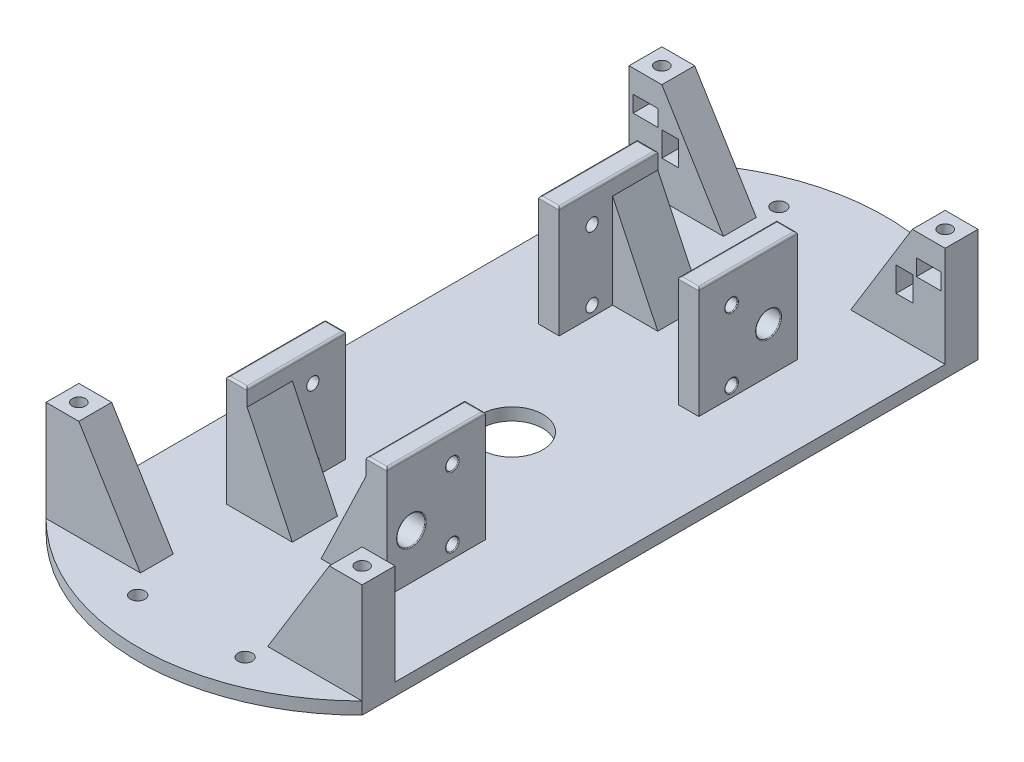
ISO-10303-21;
HEADER;
FILE_DESCRIPTION(('STEP AP214'),'2;1');
FILE_NAME('part.step','',(''),(''),'','','');
FILE_SCHEMA(('AUTOMOTIVE_DESIGN { 1 0 10303 214 1 1 1 1 }'));
ENDSEC;
DATA;
#1=APPLICATION_CONTEXT('core data for automotive mechanical design processes');
#2=APPLICATION_PROTOCOL_DEFINITION('international standard','automotive_design',2000,#1);
#3=PRODUCT_CONTEXT('',#1,'mechanical');
#4=PRODUCT('Part','Part','',(#3));
#5=PRODUCT_RELATED_PRODUCT_CATEGORY('part','',(#4));
#6=PRODUCT_DEFINITION_FORMATION('','',#4);
#7=PRODUCT_DEFINITION_CONTEXT('part definition',#1,'design');
#8=PRODUCT_DEFINITION('design','',#6,#7);
#9=PRODUCT_DEFINITION_SHAPE('','',#8);
#10=(LENGTH_UNIT() NAMED_UNIT(*) SI_UNIT(.MILLI.,.METRE.));
#11=(NAMED_UNIT(*) PLANE_ANGLE_UNIT() SI_UNIT($,.RADIAN.));
#12=(NAMED_UNIT(*) SI_UNIT($,.STERADIAN.) SOLID_ANGLE_UNIT());
#13=UNCERTAINTY_MEASURE_WITH_UNIT(LENGTH_MEASURE(1.E-05),#10,'distance_accuracy_value','');
#14=(GEOMETRIC_REPRESENTATION_CONTEXT(3) GLOBAL_UNCERTAINTY_ASSIGNED_CONTEXT((#13)) GLOBAL_UNIT_ASSIGNED_CONTEXT((#10,
#11,#12)) REPRESENTATION_CONTEXT('',''));
#15=CARTESIAN_POINT('',(0.,0.,0.));
#16=DIRECTION('',(0.,0.,1.));
#17=DIRECTION('',(1.,0.,0.));
#18=AXIS2_PLACEMENT_3D('',#15,#16,#17);
#19=CARTESIAN_POINT('',(0.,27.5,8.));
#20=DIRECTION('',(0.,0.,-1.));
#21=DIRECTION('',(-1.,0.,0.));
#22=AXIS2_PLACEMENT_3D('',#19,#20,#21);
#23=PLANE('',#22);
#24=DIRECTION('',(1.,0.,0.));
#25=VECTOR('',#24,1.);
#26=CARTESIAN_POINT('',(0.,3.,8.));
#27=LINE('',#26,#25);
#28=CARTESIAN_POINT('',(-23.,3.,8.));
#29=VERTEX_POINT('',#28);
#30=CARTESIAN_POINT('',(0.,3.,8.));
#31=VERTEX_POINT('',#30);
#32=EDGE_CURVE('E1200',#29,#31,#27,.T.);
#33=ORIENTED_EDGE('',*,*,#32,.T.);
#34=DIRECTION('',(0.,-1.,0.));
#35=VECTOR('',#34,1.);
#36=CARTESIAN_POINT('',(0.,27.5,8.));
#37=LINE('',#36,#35);
#38=CARTESIAN_POINT('',(0.,27.5,8.));
#39=VERTEX_POINT('',#38);
#40=EDGE_CURVE('E1208',#39,#31,#37,.T.);
#41=ORIENTED_EDGE('',*,*,#40,.F.);
#42=DIRECTION('',(1.,0.,0.));
#43=VECTOR('',#42,1.);
#44=CARTESIAN_POINT('',(0.,27.5,8.));
#45=LINE('',#44,#43);
#46=CARTESIAN_POINT('',(-8.,27.5,8.));
#47=VERTEX_POINT('',#46);
#48=EDGE_CURVE('E1206',#47,#39,#45,.T.);
#49=ORIENTED_EDGE('',*,*,#48,.F.);
#50=DIRECTION('',(0.52215385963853,0.852851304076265,0.));
#51=VECTOR('',#50,1.);
#52=CARTESIAN_POINT('',(-8.,27.5,8.));
#53=LINE('',#52,#51);
#54=EDGE_CURVE('E1127',#29,#47,#53,.T.);
#55=ORIENTED_EDGE('',*,*,#54,.F.);
#56=EDGE_LOOP('',(#33,#41,#49,#55));
#57=FACE_BOUND('',#56,.T.);
#58=DIRECTION('',(1.,0.,0.));
#59=VECTOR('',#58,1.);
#60=CARTESIAN_POINT('',(-11.938,12.,8.));
#61=LINE('',#60,#59);
#62=CARTESIAN_POINT('',(-11.938,12.,8.));
#63=VERTEX_POINT('',#62);
#64=CARTESIAN_POINT('',(-7.874,12.,8.));
#65=VERTEX_POINT('',#64);
#66=EDGE_CURVE('E737',#63,#65,#61,.T.);
#67=ORIENTED_EDGE('',*,*,#66,.F.);
#68=DIRECTION('',(0.,-1.,0.));
#69=VECTOR('',#68,1.);
#70=CARTESIAN_POINT('',(-11.938,18.,8.));
#71=LINE('',#70,#69);
#72=CARTESIAN_POINT('',(-11.938,18.,8.));
#73=VERTEX_POINT('',#72);
#74=EDGE_CURVE('E721',#73,#63,#71,.T.);
#75=ORIENTED_EDGE('',*,*,#74,.F.);
#76=DIRECTION('',(-1.,0.,0.));
#77=VECTOR('',#76,1.);
#78=CARTESIAN_POINT('',(-11.938,18.,8.));
#79=LINE('',#78,#77);
#80=CARTESIAN_POINT('',(-7.874,18.,8.));
#81=VERTEX_POINT('',#80);
#82=EDGE_CURVE('E726',#81,#73,#79,.T.);
#83=ORIENTED_EDGE('',*,*,#82,.F.);
#84=DIRECTION('',(0.,1.,0.));
#85=VECTOR('',#84,1.);
#86=CARTESIAN_POINT('',(-7.874,18.,8.));
#87=LINE('',#86,#85);
#88=EDGE_CURVE('E740',#65,#81,#87,.T.);
#89=ORIENTED_EDGE('',*,*,#88,.F.);
#90=EDGE_LOOP('',(#67,#75,#83,#89));
#91=FACE_BOUND('',#90,.T.);
#92=DIRECTION('',(0.,-1.,0.));
#93=VECTOR('',#92,1.);
#94=CARTESIAN_POINT('',(-7.,27.5,8.));
#95=LINE('',#94,#93);
#96=CARTESIAN_POINT('',(-7.,22.,8.00000000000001));
#97=VERTEX_POINT('',#96);
#98=CARTESIAN_POINT('',(-7.,18.,8.00000000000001));
#99=VERTEX_POINT('',#98);
#100=EDGE_CURVE('E664',#97,#99,#95,.T.);
#101=ORIENTED_EDGE('',*,*,#100,.F.);
#102=DIRECTION('',(-1.,0.,0.));
#103=VECTOR('',#102,1.);
#104=CARTESIAN_POINT('',(0.,22.,8.));
#105=LINE('',#104,#103);
#106=CARTESIAN_POINT('',(-0.999999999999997,22.,8.));
#107=VERTEX_POINT('',#106);
#108=EDGE_CURVE('E658',#107,#97,#105,.T.);
#109=ORIENTED_EDGE('',*,*,#108,.F.);
#110=DIRECTION('',(0.,1.,0.));
#111=VECTOR('',#110,1.);
#112=CARTESIAN_POINT('',(-0.999999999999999,27.5,8.));
#113=LINE('',#112,#111);
#114=CARTESIAN_POINT('',(-0.999999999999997,18.,8.00000000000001));
#115=VERTEX_POINT('',#114);
#116=EDGE_CURVE('E660',#115,#107,#113,.T.);
#117=ORIENTED_EDGE('',*,*,#116,.F.);
#118=DIRECTION('',(1.,0.,0.));
#119=VECTOR('',#118,1.);
#120=CARTESIAN_POINT('',(0.,18.,8.));
#121=LINE('',#120,#119);
#122=EDGE_CURVE('E662',#99,#115,#121,.T.);
#123=ORIENTED_EDGE('',*,*,#122,.F.);
#124=EDGE_LOOP('',(#101,#109,#117,#123));
#125=FACE_BOUND('',#124,.T.);
#126=ADVANCED_FACE('F36',(#57,#91,#125),#23,.F.);
#127=CARTESIAN_POINT('',(0.,27.5,142.));
#128=DIRECTION('',(0.,0.,1.));
#129=DIRECTION('',(1.,0.,0.));
#130=AXIS2_PLACEMENT_3D('',#127,#128,#129);
#131=PLANE('',#130);
#132=DIRECTION('',(-1.,0.,0.));
#133=VECTOR('',#132,1.);
#134=CARTESIAN_POINT('',(0.,3.,142.));
#135=LINE('',#134,#133);
#136=CARTESIAN_POINT('',(0.,3.,142.));
#137=VERTEX_POINT('',#136);
#138=CARTESIAN_POINT('',(-23.,3.,142.));
#139=VERTEX_POINT('',#138);
#140=EDGE_CURVE('E1151',#137,#139,#135,.T.);
#141=ORIENTED_EDGE('',*,*,#140,.T.);
#142=DIRECTION('',(-0.52215385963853,-0.852851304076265,0.));
#143=VECTOR('',#142,1.);
#144=CARTESIAN_POINT('',(-8.,27.5,142.));
#145=LINE('',#144,#143);
#146=CARTESIAN_POINT('',(-8.,27.5,142.));
#147=VERTEX_POINT('',#146);
#148=EDGE_CURVE('E1135',#147,#139,#145,.T.);
#149=ORIENTED_EDGE('',*,*,#148,.F.);
#150=DIRECTION('',(-1.,0.,0.));
#151=VECTOR('',#150,1.);
#152=CARTESIAN_POINT('',(0.,27.5,142.));
#153=LINE('',#152,#151);
#154=CARTESIAN_POINT('',(0.,27.5,142.));
#155=VERTEX_POINT('',#154);
#156=EDGE_CURVE('E1155',#155,#147,#153,.T.);
#157=ORIENTED_EDGE('',*,*,#156,.F.);
#158=DIRECTION('',(0.,-1.,0.));
#159=VECTOR('',#158,1.);
#160=CARTESIAN_POINT('',(0.,27.5,142.));
#161=LINE('',#160,#159);
#162=EDGE_CURVE('E1170',#155,#137,#161,.T.);
#163=ORIENTED_EDGE('',*,*,#162,.T.);
#164=EDGE_LOOP('',(#141,#149,#157,#163));
#165=FACE_BOUND('',#164,.T.);
#166=DIRECTION('',(-1.,0.,0.));
#167=VECTOR('',#166,1.);
#168=CARTESIAN_POINT('',(-8.,12.,142.));
#169=LINE('',#168,#167);
#170=CARTESIAN_POINT('',(-8.,12.,142.));
#171=VERTEX_POINT('',#170);
#172=CARTESIAN_POINT('',(-12.,12.,142.));
#173=VERTEX_POINT('',#172);
#174=EDGE_CURVE('E999',#171,#173,#169,.T.);
#175=ORIENTED_EDGE('',*,*,#174,.F.);
#176=DIRECTION('',(0.,-1.,0.));
#177=VECTOR('',#176,1.);
#178=CARTESIAN_POINT('',(-8.,18.,142.));
#179=LINE('',#178,#177);
#180=CARTESIAN_POINT('',(-8.,18.,142.));
#181=VERTEX_POINT('',#180);
#182=EDGE_CURVE('E976',#181,#171,#179,.T.);
#183=ORIENTED_EDGE('',*,*,#182,.F.);
#184=DIRECTION('',(1.,0.,0.));
#185=VECTOR('',#184,1.);
#186=CARTESIAN_POINT('',(-8.,18.,142.));
#187=LINE('',#186,#185);
#188=CARTESIAN_POINT('',(-12.,18.,142.));
#189=VERTEX_POINT('',#188);
#190=EDGE_CURVE('E988',#189,#181,#187,.T.);
#191=ORIENTED_EDGE('',*,*,#190,.F.);
#192=DIRECTION('',(0.,1.,0.));
#193=VECTOR('',#192,1.);
#194=CARTESIAN_POINT('',(-12.,18.,142.));
#195=LINE('',#194,#193);
#196=EDGE_CURVE('E1002',#173,#189,#195,.T.);
#197=ORIENTED_EDGE('',*,*,#196,.F.);
#198=EDGE_LOOP('',(#175,#183,#191,#197));
#199=FACE_BOUND('',#198,.T.);
#200=DIRECTION('',(0.,1.,0.));
#201=VECTOR('',#200,1.);
#202=CARTESIAN_POINT('',(-7.,27.5,142.));
#203=LINE('',#202,#201);
#204=CARTESIAN_POINT('',(-7.,18.,142.));
#205=VERTEX_POINT('',#204);
#206=CARTESIAN_POINT('',(-7.,22.,142.));
#207=VERTEX_POINT('',#206);
#208=EDGE_CURVE('E11',#205,#207,#203,.T.);
#209=ORIENTED_EDGE('',*,*,#208,.F.);
#210=DIRECTION('',(-1.,0.,0.));
#211=VECTOR('',#210,1.);
#212=CARTESIAN_POINT('',(0.,18.,142.));
#213=LINE('',#212,#211);
#214=CARTESIAN_POINT('',(-0.999999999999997,18.,142.));
#215=VERTEX_POINT('',#214);
#216=EDGE_CURVE('E44',#215,#205,#213,.T.);
#217=ORIENTED_EDGE('',*,*,#216,.F.);
#218=DIRECTION('',(0.,-1.,0.));
#219=VECTOR('',#218,1.);
#220=CARTESIAN_POINT('',(-0.999999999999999,27.5,142.));
#221=LINE('',#220,#219);
#222=CARTESIAN_POINT('',(-0.999999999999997,22.,142.));
#223=VERTEX_POINT('',#222);
#224=EDGE_CURVE('E1484',#223,#215,#221,.T.);
#225=ORIENTED_EDGE('',*,*,#224,.F.);
#226=DIRECTION('',(1.,0.,0.));
#227=VECTOR('',#226,1.);
#228=CARTESIAN_POINT('',(0.,22.,142.));
#229=LINE('',#228,#227);
#230=EDGE_CURVE('E656',#207,#223,#229,.T.);
#231=ORIENTED_EDGE('',*,*,#230,.F.);
#232=EDGE_LOOP('',(#209,#217,#225,#231));
#233=FACE_BOUND('',#232,.T.);
#234=ADVANCED_FACE('F1500',(#165,#199,#233),#131,.F.);
#235=CARTESIAN_POINT('',(-3.99999999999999,20.5,146.));
#236=DIRECTION('',(0.,1.,0.));
#237=DIRECTION('',(0.,0.,1.));
#238=AXIS2_PLACEMENT_3D('',#235,#236,#237);
#239=CYLINDRICAL_SURFACE('',#238,1.6);
#240=CARTESIAN_POINT('',(-3.99999999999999,27.5,146.));
#241=DIRECTION('',(0.,1.,0.));
#242=DIRECTION('',(0.,0.,1.));
#243=AXIS2_PLACEMENT_3D('',#240,#241,#242);
#244=CIRCLE('',#243,1.6);
#245=CARTESIAN_POINT('',(-3.99999999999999,27.5,147.6));
#246=VERTEX_POINT('',#245);
#247=EDGE_CURVE('E807',#246,#246,#244,.T.);
#248=ORIENTED_EDGE('',*,*,#247,.T.);
#249=EDGE_LOOP('',(#248));
#250=FACE_BOUND('',#249,.T.);
#251=CARTESIAN_POINT('',(-3.99999999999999,22.,146.));
#252=DIRECTION('',(0.,-1.,0.));
#253=DIRECTION('',(1.,0.,0.));
#254=AXIS2_PLACEMENT_3D('',#251,#252,#253);
#255=CIRCLE('',#254,1.6);
#256=CARTESIAN_POINT('',(-2.39999999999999,22.,146.));
#257=VERTEX_POINT('',#256);
#258=EDGE_CURVE('E653',#257,#257,#255,.F.);
#259=ORIENTED_EDGE('',*,*,#258,.F.);
#260=EDGE_LOOP('',(#259));
#261=FACE_BOUND('',#260,.T.);
#262=ADVANCED_FACE('F1531',(#250,#261),#239,.F.);
#263=CARTESIAN_POINT('',(-3.99999999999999,20.5,4.));
#264=DIRECTION('',(0.,1.,0.));
#265=DIRECTION('',(0.,0.,1.));
#266=AXIS2_PLACEMENT_3D('',#263,#264,#265);
#267=CYLINDRICAL_SURFACE('',#266,1.6);
#268=CARTESIAN_POINT('',(-3.99999999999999,27.5,4.));
#269=DIRECTION('',(0.,1.,0.));
#270=DIRECTION('',(0.,0.,1.));
#271=AXIS2_PLACEMENT_3D('',#268,#269,#270);
#272=CIRCLE('',#271,1.6);
#273=CARTESIAN_POINT('',(-3.99999999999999,27.5,5.6));
#274=VERTEX_POINT('',#273);
#275=EDGE_CURVE('E812',#274,#274,#272,.T.);
#276=ORIENTED_EDGE('',*,*,#275,.T.);
#277=EDGE_LOOP('',(#276));
#278=FACE_BOUND('',#277,.T.);
#279=CARTESIAN_POINT('',(-3.99999999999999,22.,4.));
#280=DIRECTION('',(0.,-1.,0.));
#281=DIRECTION('',(1.,0.,0.));
#282=AXIS2_PLACEMENT_3D('',#279,#280,#281);
#283=CIRCLE('',#282,1.6);
#284=CARTESIAN_POINT('',(-2.39999999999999,22.,4.));
#285=VERTEX_POINT('',#284);
#286=EDGE_CURVE('E652',#285,#285,#283,.F.);
#287=ORIENTED_EDGE('',*,*,#286,.F.);
#288=EDGE_LOOP('',(#287));
#289=FACE_BOUND('',#288,.T.);
#290=ADVANCED_FACE('F1556',(#278,#289),#267,.F.);
#291=CARTESIAN_POINT('',(-77.,27.5,8.));
#292=DIRECTION('',(0.,0.,-1.));
#293=DIRECTION('',(-1.,0.,0.));
#294=AXIS2_PLACEMENT_3D('',#291,#292,#293);
#295=PLANE('',#294);
#296=DIRECTION('',(1.,0.,0.));
#297=VECTOR('',#296,1.);
#298=CARTESIAN_POINT('',(-77.,3.,8.));
#299=LINE('',#298,#297);
#300=CARTESIAN_POINT('',(-77.,3.,8.));
#301=VERTEX_POINT('',#300);
#302=CARTESIAN_POINT('',(-54.,3.,8.00000000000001));
#303=VERTEX_POINT('',#302);
#304=EDGE_CURVE('E1217',#301,#303,#299,.T.);
#305=ORIENTED_EDGE('',*,*,#304,.T.);
#306=DIRECTION('',(0.52215385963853,-0.852851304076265,0.));
#307=VECTOR('',#306,1.);
#308=CARTESIAN_POINT('',(-69.,27.5,8.00000000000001));
#309=LINE('',#308,#307);
#310=CARTESIAN_POINT('',(-69.,27.5,8.00000000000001));
#311=VERTEX_POINT('',#310);
#312=EDGE_CURVE('E1118',#311,#303,#309,.T.);
#313=ORIENTED_EDGE('',*,*,#312,.F.);
#314=DIRECTION('',(1.,0.,0.));
#315=VECTOR('',#314,1.);
#316=CARTESIAN_POINT('',(-77.,27.5,8.));
#317=LINE('',#316,#315);
#318=CARTESIAN_POINT('',(-77.,27.5,8.));
#319=VERTEX_POINT('',#318);
#320=EDGE_CURVE('E1221',#319,#311,#317,.T.);
#321=ORIENTED_EDGE('',*,*,#320,.F.);
#322=DIRECTION('',(0.,-1.,0.));
#323=VECTOR('',#322,1.);
#324=CARTESIAN_POINT('',(-77.,27.5,8.));
#325=LINE('',#324,#323);
#326=EDGE_CURVE('E1236',#319,#301,#325,.T.);
#327=ORIENTED_EDGE('',*,*,#326,.T.);
#328=EDGE_LOOP('',(#305,#313,#321,#327));
#329=FACE_BOUND('',#328,.T.);
#330=DIRECTION('',(1.,0.,0.));
#331=VECTOR('',#330,1.);
#332=CARTESIAN_POINT('',(-69.,12.,8.));
#333=LINE('',#332,#331);
#334=CARTESIAN_POINT('',(-69.,12.,8.));
#335=VERTEX_POINT('',#334);
#336=CARTESIAN_POINT('',(-65.,12.,8.));
#337=VERTEX_POINT('',#336);
#338=EDGE_CURVE('E944',#335,#337,#333,.T.);
#339=ORIENTED_EDGE('',*,*,#338,.F.);
#340=DIRECTION('',(0.,-1.,0.));
#341=VECTOR('',#340,1.);
#342=CARTESIAN_POINT('',(-69.,18.,8.));
#343=LINE('',#342,#341);
#344=CARTESIAN_POINT('',(-69.,18.,8.));
#345=VERTEX_POINT('',#344);
#346=EDGE_CURVE('E922',#345,#335,#343,.T.);
#347=ORIENTED_EDGE('',*,*,#346,.F.);
#348=DIRECTION('',(-1.,0.,0.));
#349=VECTOR('',#348,1.);
#350=CARTESIAN_POINT('',(-69.,18.,8.));
#351=LINE('',#350,#349);
#352=CARTESIAN_POINT('',(-65.,18.,8.));
#353=VERTEX_POINT('',#352);
#354=EDGE_CURVE('E933',#353,#345,#351,.T.);
#355=ORIENTED_EDGE('',*,*,#354,.F.);
#356=DIRECTION('',(0.,1.,0.));
#357=VECTOR('',#356,1.);
#358=CARTESIAN_POINT('',(-65.,18.,8.));
#359=LINE('',#358,#357);
#360=EDGE_CURVE('E947',#337,#353,#359,.T.);
#361=ORIENTED_EDGE('',*,*,#360,.F.);
#362=EDGE_LOOP('',(#339,#347,#355,#361));
#363=FACE_BOUND('',#362,.T.);
#364=DIRECTION('',(0.,-1.,0.));
#365=VECTOR('',#364,1.);
#366=CARTESIAN_POINT('',(-76.,27.5,8.));
#367=LINE('',#366,#365);
#368=CARTESIAN_POINT('',(-76.,22.,8.00000000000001));
#369=VERTEX_POINT('',#368);
#370=CARTESIAN_POINT('',(-76.,18.,8.00000000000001));
#371=VERTEX_POINT('',#370);
#372=EDGE_CURVE('E719',#369,#371,#367,.T.);
#373=ORIENTED_EDGE('',*,*,#372,.F.);
#374=DIRECTION('',(-1.,0.,0.));
#375=VECTOR('',#374,1.);
#376=CARTESIAN_POINT('',(-77.,22.,8.));
#377=LINE('',#376,#375);
#378=CARTESIAN_POINT('',(-70.,22.,8.));
#379=VERTEX_POINT('',#378);
#380=EDGE_CURVE('E711',#379,#369,#377,.T.);
#381=ORIENTED_EDGE('',*,*,#380,.F.);
#382=DIRECTION('',(0.,1.,0.));
#383=VECTOR('',#382,1.);
#384=CARTESIAN_POINT('',(-70.,27.5,8.));
#385=LINE('',#384,#383);
#386=CARTESIAN_POINT('',(-70.,18.,8.00000000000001));
#387=VERTEX_POINT('',#386);
#388=EDGE_CURVE('E713',#387,#379,#385,.T.);
#389=ORIENTED_EDGE('',*,*,#388,.F.);
#390=DIRECTION('',(1.,0.,0.));
#391=VECTOR('',#390,1.);
#392=CARTESIAN_POINT('',(-77.,18.,8.));
#393=LINE('',#392,#391);
#394=EDGE_CURVE('E716',#371,#387,#393,.T.);
#395=ORIENTED_EDGE('',*,*,#394,.F.);
#396=EDGE_LOOP('',(#373,#381,#389,#395));
#397=FACE_BOUND('',#396,.T.);
#398=ADVANCED_FACE('F1552',(#329,#363,#397),#295,.F.);
#399=CARTESIAN_POINT('',(-77.,27.5,142.));
#400=DIRECTION('',(0.,0.,1.));
#401=DIRECTION('',(1.,0.,0.));
#402=AXIS2_PLACEMENT_3D('',#399,#400,#401);
#403=PLANE('',#402);
#404=DIRECTION('',(-1.,0.,0.));
#405=VECTOR('',#404,1.);
#406=CARTESIAN_POINT('',(-77.,3.,142.));
#407=LINE('',#406,#405);
#408=CARTESIAN_POINT('',(-54.,3.,142.));
#409=VERTEX_POINT('',#408);
#410=CARTESIAN_POINT('',(-77.,3.,142.));
#411=VERTEX_POINT('',#410);
#412=EDGE_CURVE('E1178',#409,#411,#407,.T.);
#413=ORIENTED_EDGE('',*,*,#412,.T.);
#414=DIRECTION('',(0.,-1.,0.));
#415=VECTOR('',#414,1.);
#416=CARTESIAN_POINT('',(-77.,27.5,142.));
#417=LINE('',#416,#415);
#418=CARTESIAN_POINT('',(-77.,27.5,142.));
#419=VERTEX_POINT('',#418);
#420=EDGE_CURVE('E1186',#419,#411,#417,.T.);
#421=ORIENTED_EDGE('',*,*,#420,.F.);
#422=DIRECTION('',(-1.,0.,0.));
#423=VECTOR('',#422,1.);
#424=CARTESIAN_POINT('',(-77.,27.5,142.));
#425=LINE('',#424,#423);
#426=CARTESIAN_POINT('',(-69.,27.5,142.));
#427=VERTEX_POINT('',#426);
#428=EDGE_CURVE('E1184',#427,#419,#425,.T.);
#429=ORIENTED_EDGE('',*,*,#428,.F.);
#430=DIRECTION('',(-0.52215385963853,0.852851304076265,0.));
#431=VECTOR('',#430,1.);
#432=CARTESIAN_POINT('',(-69.,27.5,142.));
#433=LINE('',#432,#431);
#434=EDGE_CURVE('E1144',#409,#427,#433,.T.);
#435=ORIENTED_EDGE('',*,*,#434,.F.);
#436=EDGE_LOOP('',(#413,#421,#429,#435));
#437=FACE_BOUND('',#436,.T.);
#438=DIRECTION('',(-1.,0.,0.));
#439=VECTOR('',#438,1.);
#440=CARTESIAN_POINT('',(-65.062,12.,142.));
#441=LINE('',#440,#439);
#442=CARTESIAN_POINT('',(-65.062,12.,142.));
#443=VERTEX_POINT('',#442);
#444=CARTESIAN_POINT('',(-69.126,12.,142.));
#445=VERTEX_POINT('',#444);
#446=EDGE_CURVE('E780',#443,#445,#441,.T.);
#447=ORIENTED_EDGE('',*,*,#446,.F.);
#448=DIRECTION('',(0.,-1.,0.));
#449=VECTOR('',#448,1.);
#450=CARTESIAN_POINT('',(-65.062,18.,142.));
#451=LINE('',#450,#449);
#452=CARTESIAN_POINT('',(-65.062,18.,142.));
#453=VERTEX_POINT('',#452);
#454=EDGE_CURVE('E764',#453,#443,#451,.T.);
#455=ORIENTED_EDGE('',*,*,#454,.F.);
#456=DIRECTION('',(1.,0.,0.));
#457=VECTOR('',#456,1.);
#458=CARTESIAN_POINT('',(-65.062,18.,142.));
#459=LINE('',#458,#457);
#460=CARTESIAN_POINT('',(-69.126,18.,142.));
#461=VERTEX_POINT('',#460);
#462=EDGE_CURVE('E769',#461,#453,#459,.T.);
#463=ORIENTED_EDGE('',*,*,#462,.F.);
#464=DIRECTION('',(0.,1.,0.));
#465=VECTOR('',#464,1.);
#466=CARTESIAN_POINT('',(-69.126,18.,142.));
#467=LINE('',#466,#465);
#468=EDGE_CURVE('E783',#445,#461,#467,.T.);
#469=ORIENTED_EDGE('',*,*,#468,.F.);
#470=EDGE_LOOP('',(#447,#455,#463,#469));
#471=FACE_BOUND('',#470,.T.);
#472=DIRECTION('',(0.,1.,0.));
#473=VECTOR('',#472,1.);
#474=CARTESIAN_POINT('',(-76.,27.5,142.));
#475=LINE('',#474,#473);
#476=CARTESIAN_POINT('',(-76.,18.,142.));
#477=VERTEX_POINT('',#476);
#478=CARTESIAN_POINT('',(-76.,22.,142.));
#479=VERTEX_POINT('',#478);
#480=EDGE_CURVE('E1481',#477,#479,#475,.T.);
#481=ORIENTED_EDGE('',*,*,#480,.F.);
#482=DIRECTION('',(-1.,0.,0.));
#483=VECTOR('',#482,1.);
#484=CARTESIAN_POINT('',(-77.,18.,142.));
#485=LINE('',#484,#483);
#486=CARTESIAN_POINT('',(-70.,18.,142.));
#487=VERTEX_POINT('',#486);
#488=EDGE_CURVE('E1479',#487,#477,#485,.T.);
#489=ORIENTED_EDGE('',*,*,#488,.F.);
#490=DIRECTION('',(0.,-1.,0.));
#491=VECTOR('',#490,1.);
#492=CARTESIAN_POINT('',(-70.,27.5,142.));
#493=LINE('',#492,#491);
#494=CARTESIAN_POINT('',(-70.,22.,142.));
#495=VERTEX_POINT('',#494);
#496=EDGE_CURVE('E1463',#495,#487,#493,.T.);
#497=ORIENTED_EDGE('',*,*,#496,.F.);
#498=DIRECTION('',(1.,0.,0.));
#499=VECTOR('',#498,1.);
#500=CARTESIAN_POINT('',(-77.,22.,142.));
#501=LINE('',#500,#499);
#502=EDGE_CURVE('E709',#479,#495,#501,.T.);
#503=ORIENTED_EDGE('',*,*,#502,.F.);
#504=EDGE_LOOP('',(#481,#489,#497,#503));
#505=FACE_BOUND('',#504,.T.);
#506=ADVANCED_FACE('F1555',(#437,#471,#505),#403,.F.);
#507=CARTESIAN_POINT('',(-73.,20.5,4.));
#508=DIRECTION('',(0.,1.,0.));
#509=DIRECTION('',(0.,0.,1.));
#510=AXIS2_PLACEMENT_3D('',#507,#508,#509);
#511=CYLINDRICAL_SURFACE('',#510,1.60000000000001);
#512=CARTESIAN_POINT('',(-73.,27.5,4.));
#513=DIRECTION('',(0.,1.,0.));
#514=DIRECTION('',(0.,0.,1.));
#515=AXIS2_PLACEMENT_3D('',#512,#513,#514);
#516=CIRCLE('',#515,1.60000000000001);
#517=CARTESIAN_POINT('',(-73.,27.5,5.60000000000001));
#518=VERTEX_POINT('',#517);
#519=EDGE_CURVE('E811',#518,#518,#516,.T.);
#520=ORIENTED_EDGE('',*,*,#519,.T.);
#521=EDGE_LOOP('',(#520));
#522=FACE_BOUND('',#521,.T.);
#523=CARTESIAN_POINT('',(-73.,22.,4.));
#524=DIRECTION('',(0.,-1.,0.));
#525=DIRECTION('',(1.,0.,0.));
#526=AXIS2_PLACEMENT_3D('',#523,#524,#525);
#527=CIRCLE('',#526,1.60000000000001);
#528=CARTESIAN_POINT('',(-71.4,22.,4.));
#529=VERTEX_POINT('',#528);
#530=EDGE_CURVE('E706',#529,#529,#527,.F.);
#531=ORIENTED_EDGE('',*,*,#530,.F.);
#532=EDGE_LOOP('',(#531));
#533=FACE_BOUND('',#532,.T.);
#534=ADVANCED_FACE('F1775',(#522,#533),#511,.F.);
#535=CARTESIAN_POINT('',(-73.,20.5,146.));
#536=DIRECTION('',(0.,1.,0.));
#537=DIRECTION('',(0.,0.,1.));
#538=AXIS2_PLACEMENT_3D('',#535,#536,#537);
#539=CYLINDRICAL_SURFACE('',#538,1.6);
#540=CARTESIAN_POINT('',(-73.,27.5,146.));
#541=DIRECTION('',(0.,1.,0.));
#542=DIRECTION('',(0.,0.,1.));
#543=AXIS2_PLACEMENT_3D('',#540,#541,#542);
#544=CIRCLE('',#543,1.6);
#545=CARTESIAN_POINT('',(-73.,27.5,147.6));
#546=VERTEX_POINT('',#545);
#547=EDGE_CURVE('E808',#546,#546,#544,.T.);
#548=ORIENTED_EDGE('',*,*,#547,.T.);
#549=EDGE_LOOP('',(#548));
#550=FACE_BOUND('',#549,.T.);
#551=CARTESIAN_POINT('',(-73.,22.,146.));
#552=DIRECTION('',(0.,-1.,0.));
#553=DIRECTION('',(1.,0.,0.));
#554=AXIS2_PLACEMENT_3D('',#551,#552,#553);
#555=CIRCLE('',#554,1.6);
#556=CARTESIAN_POINT('',(-71.4,22.,146.));
#557=VERTEX_POINT('',#556);
#558=EDGE_CURVE('E705',#557,#557,#555,.F.);
#559=ORIENTED_EDGE('',*,*,#558,.F.);
#560=EDGE_LOOP('',(#559));
#561=FACE_BOUND('',#560,.T.);
#562=ADVANCED_FACE('F1562',(#550,#561),#539,.F.);
#563=CARTESIAN_POINT('',(-38.5,3.,38.5000000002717));
#564=DIRECTION('',(0.,-1.,0.));
#565=DIRECTION('',(0.,0.,-1.));
#566=AXIS2_PLACEMENT_3D('',#563,#564,#565);
#567=PLANE('',#566);
#568=CARTESIAN_POINT('',(-53.5,3.,-5.));
#569=DIRECTION('',(0.,1.,0.));
#570=DIRECTION('',(0.,0.,1.));
#571=AXIS2_PLACEMENT_3D('',#568,#569,#570);
#572=CIRCLE('',#571,1.75);
#573=CARTESIAN_POINT('',(-53.5,3.,-3.25));
#574=VERTEX_POINT('',#573);
#575=EDGE_CURVE('E820',#574,#574,#572,.T.);
#576=ORIENTED_EDGE('',*,*,#575,.F.);
#577=EDGE_LOOP('',(#576));
#578=FACE_BOUND('',#577,.T.);
#579=CARTESIAN_POINT('',(-23.5,3.,-5.));
#580=DIRECTION('',(0.,1.,0.));
#581=DIRECTION('',(0.,0.,1.));
#582=AXIS2_PLACEMENT_3D('',#579,#580,#581);
#583=CIRCLE('',#582,1.75);
#584=CARTESIAN_POINT('',(-23.5,3.,-3.25));
#585=VERTEX_POINT('',#584);
#586=EDGE_CURVE('E824',#585,#585,#583,.T.);
#587=ORIENTED_EDGE('',*,*,#586,.F.);
#588=EDGE_LOOP('',(#587));
#589=FACE_BOUND('',#588,.T.);
#590=CARTESIAN_POINT('',(-49.6665152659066,3.,155.));
#591=DIRECTION('',(0.,1.,0.));
#592=DIRECTION('',(0.,0.,1.));
#593=AXIS2_PLACEMENT_3D('',#590,#591,#592);
#594=CIRCLE('',#593,1.75);
#595=CARTESIAN_POINT('',(-49.6665152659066,3.,156.75));
#596=VERTEX_POINT('',#595);
#597=EDGE_CURVE('E827',#596,#596,#594,.T.);
#598=ORIENTED_EDGE('',*,*,#597,.F.);
#599=EDGE_LOOP('',(#598));
#600=FACE_BOUND('',#599,.T.);
#601=CARTESIAN_POINT('',(-23.5,3.,155.));
#602=DIRECTION('',(0.,1.,0.));
#603=DIRECTION('',(0.,0.,1.));
#604=AXIS2_PLACEMENT_3D('',#601,#602,#603);
#605=CIRCLE('',#604,1.75);
#606=CARTESIAN_POINT('',(-23.5,3.,156.75));
#607=VERTEX_POINT('',#606);
#608=EDGE_CURVE('E819',#607,#607,#605,.T.);
#609=ORIENTED_EDGE('',*,*,#608,.F.);
#610=EDGE_LOOP('',(#609));
#611=FACE_BOUND('',#610,.T.);
#612=CARTESIAN_POINT('',(-38.5,3.,75.0000000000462));
#613=DIRECTION('',(0.,1.,0.));
#614=DIRECTION('',(0.,0.,1.));
#615=AXIS2_PLACEMENT_3D('',#612,#613,#614);
#616=CIRCLE('',#615,7.5);
#617=CARTESIAN_POINT('',(-38.5,3.,82.5000000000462));
#618=VERTEX_POINT('',#617);
#619=EDGE_CURVE('E832',#618,#618,#616,.T.);
#620=ORIENTED_EDGE('',*,*,#619,.F.);
#621=EDGE_LOOP('',(#620));
#622=FACE_BOUND('',#621,.T.);
#623=DIRECTION('',(-1.,0.,0.));
#624=VECTOR('',#623,1.);
#625=CARTESIAN_POINT('',(-35.0000000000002,3.,36.));
#626=LINE('',#625,#624);
#627=CARTESIAN_POINT('',(-24.,3.,36.));
#628=VERTEX_POINT('',#627);
#629=CARTESIAN_POINT('',(-35.0000000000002,3.,36.));
#630=VERTEX_POINT('',#629);
#631=EDGE_CURVE('E859',#628,#630,#626,.T.);
#632=ORIENTED_EDGE('',*,*,#631,.T.);
#633=DIRECTION('',(0.,0.,-1.));
#634=VECTOR('',#633,1.);
#635=CARTESIAN_POINT('',(-35.0000000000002,3.,36.));
#636=LINE('',#635,#634);
#637=CARTESIAN_POINT('',(-35.0000000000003,3.,25.));
#638=VERTEX_POINT('',#637);
#639=EDGE_CURVE('E864',#630,#638,#636,.T.);
#640=ORIENTED_EDGE('',*,*,#639,.T.);
#641=DIRECTION('',(-1.,0.,0.));
#642=VECTOR('',#641,1.);
#643=CARTESIAN_POINT('',(-19.,3.,25.));
#644=LINE('',#643,#642);
#645=CARTESIAN_POINT('',(-19.,3.,25.));
#646=VERTEX_POINT('',#645);
#647=EDGE_CURVE('E1081',#646,#638,#644,.T.);
#648=ORIENTED_EDGE('',*,*,#647,.F.);
#649=DIRECTION('',(0.,0.,-1.));
#650=VECTOR('',#649,1.);
#651=CARTESIAN_POINT('',(-19.,3.,25.));
#652=LINE('',#651,#650);
#653=CARTESIAN_POINT('',(-19.,3.,49.));
#654=VERTEX_POINT('',#653);
#655=EDGE_CURVE('E1078',#654,#646,#652,.T.);
#656=ORIENTED_EDGE('',*,*,#655,.F.);
#657=DIRECTION('',(1.,0.,0.));
#658=VECTOR('',#657,1.);
#659=CARTESIAN_POINT('',(-19.,3.,49.));
#660=LINE('',#659,#658);
#661=CARTESIAN_POINT('',(-24.,3.,49.));
#662=VERTEX_POINT('',#661);
#663=EDGE_CURVE('E1086',#662,#654,#660,.T.);
#664=ORIENTED_EDGE('',*,*,#663,.F.);
#665=DIRECTION('',(0.,0.,1.));
#666=VECTOR('',#665,1.);
#667=CARTESIAN_POINT('',(-24.,3.,25.));
#668=LINE('',#667,#666);
#669=EDGE_CURVE('E1083',#628,#662,#668,.T.);
#670=ORIENTED_EDGE('',*,*,#669,.F.);
#671=EDGE_LOOP('',(#632,#640,#648,#656,#664,#670));
#672=FACE_BOUND('',#671,.T.);
#673=DIRECTION('',(0.,0.,-1.));
#674=VECTOR('',#673,1.);
#675=CARTESIAN_POINT('',(-53.,3.,101.));
#676=LINE('',#675,#674);
#677=CARTESIAN_POINT('',(-53.,3.,114.));
#678=VERTEX_POINT('',#677);
#679=CARTESIAN_POINT('',(-53.,3.,101.));
#680=VERTEX_POINT('',#679);
#681=EDGE_CURVE('E1064',#678,#680,#676,.T.);
#682=ORIENTED_EDGE('',*,*,#681,.F.);
#683=DIRECTION('',(1.,0.,0.));
#684=VECTOR('',#683,1.);
#685=CARTESIAN_POINT('',(-53.,3.,114.));
#686=LINE('',#685,#684);
#687=CARTESIAN_POINT('',(-42.,3.,114.));
#688=VERTEX_POINT('',#687);
#689=EDGE_CURVE('E890',#678,#688,#686,.T.);
#690=ORIENTED_EDGE('',*,*,#689,.T.);
#691=DIRECTION('',(0.,0.,1.));
#692=VECTOR('',#691,1.);
#693=CARTESIAN_POINT('',(-42.,3.,114.));
#694=LINE('',#693,#692);
#695=CARTESIAN_POINT('',(-42.,3.,125.));
#696=VERTEX_POINT('',#695);
#697=EDGE_CURVE('E897',#688,#696,#694,.T.);
#698=ORIENTED_EDGE('',*,*,#697,.T.);
#699=DIRECTION('',(1.,0.,0.));
#700=VECTOR('',#699,1.);
#701=CARTESIAN_POINT('',(-58.,3.,125.));
#702=LINE('',#701,#700);
#703=CARTESIAN_POINT('',(-58.,3.,125.));
#704=VERTEX_POINT('',#703);
#705=EDGE_CURVE('E1062',#704,#696,#702,.T.);
#706=ORIENTED_EDGE('',*,*,#705,.F.);
#707=DIRECTION('',(0.,0.,1.));
#708=VECTOR('',#707,1.);
#709=CARTESIAN_POINT('',(-58.,3.,101.));
#710=LINE('',#709,#708);
#711=CARTESIAN_POINT('',(-58.,3.,101.));
#712=VERTEX_POINT('',#711);
#713=EDGE_CURVE('E1059',#712,#704,#710,.T.);
#714=ORIENTED_EDGE('',*,*,#713,.F.);
#715=DIRECTION('',(-1.,0.,0.));
#716=VECTOR('',#715,1.);
#717=CARTESIAN_POINT('',(-58.,3.,101.));
#718=LINE('',#717,#716);
#719=EDGE_CURVE('E1067',#680,#712,#718,.T.);
#720=ORIENTED_EDGE('',*,*,#719,.F.);
#721=EDGE_LOOP('',(#682,#690,#698,#706,#714,#720));
#722=FACE_BOUND('',#721,.T.);
#723=DIRECTION('',(0.,0.,-1.));
#724=VECTOR('',#723,1.);
#725=CARTESIAN_POINT('',(-54.,3.,8.00000000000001));
#726=LINE('',#725,#724);
#727=CARTESIAN_POINT('',(-54.,3.,0.));
#728=VERTEX_POINT('',#727);
#729=EDGE_CURVE('E1121',#303,#728,#726,.T.);
#730=ORIENTED_EDGE('',*,*,#729,.F.);
#731=ORIENTED_EDGE('',*,*,#304,.F.);
#732=DIRECTION('',(0.,0.,1.));
#733=VECTOR('',#732,1.);
#734=CARTESIAN_POINT('',(-77.,3.,0.));
#735=LINE('',#734,#733);
#736=EDGE_CURVE('E1242',#301,#411,#735,.T.);
#737=ORIENTED_EDGE('',*,*,#736,.T.);
#738=ORIENTED_EDGE('',*,*,#412,.F.);
#739=DIRECTION('',(0.,0.,1.));
#740=VECTOR('',#739,1.);
#741=CARTESIAN_POINT('',(-54.,3.,142.));
#742=LINE('',#741,#740);
#743=CARTESIAN_POINT('',(-54.,3.,150.));
#744=VERTEX_POINT('',#743);
#745=EDGE_CURVE('E1146',#409,#744,#742,.T.);
#746=ORIENTED_EDGE('',*,*,#745,.T.);
#747=DIRECTION('',(1.,0.,0.));
#748=VECTOR('',#747,1.);
#749=CARTESIAN_POINT('',(-77.,3.,150.));
#750=LINE('',#749,#748);
#751=CARTESIAN_POINT('',(-77.,3.,150.));
#752=VERTEX_POINT('',#751);
#753=EDGE_CURVE('E1173',#752,#744,#750,.T.);
#754=ORIENTED_EDGE('',*,*,#753,.F.);
#755=CARTESIAN_POINT('',(-38.5,3.,111.500000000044));
#756=DIRECTION('',(0.,1.,0.));
#757=DIRECTION('',(0.,0.,-1.));
#758=AXIS2_PLACEMENT_3D('',#755,#756,#757);
#759=CIRCLE('',#758,54.4472221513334);
#760=CARTESIAN_POINT('',(0.,3.,150.));
#761=VERTEX_POINT('',#760);
#762=EDGE_CURVE('E1245',#752,#761,#759,.T.);
#763=ORIENTED_EDGE('',*,*,#762,.T.);
#764=DIRECTION('',(1.,0.,0.));
#765=VECTOR('',#764,1.);
#766=CARTESIAN_POINT('',(0.,3.,150.));
#767=LINE('',#766,#765);
#768=CARTESIAN_POINT('',(-23.,3.,150.));
#769=VERTEX_POINT('',#768);
#770=EDGE_CURVE('E1156',#769,#761,#767,.T.);
#771=ORIENTED_EDGE('',*,*,#770,.F.);
#772=DIRECTION('',(0.,0.,1.));
#773=VECTOR('',#772,1.);
#774=CARTESIAN_POINT('',(-23.,3.,142.));
#775=LINE('',#774,#773);
#776=EDGE_CURVE('E1138',#139,#769,#775,.T.);
#777=ORIENTED_EDGE('',*,*,#776,.F.);
#778=ORIENTED_EDGE('',*,*,#140,.F.);
#779=DIRECTION('',(0.,0.,-1.));
#780=VECTOR('',#779,1.);
#781=CARTESIAN_POINT('',(0.,3.,0.));
#782=LINE('',#781,#780);
#783=EDGE_CURVE('E1247',#137,#31,#782,.T.);
#784=ORIENTED_EDGE('',*,*,#783,.T.);
#785=ORIENTED_EDGE('',*,*,#32,.F.);
#786=DIRECTION('',(0.,0.,-1.));
#787=VECTOR('',#786,1.);
#788=CARTESIAN_POINT('',(-23.,3.,8.));
#789=LINE('',#788,#787);
#790=CARTESIAN_POINT('',(-23.,3.,0.));
#791=VERTEX_POINT('',#790);
#792=EDGE_CURVE('E1129',#29,#791,#789,.T.);
#793=ORIENTED_EDGE('',*,*,#792,.T.);
#794=DIRECTION('',(-1.,0.,0.));
#795=VECTOR('',#794,1.);
#796=CARTESIAN_POINT('',(0.,3.,0.));
#797=LINE('',#796,#795);
#798=CARTESIAN_POINT('',(0.,3.,0.));
#799=VERTEX_POINT('',#798);
#800=EDGE_CURVE('E1195',#799,#791,#797,.T.);
#801=ORIENTED_EDGE('',*,*,#800,.F.);
#802=CARTESIAN_POINT('',(-38.5,3.,38.5000000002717));
#803=DIRECTION('',(0.,1.,0.));
#804=DIRECTION('',(0.,0.,-1.));
#805=AXIS2_PLACEMENT_3D('',#802,#803,#804);
#806=CIRCLE('',#805,54.4472221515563);
#807=CARTESIAN_POINT('',(-77.,3.,0.));
#808=VERTEX_POINT('',#807);
#809=EDGE_CURVE('E1240',#799,#808,#806,.T.);
#810=ORIENTED_EDGE('',*,*,#809,.T.);
#811=DIRECTION('',(-1.,0.,0.));
#812=VECTOR('',#811,1.);
#813=CARTESIAN_POINT('',(-77.,3.,0.));
#814=LINE('',#813,#812);
#815=EDGE_CURVE('E1222',#728,#808,#814,.T.);
#816=ORIENTED_EDGE('',*,*,#815,.F.);
#817=EDGE_LOOP('',(#730,#731,#737,#738,#746,#754,#763,#771,#777,#778,#784,#785,#793,#801,#810,#816));
#818=FACE_BOUND('',#817,.T.);
#819=DIRECTION('',(0.,0.,1.));
#820=VECTOR('',#819,1.);
#821=CARTESIAN_POINT('',(-35.,3.,114.));
#822=LINE('',#821,#820);
#823=CARTESIAN_POINT('',(-35.,3.,114.));
#824=VERTEX_POINT('',#823);
#825=CARTESIAN_POINT('',(-35.,3.,125.));
#826=VERTEX_POINT('',#825);
#827=EDGE_CURVE('E884',#824,#826,#822,.T.);
#828=ORIENTED_EDGE('',*,*,#827,.F.);
#829=DIRECTION('',(1.,0.,0.));
#830=VECTOR('',#829,1.);
#831=CARTESIAN_POINT('',(-35.,3.,114.));
#832=LINE('',#831,#830);
#833=CARTESIAN_POINT('',(-24.,3.,114.));
#834=VERTEX_POINT('',#833);
#835=EDGE_CURVE('E878',#824,#834,#832,.T.);
#836=ORIENTED_EDGE('',*,*,#835,.T.);
#837=DIRECTION('',(0.,0.,1.));
#838=VECTOR('',#837,1.);
#839=CARTESIAN_POINT('',(-24.,3.,101.));
#840=LINE('',#839,#838);
#841=CARTESIAN_POINT('',(-24.,3.,101.));
#842=VERTEX_POINT('',#841);
#843=EDGE_CURVE('E1045',#842,#834,#840,.T.);
#844=ORIENTED_EDGE('',*,*,#843,.F.);
#845=DIRECTION('',(-1.,0.,0.));
#846=VECTOR('',#845,1.);
#847=CARTESIAN_POINT('',(-19.,3.,101.));
#848=LINE('',#847,#846);
#849=CARTESIAN_POINT('',(-19.,3.,101.));
#850=VERTEX_POINT('',#849);
#851=EDGE_CURVE('E1042',#850,#842,#848,.T.);
#852=ORIENTED_EDGE('',*,*,#851,.F.);
#853=DIRECTION('',(0.,0.,-1.));
#854=VECTOR('',#853,1.);
#855=CARTESIAN_POINT('',(-19.,3.,101.));
#856=LINE('',#855,#854);
#857=CARTESIAN_POINT('',(-19.,3.,125.));
#858=VERTEX_POINT('',#857);
#859=EDGE_CURVE('E1039',#858,#850,#856,.T.);
#860=ORIENTED_EDGE('',*,*,#859,.F.);
#861=DIRECTION('',(1.,0.,0.));
#862=VECTOR('',#861,1.);
#863=CARTESIAN_POINT('',(-19.,3.,125.));
#864=LINE('',#863,#862);
#865=EDGE_CURVE('E1048',#826,#858,#864,.T.);
#866=ORIENTED_EDGE('',*,*,#865,.F.);
#867=EDGE_LOOP('',(#828,#836,#844,#852,#860,#866));
#868=FACE_BOUND('',#867,.T.);
#869=DIRECTION('',(-1.,0.,0.));
#870=VECTOR('',#869,1.);
#871=CARTESIAN_POINT('',(-53.,3.,36.0000000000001));
#872=LINE('',#871,#870);
#873=CARTESIAN_POINT('',(-42.0000000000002,3.,36.0000000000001));
#874=VERTEX_POINT('',#873);
#875=CARTESIAN_POINT('',(-53.,3.,36.0000000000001));
#876=VERTEX_POINT('',#875);
#877=EDGE_CURVE('E840',#874,#876,#872,.T.);
#878=ORIENTED_EDGE('',*,*,#877,.T.);
#879=DIRECTION('',(0.,0.,-1.));
#880=VECTOR('',#879,1.);
#881=CARTESIAN_POINT('',(-53.,3.,25.));
#882=LINE('',#881,#880);
#883=CARTESIAN_POINT('',(-53.,3.,49.));
#884=VERTEX_POINT('',#883);
#885=EDGE_CURVE('E1103',#884,#876,#882,.T.);
#886=ORIENTED_EDGE('',*,*,#885,.F.);
#887=DIRECTION('',(1.,0.,0.));
#888=VECTOR('',#887,1.);
#889=CARTESIAN_POINT('',(-58.,3.,49.));
#890=LINE('',#889,#888);
#891=CARTESIAN_POINT('',(-58.,3.,49.));
#892=VERTEX_POINT('',#891);
#893=EDGE_CURVE('E1100',#892,#884,#890,.T.);
#894=ORIENTED_EDGE('',*,*,#893,.F.);
#895=DIRECTION('',(0.,0.,1.));
#896=VECTOR('',#895,1.);
#897=CARTESIAN_POINT('',(-58.,3.,25.));
#898=LINE('',#897,#896);
#899=CARTESIAN_POINT('',(-58.,3.,25.));
#900=VERTEX_POINT('',#899);
#901=EDGE_CURVE('E1097',#900,#892,#898,.T.);
#902=ORIENTED_EDGE('',*,*,#901,.F.);
#903=DIRECTION('',(-1.,0.,0.));
#904=VECTOR('',#903,1.);
#905=CARTESIAN_POINT('',(-58.,3.,25.));
#906=LINE('',#905,#904);
#907=CARTESIAN_POINT('',(-42.0000000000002,3.,25.0000000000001));
#908=VERTEX_POINT('',#907);
#909=EDGE_CURVE('E1106',#908,#900,#906,.T.);
#910=ORIENTED_EDGE('',*,*,#909,.F.);
#911=DIRECTION('',(0.,0.,-1.));
#912=VECTOR('',#911,1.);
#913=CARTESIAN_POINT('',(-42.0000000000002,3.,36.0000000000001));
#914=LINE('',#913,#912);
#915=EDGE_CURVE('E847',#874,#908,#914,.T.);
#916=ORIENTED_EDGE('',*,*,#915,.F.);
#917=EDGE_LOOP('',(#878,#886,#894,#902,#910,#916));
#918=FACE_BOUND('',#917,.T.);
#919=ADVANCED_FACE('F1558',(#578,#589,#600,#611,#622,#672,#722,#818,#868,#918),#567,.F.);
#920=CARTESIAN_POINT('',(-38.5,3.,38.5000000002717));
#921=DIRECTION('',(0.,-1.,0.));
#922=DIRECTION('',(0.,0.,-1.));
#923=AXIS2_PLACEMENT_3D('',#920,#921,#922);
#924=CYLINDRICAL_SURFACE('',#923,54.4472221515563);
#925=CARTESIAN_POINT('',(-38.5,0.,38.5000000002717));
#926=DIRECTION('',(0.,1.,0.));
#927=DIRECTION('',(0.,0.,-1.));
#928=AXIS2_PLACEMENT_3D('',#925,#926,#927);
#929=CIRCLE('',#928,54.4472221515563);
#930=CARTESIAN_POINT('',(0.,0.,0.));
#931=VERTEX_POINT('',#930);
#932=CARTESIAN_POINT('',(-77.,0.,0.));
#933=VERTEX_POINT('',#932);
#934=EDGE_CURVE('E1239',#931,#933,#929,.T.);
#935=ORIENTED_EDGE('',*,*,#934,.T.);
#936=DIRECTION('',(0.,-1.,0.));
#937=VECTOR('',#936,1.);
#938=CARTESIAN_POINT('',(-77.,3.,0.));
#939=LINE('',#938,#937);
#940=EDGE_CURVE('E1265',#808,#933,#939,.T.);
#941=ORIENTED_EDGE('',*,*,#940,.F.);
#942=ORIENTED_EDGE('',*,*,#809,.F.);
#943=DIRECTION('',(0.,-1.,0.));
#944=VECTOR('',#943,1.);
#945=CARTESIAN_POINT('',(0.,3.,0.));
#946=LINE('',#945,#944);
#947=EDGE_CURVE('E1249',#799,#931,#946,.T.);
#948=ORIENTED_EDGE('',*,*,#947,.T.);
#949=EDGE_LOOP('',(#935,#941,#942,#948));
#950=FACE_BOUND('',#949,.T.);
#951=ADVANCED_FACE('F1561',(#950),#924,.T.);
#952=CARTESIAN_POINT('',(-77.,3.,0.));
#953=DIRECTION('',(1.,0.,0.));
#954=DIRECTION('',(0.,0.,-1.));
#955=AXIS2_PLACEMENT_3D('',#952,#953,#954);
#956=PLANE('',#955);
#957=DIRECTION('',(0.,0.,1.));
#958=VECTOR('',#957,1.);
#959=CARTESIAN_POINT('',(-77.,0.,0.));
#960=LINE('',#959,#958);
#961=CARTESIAN_POINT('',(-77.,0.,150.));
#962=VERTEX_POINT('',#961);
#963=EDGE_CURVE('E1252',#933,#962,#960,.T.);
#964=ORIENTED_EDGE('',*,*,#963,.T.);
#965=DIRECTION('',(0.,-1.,0.));
#966=VECTOR('',#965,1.);
#967=CARTESIAN_POINT('',(-77.,3.,150.));
#968=LINE('',#967,#966);
#969=EDGE_CURVE('E1262',#752,#962,#968,.T.);
#970=ORIENTED_EDGE('',*,*,#969,.F.);
#971=DIRECTION('',(0.,-1.,0.));
#972=VECTOR('',#971,1.);
#973=CARTESIAN_POINT('',(-77.,27.5,150.));
#974=LINE('',#973,#972);
#975=CARTESIAN_POINT('',(-77.,27.5,150.));
#976=VERTEX_POINT('',#975);
#977=EDGE_CURVE('E1192',#976,#752,#974,.T.);
#978=ORIENTED_EDGE('',*,*,#977,.F.);
#979=DIRECTION('',(0.,0.,1.));
#980=VECTOR('',#979,1.);
#981=CARTESIAN_POINT('',(-77.,27.5,150.));
#982=LINE('',#981,#980);
#983=EDGE_CURVE('E1174',#419,#976,#982,.T.);
#984=ORIENTED_EDGE('',*,*,#983,.F.);
#985=ORIENTED_EDGE('',*,*,#420,.T.);
#986=ORIENTED_EDGE('',*,*,#736,.F.);
#987=ORIENTED_EDGE('',*,*,#326,.F.);
#988=DIRECTION('',(0.,0.,1.));
#989=VECTOR('',#988,1.);
#990=CARTESIAN_POINT('',(-77.,27.5,0.));
#991=LINE('',#990,#989);
#992=CARTESIAN_POINT('',(-77.,27.5,0.));
#993=VERTEX_POINT('',#992);
#994=EDGE_CURVE('E1218',#993,#319,#991,.T.);
#995=ORIENTED_EDGE('',*,*,#994,.F.);
#996=DIRECTION('',(0.,-1.,0.));
#997=VECTOR('',#996,1.);
#998=CARTESIAN_POINT('',(-77.,27.5,0.));
#999=LINE('',#998,#997);
#1000=EDGE_CURVE('E1230',#993,#808,#999,.T.);
#1001=ORIENTED_EDGE('',*,*,#1000,.T.);
#1002=ORIENTED_EDGE('',*,*,#940,.T.);
#1003=EDGE_LOOP('',(#964,#970,#978,#984,#985,#986,#987,#995,#1001,#1002));
#1004=FACE_BOUND('',#1003,.T.);
#1005=ADVANCED_FACE('F1574',(#1004),#956,.F.);
#1006=CARTESIAN_POINT('',(-38.5,3.,111.500000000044));
#1007=DIRECTION('',(0.,-1.,0.));
#1008=DIRECTION('',(0.,0.,-1.));
#1009=AXIS2_PLACEMENT_3D('',#1006,#1007,#1008);
#1010=CYLINDRICAL_SURFACE('',#1009,54.4472221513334);
#1011=CARTESIAN_POINT('',(-38.5,0.,111.500000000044));
#1012=DIRECTION('',(0.,1.,0.));
#1013=DIRECTION('',(0.,0.,-1.));
#1014=AXIS2_PLACEMENT_3D('',#1011,#1012,#1013);
#1015=CIRCLE('',#1014,54.4472221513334);
#1016=CARTESIAN_POINT('',(0.,0.,150.));
#1017=VERTEX_POINT('',#1016);
#1018=EDGE_CURVE('E1254',#962,#1017,#1015,.T.);
#1019=ORIENTED_EDGE('',*,*,#1018,.T.);
#1020=DIRECTION('',(0.,-1.,0.));
#1021=VECTOR('',#1020,1.);
#1022=CARTESIAN_POINT('',(0.,3.,150.));
#1023=LINE('',#1022,#1021);
#1024=EDGE_CURVE('E1259',#761,#1017,#1023,.T.);
#1025=ORIENTED_EDGE('',*,*,#1024,.F.);
#1026=ORIENTED_EDGE('',*,*,#762,.F.);
#1027=ORIENTED_EDGE('',*,*,#969,.T.);
#1028=EDGE_LOOP('',(#1019,#1025,#1026,#1027));
#1029=FACE_BOUND('',#1028,.T.);
#1030=ADVANCED_FACE('F1570',(#1029),#1010,.T.);
#1031=CARTESIAN_POINT('',(0.,3.,0.));
#1032=DIRECTION('',(-1.,0.,0.));
#1033=DIRECTION('',(0.,0.,1.));
#1034=AXIS2_PLACEMENT_3D('',#1031,#1032,#1033);
#1035=PLANE('',#1034);
#1036=DIRECTION('',(0.,0.,-1.));
#1037=VECTOR('',#1036,1.);
#1038=CARTESIAN_POINT('',(0.,0.,0.));
#1039=LINE('',#1038,#1037);
#1040=EDGE_CURVE('E1243',#1017,#931,#1039,.T.);
#1041=ORIENTED_EDGE('',*,*,#1040,.T.);
#1042=ORIENTED_EDGE('',*,*,#947,.F.);
#1043=DIRECTION('',(0.,-1.,0.));
#1044=VECTOR('',#1043,1.);
#1045=CARTESIAN_POINT('',(0.,27.5,0.));
#1046=LINE('',#1045,#1044);
#1047=CARTESIAN_POINT('',(0.,27.5,0.));
#1048=VERTEX_POINT('',#1047);
#1049=EDGE_CURVE('E1214',#1048,#799,#1046,.T.);
#1050=ORIENTED_EDGE('',*,*,#1049,.F.);
#1051=DIRECTION('',(0.,0.,-1.));
#1052=VECTOR('',#1051,1.);
#1053=CARTESIAN_POINT('',(0.,27.5,0.));
#1054=LINE('',#1053,#1052);
#1055=EDGE_CURVE('E1196',#39,#1048,#1054,.T.);
#1056=ORIENTED_EDGE('',*,*,#1055,.F.);
#1057=ORIENTED_EDGE('',*,*,#40,.T.);
#1058=ORIENTED_EDGE('',*,*,#783,.F.);
#1059=ORIENTED_EDGE('',*,*,#162,.F.);
#1060=DIRECTION('',(0.,0.,-1.));
#1061=VECTOR('',#1060,1.);
#1062=CARTESIAN_POINT('',(0.,27.5,150.));
#1063=LINE('',#1062,#1061);
#1064=CARTESIAN_POINT('',(0.,27.5,150.));
#1065=VERTEX_POINT('',#1064);
#1066=EDGE_CURVE('E1152',#1065,#155,#1063,.T.);
#1067=ORIENTED_EDGE('',*,*,#1066,.F.);
#1068=DIRECTION('',(0.,-1.,0.));
#1069=VECTOR('',#1068,1.);
#1070=CARTESIAN_POINT('',(0.,27.5,150.));
#1071=LINE('',#1070,#1069);
#1072=EDGE_CURVE('E1164',#1065,#761,#1071,.T.);
#1073=ORIENTED_EDGE('',*,*,#1072,.T.);
#1074=ORIENTED_EDGE('',*,*,#1024,.T.);
#1075=EDGE_LOOP('',(#1041,#1042,#1050,#1056,#1057,#1058,#1059,#1067,#1073,#1074));
#1076=FACE_BOUND('',#1075,.T.);
#1077=ADVANCED_FACE('F1566',(#1076),#1035,.F.);
#1078=CARTESIAN_POINT('',(-38.5,0.,38.5000000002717));
#1079=DIRECTION('',(0.,-1.,0.));
#1080=DIRECTION('',(0.,0.,-1.));
#1081=AXIS2_PLACEMENT_3D('',#1078,#1079,#1080);
#1082=PLANE('',#1081);
#1083=CARTESIAN_POINT('',(-53.5,0.,-5.));
#1084=DIRECTION('',(0.,-1.,0.));
#1085=DIRECTION('',(0.,0.,-1.));
#1086=AXIS2_PLACEMENT_3D('',#1083,#1084,#1085);
#1087=CIRCLE('',#1086,1.75);
#1088=CARTESIAN_POINT('',(-53.5,0.,-6.75000000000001));
#1089=VERTEX_POINT('',#1088);
#1090=EDGE_CURVE('E836',#1089,#1089,#1087,.T.);
#1091=ORIENTED_EDGE('',*,*,#1090,.F.);
#1092=EDGE_LOOP('',(#1091));
#1093=FACE_BOUND('',#1092,.T.);
#1094=CARTESIAN_POINT('',(-23.5,0.,-5.));
#1095=DIRECTION('',(0.,-1.,0.));
#1096=DIRECTION('',(0.,0.,-1.));
#1097=AXIS2_PLACEMENT_3D('',#1094,#1095,#1096);
#1098=CIRCLE('',#1097,1.75);
#1099=CARTESIAN_POINT('',(-23.5,0.,-6.75));
#1100=VERTEX_POINT('',#1099);
#1101=EDGE_CURVE('E1471',#1100,#1100,#1098,.T.);
#1102=ORIENTED_EDGE('',*,*,#1101,.F.);
#1103=EDGE_LOOP('',(#1102));
#1104=FACE_BOUND('',#1103,.T.);
#1105=CARTESIAN_POINT('',(-49.6665152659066,0.,155.));
#1106=DIRECTION('',(0.,-1.,0.));
#1107=DIRECTION('',(0.,0.,-1.));
#1108=AXIS2_PLACEMENT_3D('',#1105,#1106,#1107);
#1109=CIRCLE('',#1108,1.75);
#1110=CARTESIAN_POINT('',(-49.6665152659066,0.,153.25));
#1111=VERTEX_POINT('',#1110);
#1112=EDGE_CURVE('E1468',#1111,#1111,#1109,.T.);
#1113=ORIENTED_EDGE('',*,*,#1112,.F.);
#1114=EDGE_LOOP('',(#1113));
#1115=FACE_BOUND('',#1114,.T.);
#1116=CARTESIAN_POINT('',(-23.5,0.,155.));
#1117=DIRECTION('',(0.,-1.,0.));
#1118=DIRECTION('',(0.,0.,-1.));
#1119=AXIS2_PLACEMENT_3D('',#1116,#1117,#1118);
#1120=CIRCLE('',#1119,1.75);
#1121=CARTESIAN_POINT('',(-23.5,0.,153.25));
#1122=VERTEX_POINT('',#1121);
#1123=EDGE_CURVE('E823',#1122,#1122,#1120,.T.);
#1124=ORIENTED_EDGE('',*,*,#1123,.F.);
#1125=EDGE_LOOP('',(#1124));
#1126=FACE_BOUND('',#1125,.T.);
#1127=CARTESIAN_POINT('',(-38.5,0.,75.0000000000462));
#1128=DIRECTION('',(0.,-1.,0.));
#1129=DIRECTION('',(0.,0.,-1.));
#1130=AXIS2_PLACEMENT_3D('',#1127,#1128,#1129);
#1131=CIRCLE('',#1130,7.5);
#1132=CARTESIAN_POINT('',(-38.5,0.,67.5000000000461));
#1133=VERTEX_POINT('',#1132);
#1134=EDGE_CURVE('E835',#1133,#1133,#1131,.T.);
#1135=ORIENTED_EDGE('',*,*,#1134,.F.);
#1136=EDGE_LOOP('',(#1135));
#1137=FACE_BOUND('',#1136,.T.);
#1138=ORIENTED_EDGE('',*,*,#934,.F.);
#1139=ORIENTED_EDGE('',*,*,#1040,.F.);
#1140=ORIENTED_EDGE('',*,*,#1018,.F.);
#1141=ORIENTED_EDGE('',*,*,#963,.F.);
#1142=EDGE_LOOP('',(#1138,#1139,#1140,#1141));
#1143=FACE_BOUND('',#1142,.T.);
#1144=ADVANCED_FACE('F1550',(#1093,#1104,#1115,#1126,#1137,#1143),#1082,.T.);
#1145=CARTESIAN_POINT('',(-77.,27.5,0.));
#1146=DIRECTION('',(0.,0.,1.));
#1147=DIRECTION('',(1.,0.,0.));
#1148=AXIS2_PLACEMENT_3D('',#1145,#1146,#1147);
#1149=PLANE('',#1148);
#1150=ORIENTED_EDGE('',*,*,#815,.T.);
#1151=ORIENTED_EDGE('',*,*,#1000,.F.);
#1152=DIRECTION('',(-1.,0.,0.));
#1153=VECTOR('',#1152,1.);
#1154=CARTESIAN_POINT('',(-77.,27.5,0.));
#1155=LINE('',#1154,#1153);
#1156=CARTESIAN_POINT('',(-69.,27.5,0.));
#1157=VERTEX_POINT('',#1156);
#1158=EDGE_CURVE('E1228',#1157,#993,#1155,.T.);
#1159=ORIENTED_EDGE('',*,*,#1158,.F.);
#1160=DIRECTION('',(0.52215385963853,-0.852851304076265,0.));
#1161=VECTOR('',#1160,1.);
#1162=CARTESIAN_POINT('',(-69.,27.5,0.));
#1163=LINE('',#1162,#1161);
#1164=EDGE_CURVE('E1117',#1157,#728,#1163,.T.);
#1165=ORIENTED_EDGE('',*,*,#1164,.T.);
#1166=EDGE_LOOP('',(#1150,#1151,#1159,#1165));
#1167=FACE_BOUND('',#1166,.T.);
#1168=ADVANCED_FACE('F1546',(#1167),#1149,.F.);
#1169=CARTESIAN_POINT('',(0.,27.5,0.));
#1170=DIRECTION('',(0.,1.,0.));
#1171=DIRECTION('',(0.,0.,1.));
#1172=AXIS2_PLACEMENT_3D('',#1169,#1170,#1171);
#1173=PLANE('',#1172);
#1174=ORIENTED_EDGE('',*,*,#519,.F.);
#1175=EDGE_LOOP('',(#1174));
#1176=FACE_BOUND('',#1175,.T.);
#1177=ORIENTED_EDGE('',*,*,#994,.T.);
#1178=ORIENTED_EDGE('',*,*,#320,.T.);
#1179=DIRECTION('',(0.,0.,-1.));
#1180=VECTOR('',#1179,1.);
#1181=CARTESIAN_POINT('',(-69.,27.5,0.));
#1182=LINE('',#1181,#1180);
#1183=EDGE_CURVE('E1225',#311,#1157,#1182,.T.);
#1184=ORIENTED_EDGE('',*,*,#1183,.T.);
#1185=ORIENTED_EDGE('',*,*,#1158,.T.);
#1186=EDGE_LOOP('',(#1177,#1178,#1184,#1185));
#1187=FACE_BOUND('',#1186,.T.);
#1188=ADVANCED_FACE('F1542',(#1176,#1187),#1173,.T.);
#1189=CARTESIAN_POINT('',(0.,27.5,0.));
#1190=DIRECTION('',(0.,0.,1.));
#1191=DIRECTION('',(1.,0.,0.));
#1192=AXIS2_PLACEMENT_3D('',#1189,#1190,#1191);
#1193=PLANE('',#1192);
#1194=ORIENTED_EDGE('',*,*,#800,.T.);
#1195=DIRECTION('',(0.52215385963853,0.852851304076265,0.));
#1196=VECTOR('',#1195,1.);
#1197=CARTESIAN_POINT('',(-8.,27.5,0.));
#1198=LINE('',#1197,#1196);
#1199=CARTESIAN_POINT('',(-8.,27.5,0.));
#1200=VERTEX_POINT('',#1199);
#1201=EDGE_CURVE('E1126',#791,#1200,#1198,.T.);
#1202=ORIENTED_EDGE('',*,*,#1201,.T.);
#1203=DIRECTION('',(-1.,0.,0.));
#1204=VECTOR('',#1203,1.);
#1205=CARTESIAN_POINT('',(0.,27.5,0.));
#1206=LINE('',#1205,#1204);
#1207=EDGE_CURVE('E1199',#1048,#1200,#1206,.T.);
#1208=ORIENTED_EDGE('',*,*,#1207,.F.);
#1209=ORIENTED_EDGE('',*,*,#1049,.T.);
#1210=EDGE_LOOP('',(#1194,#1202,#1208,#1209));
#1211=FACE_BOUND('',#1210,.T.);
#1212=ADVANCED_FACE('F1539',(#1211),#1193,.F.);
#1213=CARTESIAN_POINT('',(0.,27.5,0.));
#1214=DIRECTION('',(0.,-1.,0.));
#1215=DIRECTION('',(0.,0.,-1.));
#1216=AXIS2_PLACEMENT_3D('',#1213,#1214,#1215);
#1217=PLANE('',#1216);
#1218=ORIENTED_EDGE('',*,*,#275,.F.);
#1219=EDGE_LOOP('',(#1218));
#1220=FACE_BOUND('',#1219,.T.);
#1221=ORIENTED_EDGE('',*,*,#1055,.T.);
#1222=ORIENTED_EDGE('',*,*,#1207,.T.);
#1223=DIRECTION('',(0.,0.,1.));
#1224=VECTOR('',#1223,1.);
#1225=CARTESIAN_POINT('',(-8.,27.5,0.));
#1226=LINE('',#1225,#1224);
#1227=EDGE_CURVE('E1203',#1200,#47,#1226,.T.);
#1228=ORIENTED_EDGE('',*,*,#1227,.T.);
#1229=ORIENTED_EDGE('',*,*,#48,.T.);
#1230=EDGE_LOOP('',(#1221,#1222,#1228,#1229));
#1231=FACE_BOUND('',#1230,.T.);
#1232=ADVANCED_FACE('F1537',(#1220,#1231),#1217,.F.);
#1233=CARTESIAN_POINT('',(-77.,27.5,150.));
#1234=DIRECTION('',(0.,0.,-1.));
#1235=DIRECTION('',(-1.,0.,0.));
#1236=AXIS2_PLACEMENT_3D('',#1233,#1234,#1235);
#1237=PLANE('',#1236);
#1238=ORIENTED_EDGE('',*,*,#753,.T.);
#1239=DIRECTION('',(-0.52215385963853,0.852851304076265,0.));
#1240=VECTOR('',#1239,1.);
#1241=CARTESIAN_POINT('',(-69.,27.5,150.));
#1242=LINE('',#1241,#1240);
#1243=CARTESIAN_POINT('',(-69.,27.5,150.));
#1244=VERTEX_POINT('',#1243);
#1245=EDGE_CURVE('E1143',#744,#1244,#1242,.T.);
#1246=ORIENTED_EDGE('',*,*,#1245,.T.);
#1247=DIRECTION('',(1.,0.,0.));
#1248=VECTOR('',#1247,1.);
#1249=CARTESIAN_POINT('',(-77.,27.5,150.));
#1250=LINE('',#1249,#1248);
#1251=EDGE_CURVE('E1177',#976,#1244,#1250,.T.);
#1252=ORIENTED_EDGE('',*,*,#1251,.F.);
#1253=ORIENTED_EDGE('',*,*,#977,.T.);
#1254=EDGE_LOOP('',(#1238,#1246,#1252,#1253));
#1255=FACE_BOUND('',#1254,.T.);
#1256=ADVANCED_FACE('F1772',(#1255),#1237,.F.);
#1257=CARTESIAN_POINT('',(0.,27.5,0.));
#1258=DIRECTION('',(0.,-1.,0.));
#1259=DIRECTION('',(0.,0.,-1.));
#1260=AXIS2_PLACEMENT_3D('',#1257,#1258,#1259);
#1261=PLANE('',#1260);
#1262=ORIENTED_EDGE('',*,*,#547,.F.);
#1263=EDGE_LOOP('',(#1262));
#1264=FACE_BOUND('',#1263,.T.);
#1265=ORIENTED_EDGE('',*,*,#983,.T.);
#1266=ORIENTED_EDGE('',*,*,#1251,.T.);
#1267=DIRECTION('',(0.,0.,-1.));
#1268=VECTOR('',#1267,1.);
#1269=CARTESIAN_POINT('',(-69.,27.5,150.));
#1270=LINE('',#1269,#1268);
#1271=EDGE_CURVE('E1181',#1244,#427,#1270,.T.);
#1272=ORIENTED_EDGE('',*,*,#1271,.T.);
#1273=ORIENTED_EDGE('',*,*,#428,.T.);
#1274=EDGE_LOOP('',(#1265,#1266,#1272,#1273));
#1275=FACE_BOUND('',#1274,.T.);
#1276=ADVANCED_FACE('F1767',(#1264,#1275),#1261,.F.);
#1277=CARTESIAN_POINT('',(0.,27.5,150.));
#1278=DIRECTION('',(0.,0.,-1.));
#1279=DIRECTION('',(-1.,0.,0.));
#1280=AXIS2_PLACEMENT_3D('',#1277,#1278,#1279);
#1281=PLANE('',#1280);
#1282=ORIENTED_EDGE('',*,*,#770,.T.);
#1283=ORIENTED_EDGE('',*,*,#1072,.F.);
#1284=DIRECTION('',(1.,0.,0.));
#1285=VECTOR('',#1284,1.);
#1286=CARTESIAN_POINT('',(0.,27.5,150.));
#1287=LINE('',#1286,#1285);
#1288=CARTESIAN_POINT('',(-8.,27.5,150.));
#1289=VERTEX_POINT('',#1288);
#1290=EDGE_CURVE('E1162',#1289,#1065,#1287,.T.);
#1291=ORIENTED_EDGE('',*,*,#1290,.F.);
#1292=DIRECTION('',(-0.52215385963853,-0.852851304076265,0.));
#1293=VECTOR('',#1292,1.);
#1294=CARTESIAN_POINT('',(-8.,27.5,150.));
#1295=LINE('',#1294,#1293);
#1296=EDGE_CURVE('E1134',#1289,#769,#1295,.T.);
#1297=ORIENTED_EDGE('',*,*,#1296,.T.);
#1298=EDGE_LOOP('',(#1282,#1283,#1291,#1297));
#1299=FACE_BOUND('',#1298,.T.);
#1300=ADVANCED_FACE('F1764',(#1299),#1281,.F.);
#1301=CARTESIAN_POINT('',(0.,27.5,0.));
#1302=DIRECTION('',(0.,1.,0.));
#1303=DIRECTION('',(0.,0.,1.));
#1304=AXIS2_PLACEMENT_3D('',#1301,#1302,#1303);
#1305=PLANE('',#1304);
#1306=ORIENTED_EDGE('',*,*,#247,.F.);
#1307=EDGE_LOOP('',(#1306));
#1308=FACE_BOUND('',#1307,.T.);
#1309=ORIENTED_EDGE('',*,*,#1066,.T.);
#1310=ORIENTED_EDGE('',*,*,#156,.T.);
#1311=DIRECTION('',(0.,0.,1.));
#1312=VECTOR('',#1311,1.);
#1313=CARTESIAN_POINT('',(-8.,27.5,150.));
#1314=LINE('',#1313,#1312);
#1315=EDGE_CURVE('E1159',#147,#1289,#1314,.T.);
#1316=ORIENTED_EDGE('',*,*,#1315,.T.);
#1317=ORIENTED_EDGE('',*,*,#1290,.T.);
#1318=EDGE_LOOP('',(#1309,#1310,#1316,#1317));
#1319=FACE_BOUND('',#1318,.T.);
#1320=ADVANCED_FACE('F1760',(#1308,#1319),#1305,.T.);
#1321=CARTESIAN_POINT('',(-69.,27.5,142.));
#1322=DIRECTION('',(0.852851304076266,0.52215385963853,0.));
#1323=DIRECTION('',(-0.52215385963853,0.852851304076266,0.));
#1324=AXIS2_PLACEMENT_3D('',#1321,#1322,#1323);
#1325=PLANE('',#1324);
#1326=ORIENTED_EDGE('',*,*,#1245,.F.);
#1327=ORIENTED_EDGE('',*,*,#745,.F.);
#1328=ORIENTED_EDGE('',*,*,#434,.T.);
#1329=ORIENTED_EDGE('',*,*,#1271,.F.);
#1330=EDGE_LOOP('',(#1326,#1327,#1328,#1329));
#1331=FACE_BOUND('',#1330,.T.);
#1332=ADVANCED_FACE('F1756',(#1331),#1325,.T.);
#1333=CARTESIAN_POINT('',(-8.,27.5,142.));
#1334=DIRECTION('',(-0.852851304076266,0.52215385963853,0.));
#1335=DIRECTION('',(-0.52215385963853,-0.852851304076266,0.));
#1336=AXIS2_PLACEMENT_3D('',#1333,#1334,#1335);
#1337=PLANE('',#1336);
#1338=ORIENTED_EDGE('',*,*,#1296,.F.);
#1339=ORIENTED_EDGE('',*,*,#1315,.F.);
#1340=ORIENTED_EDGE('',*,*,#148,.T.);
#1341=ORIENTED_EDGE('',*,*,#776,.T.);
#1342=EDGE_LOOP('',(#1338,#1339,#1340,#1341));
#1343=FACE_BOUND('',#1342,.T.);
#1344=ADVANCED_FACE('F1752',(#1343),#1337,.T.);
#1345=CARTESIAN_POINT('',(-8.,27.5,8.));
#1346=DIRECTION('',(-0.852851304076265,0.52215385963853,0.));
#1347=DIRECTION('',(-0.52215385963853,-0.852851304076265,0.));
#1348=AXIS2_PLACEMENT_3D('',#1345,#1346,#1347);
#1349=PLANE('',#1348);
#1350=ORIENTED_EDGE('',*,*,#1201,.F.);
#1351=ORIENTED_EDGE('',*,*,#792,.F.);
#1352=ORIENTED_EDGE('',*,*,#54,.T.);
#1353=ORIENTED_EDGE('',*,*,#1227,.F.);
#1354=EDGE_LOOP('',(#1350,#1351,#1352,#1353));
#1355=FACE_BOUND('',#1354,.T.);
#1356=ADVANCED_FACE('F1748',(#1355),#1349,.T.);
#1357=CARTESIAN_POINT('',(-69.,27.5,8.00000000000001));
#1358=DIRECTION('',(0.852851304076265,0.52215385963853,0.));
#1359=DIRECTION('',(-0.52215385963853,0.852851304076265,0.));
#1360=AXIS2_PLACEMENT_3D('',#1357,#1358,#1359);
#1361=PLANE('',#1360);
#1362=ORIENTED_EDGE('',*,*,#1164,.F.);
#1363=ORIENTED_EDGE('',*,*,#1183,.F.);
#1364=ORIENTED_EDGE('',*,*,#312,.T.);
#1365=ORIENTED_EDGE('',*,*,#729,.T.);
#1366=EDGE_LOOP('',(#1362,#1363,#1364,#1365));
#1367=FACE_BOUND('',#1366,.T.);
#1368=ADVANCED_FACE('F1702',(#1367),#1361,.T.);
#1369=CARTESIAN_POINT('',(-58.,30.,25.));
#1370=DIRECTION('',(1.,0.,0.));
#1371=DIRECTION('',(0.,0.,-1.));
#1372=AXIS2_PLACEMENT_3D('',#1369,#1370,#1371);
#1373=PLANE('',#1372);
#1374=CARTESIAN_POINT('',(-58.,14.,32.));
#1375=DIRECTION('',(1.,0.,0.));
#1376=DIRECTION('',(0.,0.,-1.));
#1377=AXIS2_PLACEMENT_3D('',#1374,#1375,#1376);
#1378=CIRCLE('',#1377,3.2);
#1379=CARTESIAN_POINT('',(-58.,14.,28.8));
#1380=VERTEX_POINT('',#1379);
#1381=EDGE_CURVE('E1409',#1380,#1380,#1378,.T.);
#1382=ORIENTED_EDGE('',*,*,#1381,.T.);
#1383=EDGE_LOOP('',(#1382));
#1384=FACE_BOUND('',#1383,.T.);
#1385=CARTESIAN_POINT('',(-58.,5.5,41.));
#1386=DIRECTION('',(1.,0.,0.));
#1387=DIRECTION('',(0.,0.,-1.));
#1388=AXIS2_PLACEMENT_3D('',#1385,#1386,#1387);
#1389=CIRCLE('',#1388,1.7);
#1390=CARTESIAN_POINT('',(-58.,5.5,39.3));
#1391=VERTEX_POINT('',#1390);
#1392=EDGE_CURVE('E1406',#1391,#1391,#1389,.T.);
#1393=ORIENTED_EDGE('',*,*,#1392,.T.);
#1394=EDGE_LOOP('',(#1393));
#1395=FACE_BOUND('',#1394,.T.);
#1396=CARTESIAN_POINT('',(-58.,22.5,41.));
#1397=DIRECTION('',(1.,0.,0.));
#1398=DIRECTION('',(0.,0.,-1.));
#1399=AXIS2_PLACEMENT_3D('',#1396,#1397,#1398);
#1400=CIRCLE('',#1399,1.7);
#1401=CARTESIAN_POINT('',(-58.,22.5,39.3));
#1402=VERTEX_POINT('',#1401);
#1403=EDGE_CURVE('E1403',#1402,#1402,#1400,.T.);
#1404=ORIENTED_EDGE('',*,*,#1403,.T.);
#1405=EDGE_LOOP('',(#1404));
#1406=FACE_BOUND('',#1405,.T.);
#1407=DIRECTION('',(0.,-1.,0.));
#1408=VECTOR('',#1407,1.);
#1409=CARTESIAN_POINT('',(-58.,30.,49.));
#1410=LINE('',#1409,#1408);
#1411=CARTESIAN_POINT('',(-58.,29.5,49.));
#1412=VERTEX_POINT('',#1411);
#1413=EDGE_CURVE('E1115',#1412,#892,#1410,.T.);
#1414=ORIENTED_EDGE('',*,*,#1413,.F.);
#1415=DIRECTION('',(0.,0.,1.));
#1416=VECTOR('',#1415,1.);
#1417=CARTESIAN_POINT('',(-58.,29.5,25.));
#1418=LINE('',#1417,#1416);
#1419=CARTESIAN_POINT('',(-58.,29.5,25.));
#1420=VERTEX_POINT('',#1419);
#1421=EDGE_CURVE('E1296',#1412,#1420,#1418,.F.);
#1422=ORIENTED_EDGE('',*,*,#1421,.T.);
#1423=DIRECTION('',(0.,-1.,0.));
#1424=VECTOR('',#1423,1.);
#1425=CARTESIAN_POINT('',(-58.,30.,25.));
#1426=LINE('',#1425,#1424);
#1427=EDGE_CURVE('E1109',#1420,#900,#1426,.T.);
#1428=ORIENTED_EDGE('',*,*,#1427,.T.);
#1429=ORIENTED_EDGE('',*,*,#901,.T.);
#1430=EDGE_LOOP('',(#1414,#1422,#1428,#1429));
#1431=FACE_BOUND('',#1430,.T.);
#1432=ADVANCED_FACE('F1698',(#1384,#1395,#1406,#1431),#1373,.F.);
#1433=CARTESIAN_POINT('',(-58.,30.,49.));
#1434=DIRECTION('',(0.,0.,-1.));
#1435=DIRECTION('',(-1.,0.,0.));
#1436=AXIS2_PLACEMENT_3D('',#1433,#1434,#1435);
#1437=PLANE('',#1436);
#1438=DIRECTION('',(0.,-1.,0.));
#1439=VECTOR('',#1438,1.);
#1440=CARTESIAN_POINT('',(-53.,30.,49.));
#1441=LINE('',#1440,#1439);
#1442=CARTESIAN_POINT('',(-53.,29.5,49.));
#1443=VERTEX_POINT('',#1442);
#1444=EDGE_CURVE('E1113',#1443,#884,#1441,.T.);
#1445=ORIENTED_EDGE('',*,*,#1444,.F.);
#1446=DIRECTION('',(1.,0.,0.));
#1447=VECTOR('',#1446,1.);
#1448=CARTESIAN_POINT('',(-58.,29.5,49.));
#1449=LINE('',#1448,#1447);
#1450=EDGE_CURVE('E1294',#1443,#1412,#1449,.F.);
#1451=ORIENTED_EDGE('',*,*,#1450,.T.);
#1452=ORIENTED_EDGE('',*,*,#1413,.T.);
#1453=ORIENTED_EDGE('',*,*,#893,.T.);
#1454=EDGE_LOOP('',(#1445,#1451,#1452,#1453));
#1455=FACE_BOUND('',#1454,.T.);
#1456=ADVANCED_FACE('F1701',(#1455),#1437,.F.);
#1457=CARTESIAN_POINT('',(-53.,30.,25.));
#1458=DIRECTION('',(-1.,0.,0.));
#1459=DIRECTION('',(0.,0.,1.));
#1460=AXIS2_PLACEMENT_3D('',#1457,#1458,#1459);
#1461=PLANE('',#1460);
#1462=CARTESIAN_POINT('',(-53.,5.5,41.));
#1463=DIRECTION('',(-1.,0.,0.));
#1464=DIRECTION('',(0.,0.,1.));
#1465=AXIS2_PLACEMENT_3D('',#1462,#1463,#1464);
#1466=CIRCLE('',#1465,1.5);
#1467=CARTESIAN_POINT('',(-53.,5.5,42.5));
#1468=VERTEX_POINT('',#1467);
#1469=EDGE_CURVE('E1032',#1468,#1468,#1466,.T.);
#1470=ORIENTED_EDGE('',*,*,#1469,.T.);
#1471=EDGE_LOOP('',(#1470));
#1472=FACE_BOUND('',#1471,.T.);
#1473=CARTESIAN_POINT('',(-53.,22.5,41.));
#1474=DIRECTION('',(-1.,0.,0.));
#1475=DIRECTION('',(0.,0.,1.));
#1476=AXIS2_PLACEMENT_3D('',#1473,#1474,#1475);
#1477=CIRCLE('',#1476,1.5);
#1478=CARTESIAN_POINT('',(-53.,22.5,42.5));
#1479=VERTEX_POINT('',#1478);
#1480=EDGE_CURVE('E1036',#1479,#1479,#1477,.T.);
#1481=ORIENTED_EDGE('',*,*,#1480,.T.);
#1482=EDGE_LOOP('',(#1481));
#1483=FACE_BOUND('',#1482,.T.);
#1484=DIRECTION('',(0.,-1.,0.));
#1485=VECTOR('',#1484,1.);
#1486=CARTESIAN_POINT('',(-53.,30.,25.));
#1487=LINE('',#1486,#1485);
#1488=CARTESIAN_POINT('',(-53.,29.5,25.));
#1489=VERTEX_POINT('',#1488);
#1490=CARTESIAN_POINT('',(-53.0000000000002,26.,25.0000000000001));
#1491=VERTEX_POINT('',#1490);
#1492=EDGE_CURVE('E1111',#1489,#1491,#1487,.T.);
#1493=ORIENTED_EDGE('',*,*,#1492,.F.);
#1494=DIRECTION('',(0.,0.,-1.));
#1495=VECTOR('',#1494,1.);
#1496=CARTESIAN_POINT('',(-53.,29.5,49.));
#1497=LINE('',#1496,#1495);
#1498=EDGE_CURVE('E1292',#1489,#1443,#1497,.F.);
#1499=ORIENTED_EDGE('',*,*,#1498,.T.);
#1500=ORIENTED_EDGE('',*,*,#1444,.T.);
#1501=ORIENTED_EDGE('',*,*,#885,.T.);
#1502=DIRECTION('',(0.,1.,0.));
#1503=VECTOR('',#1502,1.);
#1504=CARTESIAN_POINT('',(-53.0000000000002,26.,36.0000000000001));
#1505=LINE('',#1504,#1503);
#1506=CARTESIAN_POINT('',(-53.0000000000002,26.,36.0000000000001));
#1507=VERTEX_POINT('',#1506);
#1508=EDGE_CURVE('E844',#876,#1507,#1505,.T.);
#1509=ORIENTED_EDGE('',*,*,#1508,.T.);
#1510=DIRECTION('',(0.,0.,-1.));
#1511=VECTOR('',#1510,1.);
#1512=CARTESIAN_POINT('',(-53.0000000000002,26.,36.0000000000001));
#1513=LINE('',#1512,#1511);
#1514=EDGE_CURVE('E851',#1507,#1491,#1513,.T.);
#1515=ORIENTED_EDGE('',*,*,#1514,.T.);
#1516=EDGE_LOOP('',(#1493,#1499,#1500,#1501,#1509,#1515));
#1517=FACE_BOUND('',#1516,.T.);
#1518=ADVANCED_FACE('F1728',(#1472,#1483,#1517),#1461,.F.);
#1519=CARTESIAN_POINT('',(-58.,30.,25.));
#1520=DIRECTION('',(0.,0.,1.));
#1521=DIRECTION('',(1.,0.,0.));
#1522=AXIS2_PLACEMENT_3D('',#1519,#1520,#1521);
#1523=PLANE('',#1522);
#1524=ORIENTED_EDGE('',*,*,#1427,.F.);
#1525=DIRECTION('',(-1.,0.,0.));
#1526=VECTOR('',#1525,1.);
#1527=CARTESIAN_POINT('',(-53.,29.5,25.));
#1528=LINE('',#1527,#1526);
#1529=EDGE_CURVE('E1289',#1420,#1489,#1528,.F.);
#1530=ORIENTED_EDGE('',*,*,#1529,.T.);
#1531=ORIENTED_EDGE('',*,*,#1492,.T.);
#1532=DIRECTION('',(0.431455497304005,-0.902134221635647,0.));
#1533=VECTOR('',#1532,1.);
#1534=CARTESIAN_POINT('',(-42.0000000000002,3.,25.0000000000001));
#1535=LINE('',#1534,#1533);
#1536=EDGE_CURVE('E841',#1491,#908,#1535,.T.);
#1537=ORIENTED_EDGE('',*,*,#1536,.T.);
#1538=ORIENTED_EDGE('',*,*,#909,.T.);
#1539=EDGE_LOOP('',(#1524,#1530,#1531,#1537,#1538));
#1540=FACE_BOUND('',#1539,.T.);
#1541=ADVANCED_FACE('F1725',(#1540),#1523,.F.);
#1542=CARTESIAN_POINT('',(0.,30.,0.));
#1543=DIRECTION('',(0.,1.,0.));
#1544=DIRECTION('',(0.,0.,1.));
#1545=AXIS2_PLACEMENT_3D('',#1542,#1543,#1544);
#1546=PLANE('',#1545);
#1547=DIRECTION('',(0.,0.,-1.));
#1548=VECTOR('',#1547,1.);
#1549=CARTESIAN_POINT('',(-53.5,30.,25.));
#1550=LINE('',#1549,#1548);
#1551=CARTESIAN_POINT('',(-53.5,30.,48.5));
#1552=VERTEX_POINT('',#1551);
#1553=CARTESIAN_POINT('',(-53.5,30.,25.5));
#1554=VERTEX_POINT('',#1553);
#1555=EDGE_CURVE('E1284',#1552,#1554,#1550,.T.);
#1556=ORIENTED_EDGE('',*,*,#1555,.T.);
#1557=DIRECTION('',(-1.,0.,0.));
#1558=VECTOR('',#1557,1.);
#1559=CARTESIAN_POINT('',(-58.,30.,25.5));
#1560=LINE('',#1559,#1558);
#1561=CARTESIAN_POINT('',(-57.5,30.,25.5));
#1562=VERTEX_POINT('',#1561);
#1563=EDGE_CURVE('E1286',#1554,#1562,#1560,.T.);
#1564=ORIENTED_EDGE('',*,*,#1563,.T.);
#1565=DIRECTION('',(0.,0.,1.));
#1566=VECTOR('',#1565,1.);
#1567=CARTESIAN_POINT('',(-57.5,30.,49.));
#1568=LINE('',#1567,#1566);
#1569=CARTESIAN_POINT('',(-57.5,30.,48.5));
#1570=VERTEX_POINT('',#1569);
#1571=EDGE_CURVE('E1268',#1562,#1570,#1568,.T.);
#1572=ORIENTED_EDGE('',*,*,#1571,.T.);
#1573=DIRECTION('',(1.,0.,0.));
#1574=VECTOR('',#1573,1.);
#1575=CARTESIAN_POINT('',(-53.,30.,48.5));
#1576=LINE('',#1575,#1574);
#1577=EDGE_CURVE('E1282',#1570,#1552,#1576,.T.);
#1578=ORIENTED_EDGE('',*,*,#1577,.T.);
#1579=EDGE_LOOP('',(#1556,#1564,#1572,#1578));
#1580=FACE_BOUND('',#1579,.T.);
#1581=ADVANCED_FACE('F1953',(#1580),#1546,.T.);
#1582=CARTESIAN_POINT('',(-19.,30.,25.));
#1583=DIRECTION('',(-1.,0.,0.));
#1584=DIRECTION('',(0.,0.,1.));
#1585=AXIS2_PLACEMENT_3D('',#1582,#1583,#1584);
#1586=PLANE('',#1585);
#1587=CARTESIAN_POINT('',(-19.,14.,32.));
#1588=DIRECTION('',(-1.,0.,0.));
#1589=DIRECTION('',(0.,0.,1.));
#1590=AXIS2_PLACEMENT_3D('',#1587,#1588,#1589);
#1591=CIRCLE('',#1590,3.2);
#1592=CARTESIAN_POINT('',(-19.,14.,35.2));
#1593=VERTEX_POINT('',#1592);
#1594=EDGE_CURVE('E1424',#1593,#1593,#1591,.T.);
#1595=ORIENTED_EDGE('',*,*,#1594,.T.);
#1596=EDGE_LOOP('',(#1595));
#1597=FACE_BOUND('',#1596,.T.);
#1598=CARTESIAN_POINT('',(-19.,5.5,41.));
#1599=DIRECTION('',(-1.,0.,0.));
#1600=DIRECTION('',(0.,0.,1.));
#1601=AXIS2_PLACEMENT_3D('',#1598,#1599,#1600);
#1602=CIRCLE('',#1601,1.7);
#1603=CARTESIAN_POINT('',(-19.,5.5,42.7));
#1604=VERTEX_POINT('',#1603);
#1605=EDGE_CURVE('E1421',#1604,#1604,#1602,.T.);
#1606=ORIENTED_EDGE('',*,*,#1605,.T.);
#1607=EDGE_LOOP('',(#1606));
#1608=FACE_BOUND('',#1607,.T.);
#1609=CARTESIAN_POINT('',(-19.,22.5,41.));
#1610=DIRECTION('',(-1.,0.,0.));
#1611=DIRECTION('',(0.,0.,1.));
#1612=AXIS2_PLACEMENT_3D('',#1609,#1610,#1611);
#1613=CIRCLE('',#1612,1.7);
#1614=CARTESIAN_POINT('',(-19.,22.5,42.7));
#1615=VERTEX_POINT('',#1614);
#1616=EDGE_CURVE('E1418',#1615,#1615,#1613,.T.);
#1617=ORIENTED_EDGE('',*,*,#1616,.T.);
#1618=EDGE_LOOP('',(#1617));
#1619=FACE_BOUND('',#1618,.T.);
#1620=DIRECTION('',(0.,-1.,0.));
#1621=VECTOR('',#1620,1.);
#1622=CARTESIAN_POINT('',(-19.,30.,25.));
#1623=LINE('',#1622,#1621);
#1624=CARTESIAN_POINT('',(-19.,29.5,25.));
#1625=VERTEX_POINT('',#1624);
#1626=EDGE_CURVE('E1095',#1625,#646,#1623,.T.);
#1627=ORIENTED_EDGE('',*,*,#1626,.F.);
#1628=DIRECTION('',(0.,0.,-1.));
#1629=VECTOR('',#1628,1.);
#1630=CARTESIAN_POINT('',(-19.,29.5,25.));
#1631=LINE('',#1630,#1629);
#1632=CARTESIAN_POINT('',(-19.,29.5,49.));
#1633=VERTEX_POINT('',#1632);
#1634=EDGE_CURVE('E1350',#1625,#1633,#1631,.F.);
#1635=ORIENTED_EDGE('',*,*,#1634,.T.);
#1636=DIRECTION('',(0.,-1.,0.));
#1637=VECTOR('',#1636,1.);
#1638=CARTESIAN_POINT('',(-19.,30.,49.));
#1639=LINE('',#1638,#1637);
#1640=EDGE_CURVE('E1089',#1633,#654,#1639,.T.);
#1641=ORIENTED_EDGE('',*,*,#1640,.T.);
#1642=ORIENTED_EDGE('',*,*,#655,.T.);
#1643=EDGE_LOOP('',(#1627,#1635,#1641,#1642));
#1644=FACE_BOUND('',#1643,.T.);
#1645=ADVANCED_FACE('F1949',(#1597,#1608,#1619,#1644),#1586,.F.);
#1646=CARTESIAN_POINT('',(-19.,30.,25.));
#1647=DIRECTION('',(0.,0.,1.));
#1648=DIRECTION('',(1.,0.,0.));
#1649=AXIS2_PLACEMENT_3D('',#1646,#1647,#1648);
#1650=PLANE('',#1649);
#1651=DIRECTION('',(0.,-1.,0.));
#1652=VECTOR('',#1651,1.);
#1653=CARTESIAN_POINT('',(-24.,30.,25.));
#1654=LINE('',#1653,#1652);
#1655=CARTESIAN_POINT('',(-24.,29.5,25.));
#1656=VERTEX_POINT('',#1655);
#1657=CARTESIAN_POINT('',(-24.,26.,25.));
#1658=VERTEX_POINT('',#1657);
#1659=EDGE_CURVE('E1093',#1656,#1658,#1654,.T.);
#1660=ORIENTED_EDGE('',*,*,#1659,.F.);
#1661=DIRECTION('',(-1.,0.,0.));
#1662=VECTOR('',#1661,1.);
#1663=CARTESIAN_POINT('',(-19.,29.5,25.));
#1664=LINE('',#1663,#1662);
#1665=EDGE_CURVE('E1348',#1656,#1625,#1664,.F.);
#1666=ORIENTED_EDGE('',*,*,#1665,.T.);
#1667=ORIENTED_EDGE('',*,*,#1626,.T.);
#1668=ORIENTED_EDGE('',*,*,#647,.T.);
#1669=DIRECTION('',(0.431455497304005,0.902134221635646,0.));
#1670=VECTOR('',#1669,1.);
#1671=CARTESIAN_POINT('',(-24.0000000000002,26.,25.));
#1672=LINE('',#1671,#1670);
#1673=EDGE_CURVE('E854',#638,#1658,#1672,.T.);
#1674=ORIENTED_EDGE('',*,*,#1673,.T.);
#1675=EDGE_LOOP('',(#1660,#1666,#1667,#1668,#1674));
#1676=FACE_BOUND('',#1675,.T.);
#1677=ADVANCED_FACE('F1945',(#1676),#1650,.F.);
#1678=CARTESIAN_POINT('',(-24.,30.,25.));
#1679=DIRECTION('',(1.,0.,0.));
#1680=DIRECTION('',(0.,0.,-1.));
#1681=AXIS2_PLACEMENT_3D('',#1678,#1679,#1680);
#1682=PLANE('',#1681);
#1683=CARTESIAN_POINT('',(-24.,5.5,41.));
#1684=DIRECTION('',(1.,0.,0.));
#1685=DIRECTION('',(0.,0.,-1.));
#1686=AXIS2_PLACEMENT_3D('',#1683,#1684,#1685);
#1687=CIRCLE('',#1686,1.5);
#1688=CARTESIAN_POINT('',(-24.,5.5,39.5));
#1689=VERTEX_POINT('',#1688);
#1690=EDGE_CURVE('E1031',#1689,#1689,#1687,.T.);
#1691=ORIENTED_EDGE('',*,*,#1690,.T.);
#1692=EDGE_LOOP('',(#1691));
#1693=FACE_BOUND('',#1692,.T.);
#1694=CARTESIAN_POINT('',(-24.,22.5,41.));
#1695=DIRECTION('',(1.,0.,0.));
#1696=DIRECTION('',(0.,0.,-1.));
#1697=AXIS2_PLACEMENT_3D('',#1694,#1695,#1696);
#1698=CIRCLE('',#1697,1.5);
#1699=CARTESIAN_POINT('',(-24.,22.5,39.5));
#1700=VERTEX_POINT('',#1699);
#1701=EDGE_CURVE('E1035',#1700,#1700,#1698,.T.);
#1702=ORIENTED_EDGE('',*,*,#1701,.T.);
#1703=EDGE_LOOP('',(#1702));
#1704=FACE_BOUND('',#1703,.T.);
#1705=DIRECTION('',(0.,-1.,0.));
#1706=VECTOR('',#1705,1.);
#1707=CARTESIAN_POINT('',(-24.,30.,49.));
#1708=LINE('',#1707,#1706);
#1709=CARTESIAN_POINT('',(-24.,29.5,49.));
#1710=VERTEX_POINT('',#1709);
#1711=EDGE_CURVE('E1091',#1710,#662,#1708,.T.);
#1712=ORIENTED_EDGE('',*,*,#1711,.F.);
#1713=DIRECTION('',(0.,0.,1.));
#1714=VECTOR('',#1713,1.);
#1715=CARTESIAN_POINT('',(-24.,29.5,25.));
#1716=LINE('',#1715,#1714);
#1717=EDGE_CURVE('E1346',#1710,#1656,#1716,.F.);
#1718=ORIENTED_EDGE('',*,*,#1717,.T.);
#1719=ORIENTED_EDGE('',*,*,#1659,.T.);
#1720=DIRECTION('',(0.,0.,-1.));
#1721=VECTOR('',#1720,1.);
#1722=CARTESIAN_POINT('',(-24.0000000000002,26.,36.));
#1723=LINE('',#1722,#1721);
#1724=CARTESIAN_POINT('',(-24.,26.,36.));
#1725=VERTEX_POINT('',#1724);
#1726=EDGE_CURVE('E867',#1725,#1658,#1723,.T.);
#1727=ORIENTED_EDGE('',*,*,#1726,.F.);
#1728=DIRECTION('',(0.,-1.,0.));
#1729=VECTOR('',#1728,1.);
#1730=CARTESIAN_POINT('',(-24.0000000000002,3.,36.));
#1731=LINE('',#1730,#1729);
#1732=EDGE_CURVE('E857',#1725,#628,#1731,.T.);
#1733=ORIENTED_EDGE('',*,*,#1732,.T.);
#1734=ORIENTED_EDGE('',*,*,#669,.T.);
#1735=EDGE_LOOP('',(#1712,#1718,#1719,#1727,#1733,#1734));
#1736=FACE_BOUND('',#1735,.T.);
#1737=ADVANCED_FACE('F1941',(#1693,#1704,#1736),#1682,.F.);
#1738=CARTESIAN_POINT('',(-19.,30.,49.));
#1739=DIRECTION('',(0.,0.,-1.));
#1740=DIRECTION('',(-1.,0.,0.));
#1741=AXIS2_PLACEMENT_3D('',#1738,#1739,#1740);
#1742=PLANE('',#1741);
#1743=ORIENTED_EDGE('',*,*,#1640,.F.);
#1744=DIRECTION('',(1.,0.,0.));
#1745=VECTOR('',#1744,1.);
#1746=CARTESIAN_POINT('',(-19.,29.5,49.));
#1747=LINE('',#1746,#1745);
#1748=EDGE_CURVE('E1343',#1633,#1710,#1747,.F.);
#1749=ORIENTED_EDGE('',*,*,#1748,.T.);
#1750=ORIENTED_EDGE('',*,*,#1711,.T.);
#1751=ORIENTED_EDGE('',*,*,#663,.T.);
#1752=EDGE_LOOP('',(#1743,#1749,#1750,#1751));
#1753=FACE_BOUND('',#1752,.T.);
#1754=ADVANCED_FACE('F1937',(#1753),#1742,.F.);
#1755=CARTESIAN_POINT('',(0.,30.,0.));
#1756=DIRECTION('',(0.,-1.,0.));
#1757=DIRECTION('',(0.,0.,-1.));
#1758=AXIS2_PLACEMENT_3D('',#1755,#1756,#1757);
#1759=PLANE('',#1758);
#1760=DIRECTION('',(0.,0.,1.));
#1761=VECTOR('',#1760,1.);
#1762=CARTESIAN_POINT('',(-23.5,30.,0.));
#1763=LINE('',#1762,#1761);
#1764=CARTESIAN_POINT('',(-23.5,30.,25.5));
#1765=VERTEX_POINT('',#1764);
#1766=CARTESIAN_POINT('',(-23.5,30.,48.5));
#1767=VERTEX_POINT('',#1766);
#1768=EDGE_CURVE('E1338',#1765,#1767,#1763,.T.);
#1769=ORIENTED_EDGE('',*,*,#1768,.T.);
#1770=DIRECTION('',(1.,0.,0.));
#1771=VECTOR('',#1770,1.);
#1772=CARTESIAN_POINT('',(0.,30.,48.5));
#1773=LINE('',#1772,#1771);
#1774=CARTESIAN_POINT('',(-19.5,30.,48.5));
#1775=VERTEX_POINT('',#1774);
#1776=EDGE_CURVE('E1340',#1767,#1775,#1773,.T.);
#1777=ORIENTED_EDGE('',*,*,#1776,.T.);
#1778=DIRECTION('',(0.,0.,-1.));
#1779=VECTOR('',#1778,1.);
#1780=CARTESIAN_POINT('',(-19.5,30.,0.));
#1781=LINE('',#1780,#1779);
#1782=CARTESIAN_POINT('',(-19.5,30.,25.5));
#1783=VERTEX_POINT('',#1782);
#1784=EDGE_CURVE('E1334',#1775,#1783,#1781,.T.);
#1785=ORIENTED_EDGE('',*,*,#1784,.T.);
#1786=DIRECTION('',(-1.,0.,0.));
#1787=VECTOR('',#1786,1.);
#1788=CARTESIAN_POINT('',(0.,30.,25.4999999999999));
#1789=LINE('',#1788,#1787);
#1790=EDGE_CURVE('E1336',#1783,#1765,#1789,.T.);
#1791=ORIENTED_EDGE('',*,*,#1790,.T.);
#1792=EDGE_LOOP('',(#1769,#1777,#1785,#1791));
#1793=FACE_BOUND('',#1792,.T.);
#1794=ADVANCED_FACE('F1933',(#1793),#1759,.F.);
#1795=CARTESIAN_POINT('',(-58.,30.,101.));
#1796=DIRECTION('',(1.,0.,0.));
#1797=DIRECTION('',(0.,0.,-1.));
#1798=AXIS2_PLACEMENT_3D('',#1795,#1796,#1797);
#1799=PLANE('',#1798);
#1800=CARTESIAN_POINT('',(-58.,14.,119.));
#1801=DIRECTION('',(1.,0.,0.));
#1802=DIRECTION('',(0.,0.,-1.));
#1803=AXIS2_PLACEMENT_3D('',#1800,#1801,#1802);
#1804=CIRCLE('',#1803,3.63045669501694);
#1805=CARTESIAN_POINT('',(-58.,14.,115.369543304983));
#1806=VERTEX_POINT('',#1805);
#1807=EDGE_CURVE('E1397',#1806,#1806,#1804,.T.);
#1808=ORIENTED_EDGE('',*,*,#1807,.T.);
#1809=EDGE_LOOP('',(#1808));
#1810=FACE_BOUND('',#1809,.T.);
#1811=CARTESIAN_POINT('',(-58.,6.,109.));
#1812=DIRECTION('',(1.,0.,0.));
#1813=DIRECTION('',(0.,0.,-1.));
#1814=AXIS2_PLACEMENT_3D('',#1811,#1812,#1813);
#1815=CIRCLE('',#1814,1.7);
#1816=CARTESIAN_POINT('',(-58.,6.,107.3));
#1817=VERTEX_POINT('',#1816);
#1818=EDGE_CURVE('E1394',#1817,#1817,#1815,.T.);
#1819=ORIENTED_EDGE('',*,*,#1818,.T.);
#1820=EDGE_LOOP('',(#1819));
#1821=FACE_BOUND('',#1820,.T.);
#1822=CARTESIAN_POINT('',(-58.,23.,109.));
#1823=DIRECTION('',(1.,0.,0.));
#1824=DIRECTION('',(0.,0.,-1.));
#1825=AXIS2_PLACEMENT_3D('',#1822,#1823,#1824);
#1826=CIRCLE('',#1825,1.7);
#1827=CARTESIAN_POINT('',(-58.,23.,107.3));
#1828=VERTEX_POINT('',#1827);
#1829=EDGE_CURVE('E1352',#1828,#1828,#1826,.T.);
#1830=ORIENTED_EDGE('',*,*,#1829,.T.);
#1831=EDGE_LOOP('',(#1830));
#1832=FACE_BOUND('',#1831,.T.);
#1833=DIRECTION('',(0.,-1.,0.));
#1834=VECTOR('',#1833,1.);
#1835=CARTESIAN_POINT('',(-58.,30.,125.));
#1836=LINE('',#1835,#1834);
#1837=CARTESIAN_POINT('',(-58.,29.5,125.));
#1838=VERTEX_POINT('',#1837);
#1839=EDGE_CURVE('E1076',#1838,#704,#1836,.T.);
#1840=ORIENTED_EDGE('',*,*,#1839,.F.);
#1841=DIRECTION('',(0.,0.,1.));
#1842=VECTOR('',#1841,1.);
#1843=CARTESIAN_POINT('',(-58.,29.5,101.));
#1844=LINE('',#1843,#1842);
#1845=CARTESIAN_POINT('',(-58.,29.5,101.));
#1846=VERTEX_POINT('',#1845);
#1847=EDGE_CURVE('E1332',#1838,#1846,#1844,.F.);
#1848=ORIENTED_EDGE('',*,*,#1847,.T.);
#1849=DIRECTION('',(0.,-1.,0.));
#1850=VECTOR('',#1849,1.);
#1851=CARTESIAN_POINT('',(-58.,30.,101.));
#1852=LINE('',#1851,#1850);
#1853=EDGE_CURVE('E1070',#1846,#712,#1852,.T.);
#1854=ORIENTED_EDGE('',*,*,#1853,.T.);
#1855=ORIENTED_EDGE('',*,*,#713,.T.);
#1856=EDGE_LOOP('',(#1840,#1848,#1854,#1855));
#1857=FACE_BOUND('',#1856,.T.);
#1858=ADVANCED_FACE('F1929',(#1810,#1821,#1832,#1857),#1799,.F.);
#1859=CARTESIAN_POINT('',(-58.,30.,125.));
#1860=DIRECTION('',(0.,0.,-1.));
#1861=DIRECTION('',(-1.,0.,0.));
#1862=AXIS2_PLACEMENT_3D('',#1859,#1860,#1861);
#1863=PLANE('',#1862);
#1864=DIRECTION('',(0.,-1.,0.));
#1865=VECTOR('',#1864,1.);
#1866=CARTESIAN_POINT('',(-53.,30.,125.));
#1867=LINE('',#1866,#1865);
#1868=CARTESIAN_POINT('',(-53.,29.5,125.));
#1869=VERTEX_POINT('',#1868);
#1870=CARTESIAN_POINT('',(-53.,26.,125.));
#1871=VERTEX_POINT('',#1870);
#1872=EDGE_CURVE('E1074',#1869,#1871,#1867,.T.);
#1873=ORIENTED_EDGE('',*,*,#1872,.F.);
#1874=DIRECTION('',(1.,0.,0.));
#1875=VECTOR('',#1874,1.);
#1876=CARTESIAN_POINT('',(-58.,29.5,125.));
#1877=LINE('',#1876,#1875);
#1878=EDGE_CURVE('E1330',#1869,#1838,#1877,.F.);
#1879=ORIENTED_EDGE('',*,*,#1878,.T.);
#1880=ORIENTED_EDGE('',*,*,#1839,.T.);
#1881=ORIENTED_EDGE('',*,*,#705,.T.);
#1882=DIRECTION('',(-0.431455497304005,0.902134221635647,0.));
#1883=VECTOR('',#1882,1.);
#1884=CARTESIAN_POINT('',(-42.,3.,125.));
#1885=LINE('',#1884,#1883);
#1886=EDGE_CURVE('E887',#696,#1871,#1885,.T.);
#1887=ORIENTED_EDGE('',*,*,#1886,.T.);
#1888=EDGE_LOOP('',(#1873,#1879,#1880,#1881,#1887));
#1889=FACE_BOUND('',#1888,.T.);
#1890=ADVANCED_FACE('F1925',(#1889),#1863,.F.);
#1891=CARTESIAN_POINT('',(-53.,30.,101.));
#1892=DIRECTION('',(-1.,0.,0.));
#1893=DIRECTION('',(0.,0.,1.));
#1894=AXIS2_PLACEMENT_3D('',#1891,#1892,#1893);
#1895=PLANE('',#1894);
#1896=CARTESIAN_POINT('',(-53.,6.,109.));
#1897=DIRECTION('',(-1.,0.,0.));
#1898=DIRECTION('',(0.,0.,1.));
#1899=AXIS2_PLACEMENT_3D('',#1896,#1897,#1898);
#1900=CIRCLE('',#1899,1.5);
#1901=CARTESIAN_POINT('',(-53.,6.,110.5));
#1902=VERTEX_POINT('',#1901);
#1903=EDGE_CURVE('E1020',#1902,#1902,#1900,.T.);
#1904=ORIENTED_EDGE('',*,*,#1903,.T.);
#1905=EDGE_LOOP('',(#1904));
#1906=FACE_BOUND('',#1905,.T.);
#1907=CARTESIAN_POINT('',(-53.,23.,109.));
#1908=DIRECTION('',(-1.,0.,0.));
#1909=DIRECTION('',(0.,0.,1.));
#1910=AXIS2_PLACEMENT_3D('',#1907,#1908,#1909);
#1911=CIRCLE('',#1910,1.5);
#1912=CARTESIAN_POINT('',(-53.,23.,110.5));
#1913=VERTEX_POINT('',#1912);
#1914=EDGE_CURVE('E1024',#1913,#1913,#1911,.T.);
#1915=ORIENTED_EDGE('',*,*,#1914,.T.);
#1916=EDGE_LOOP('',(#1915));
#1917=FACE_BOUND('',#1916,.T.);
#1918=DIRECTION('',(0.,-1.,0.));
#1919=VECTOR('',#1918,1.);
#1920=CARTESIAN_POINT('',(-53.,30.,101.));
#1921=LINE('',#1920,#1919);
#1922=CARTESIAN_POINT('',(-53.,29.5,101.));
#1923=VERTEX_POINT('',#1922);
#1924=EDGE_CURVE('E1072',#1923,#680,#1921,.T.);
#1925=ORIENTED_EDGE('',*,*,#1924,.F.);
#1926=DIRECTION('',(0.,0.,-1.));
#1927=VECTOR('',#1926,1.);
#1928=CARTESIAN_POINT('',(-53.,29.5,125.));
#1929=LINE('',#1928,#1927);
#1930=EDGE_CURVE('E1328',#1923,#1869,#1929,.F.);
#1931=ORIENTED_EDGE('',*,*,#1930,.T.);
#1932=ORIENTED_EDGE('',*,*,#1872,.T.);
#1933=DIRECTION('',(0.,0.,1.));
#1934=VECTOR('',#1933,1.);
#1935=CARTESIAN_POINT('',(-53.,26.,114.));
#1936=LINE('',#1935,#1934);
#1937=CARTESIAN_POINT('',(-53.,26.,114.));
#1938=VERTEX_POINT('',#1937);
#1939=EDGE_CURVE('E900',#1938,#1871,#1936,.T.);
#1940=ORIENTED_EDGE('',*,*,#1939,.F.);
#1941=DIRECTION('',(0.,-1.,0.));
#1942=VECTOR('',#1941,1.);
#1943=CARTESIAN_POINT('',(-53.,26.,114.));
#1944=LINE('',#1943,#1942);
#1945=EDGE_CURVE('E895',#1938,#678,#1944,.T.);
#1946=ORIENTED_EDGE('',*,*,#1945,.T.);
#1947=ORIENTED_EDGE('',*,*,#681,.T.);
#1948=EDGE_LOOP('',(#1925,#1931,#1932,#1940,#1946,#1947));
#1949=FACE_BOUND('',#1948,.T.);
#1950=ADVANCED_FACE('F1921',(#1906,#1917,#1949),#1895,.F.);
#1951=CARTESIAN_POINT('',(-58.,30.,101.));
#1952=DIRECTION('',(0.,0.,1.));
#1953=DIRECTION('',(1.,0.,0.));
#1954=AXIS2_PLACEMENT_3D('',#1951,#1952,#1953);
#1955=PLANE('',#1954);
#1956=ORIENTED_EDGE('',*,*,#1853,.F.);
#1957=DIRECTION('',(-1.,0.,0.));
#1958=VECTOR('',#1957,1.);
#1959=CARTESIAN_POINT('',(-53.,29.5,101.));
#1960=LINE('',#1959,#1958);
#1961=EDGE_CURVE('E1325',#1846,#1923,#1960,.F.);
#1962=ORIENTED_EDGE('',*,*,#1961,.T.);
#1963=ORIENTED_EDGE('',*,*,#1924,.T.);
#1964=ORIENTED_EDGE('',*,*,#719,.T.);
#1965=EDGE_LOOP('',(#1956,#1962,#1963,#1964));
#1966=FACE_BOUND('',#1965,.T.);
#1967=ADVANCED_FACE('F1917',(#1966),#1955,.F.);
#1968=CARTESIAN_POINT('',(0.,30.,0.));
#1969=DIRECTION('',(0.,1.,0.));
#1970=DIRECTION('',(0.,0.,1.));
#1971=AXIS2_PLACEMENT_3D('',#1968,#1969,#1970);
#1972=PLANE('',#1971);
#1973=DIRECTION('',(0.,0.,-1.));
#1974=VECTOR('',#1973,1.);
#1975=CARTESIAN_POINT('',(-53.5,30.,101.));
#1976=LINE('',#1975,#1974);
#1977=CARTESIAN_POINT('',(-53.5,30.,124.5));
#1978=VERTEX_POINT('',#1977);
#1979=CARTESIAN_POINT('',(-53.5,30.,101.5));
#1980=VERTEX_POINT('',#1979);
#1981=EDGE_CURVE('E1320',#1978,#1980,#1976,.T.);
#1982=ORIENTED_EDGE('',*,*,#1981,.T.);
#1983=DIRECTION('',(-1.,0.,0.));
#1984=VECTOR('',#1983,1.);
#1985=CARTESIAN_POINT('',(-58.,30.,101.5));
#1986=LINE('',#1985,#1984);
#1987=CARTESIAN_POINT('',(-57.5,30.,101.5));
#1988=VERTEX_POINT('',#1987);
#1989=EDGE_CURVE('E1322',#1980,#1988,#1986,.T.);
#1990=ORIENTED_EDGE('',*,*,#1989,.T.);
#1991=DIRECTION('',(0.,0.,1.));
#1992=VECTOR('',#1991,1.);
#1993=CARTESIAN_POINT('',(-57.5,30.,125.));
#1994=LINE('',#1993,#1992);
#1995=CARTESIAN_POINT('',(-57.5,30.,124.5));
#1996=VERTEX_POINT('',#1995);
#1997=EDGE_CURVE('E1316',#1988,#1996,#1994,.T.);
#1998=ORIENTED_EDGE('',*,*,#1997,.T.);
#1999=DIRECTION('',(1.,0.,0.));
#2000=VECTOR('',#1999,1.);
#2001=CARTESIAN_POINT('',(-53.,30.,124.5));
#2002=LINE('',#2001,#2000);
#2003=EDGE_CURVE('E1318',#1996,#1978,#2002,.T.);
#2004=ORIENTED_EDGE('',*,*,#2003,.T.);
#2005=EDGE_LOOP('',(#1982,#1990,#1998,#2004));
#2006=FACE_BOUND('',#2005,.T.);
#2007=ADVANCED_FACE('F1913',(#2006),#1972,.T.);
#2008=CARTESIAN_POINT('',(-19.,30.,101.));
#2009=DIRECTION('',(-1.,0.,0.));
#2010=DIRECTION('',(0.,0.,1.));
#2011=AXIS2_PLACEMENT_3D('',#2008,#2009,#2010);
#2012=PLANE('',#2011);
#2013=CARTESIAN_POINT('',(-19.,23.,109.));
#2014=DIRECTION('',(-1.,0.,0.));
#2015=DIRECTION('',(0.,0.,1.));
#2016=AXIS2_PLACEMENT_3D('',#2013,#2014,#2015);
#2017=CIRCLE('',#2016,1.7);
#2018=CARTESIAN_POINT('',(-19.,23.,110.7));
#2019=VERTEX_POINT('',#2018);
#2020=EDGE_CURVE('E1442',#2019,#2019,#2017,.T.);
#2021=ORIENTED_EDGE('',*,*,#2020,.T.);
#2022=EDGE_LOOP('',(#2021));
#2023=FACE_BOUND('',#2022,.T.);
#2024=CARTESIAN_POINT('',(-19.,6.,109.));
#2025=DIRECTION('',(-1.,0.,0.));
#2026=DIRECTION('',(0.,0.,1.));
#2027=AXIS2_PLACEMENT_3D('',#2024,#2025,#2026);
#2028=CIRCLE('',#2027,1.7);
#2029=CARTESIAN_POINT('',(-19.,6.,110.7));
#2030=VERTEX_POINT('',#2029);
#2031=EDGE_CURVE('E1439',#2030,#2030,#2028,.T.);
#2032=ORIENTED_EDGE('',*,*,#2031,.T.);
#2033=EDGE_LOOP('',(#2032));
#2034=FACE_BOUND('',#2033,.T.);
#2035=CARTESIAN_POINT('',(-19.,14.,119.));
#2036=DIRECTION('',(-1.,0.,0.));
#2037=DIRECTION('',(0.,0.,1.));
#2038=AXIS2_PLACEMENT_3D('',#2035,#2036,#2037);
#2039=CIRCLE('',#2038,3.63045669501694);
#2040=CARTESIAN_POINT('',(-19.,14.,122.630456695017));
#2041=VERTEX_POINT('',#2040);
#2042=EDGE_CURVE('E1436',#2041,#2041,#2039,.T.);
#2043=ORIENTED_EDGE('',*,*,#2042,.T.);
#2044=EDGE_LOOP('',(#2043));
#2045=FACE_BOUND('',#2044,.T.);
#2046=DIRECTION('',(0.,-1.,0.));
#2047=VECTOR('',#2046,1.);
#2048=CARTESIAN_POINT('',(-19.,30.,101.));
#2049=LINE('',#2048,#2047);
#2050=CARTESIAN_POINT('',(-19.,29.5,101.));
#2051=VERTEX_POINT('',#2050);
#2052=EDGE_CURVE('E1057',#2051,#850,#2049,.T.);
#2053=ORIENTED_EDGE('',*,*,#2052,.F.);
#2054=DIRECTION('',(0.,0.,-1.));
#2055=VECTOR('',#2054,1.);
#2056=CARTESIAN_POINT('',(-19.,29.5,101.));
#2057=LINE('',#2056,#2055);
#2058=CARTESIAN_POINT('',(-19.,29.5,125.));
#2059=VERTEX_POINT('',#2058);
#2060=EDGE_CURVE('E1314',#2051,#2059,#2057,.F.);
#2061=ORIENTED_EDGE('',*,*,#2060,.T.);
#2062=DIRECTION('',(0.,-1.,0.));
#2063=VECTOR('',#2062,1.);
#2064=CARTESIAN_POINT('',(-19.,30.,125.));
#2065=LINE('',#2064,#2063);
#2066=EDGE_CURVE('E1051',#2059,#858,#2065,.T.);
#2067=ORIENTED_EDGE('',*,*,#2066,.T.);
#2068=ORIENTED_EDGE('',*,*,#859,.T.);
#2069=EDGE_LOOP('',(#2053,#2061,#2067,#2068));
#2070=FACE_BOUND('',#2069,.T.);
#2071=ADVANCED_FACE('F1909',(#2023,#2034,#2045,#2070),#2012,.F.);
#2072=CARTESIAN_POINT('',(-19.,30.,101.));
#2073=DIRECTION('',(0.,0.,1.));
#2074=DIRECTION('',(1.,0.,0.));
#2075=AXIS2_PLACEMENT_3D('',#2072,#2073,#2074);
#2076=PLANE('',#2075);
#2077=DIRECTION('',(0.,-1.,0.));
#2078=VECTOR('',#2077,1.);
#2079=CARTESIAN_POINT('',(-24.,30.,101.));
#2080=LINE('',#2079,#2078);
#2081=CARTESIAN_POINT('',(-24.,29.5,101.));
#2082=VERTEX_POINT('',#2081);
#2083=EDGE_CURVE('E1055',#2082,#842,#2080,.T.);
#2084=ORIENTED_EDGE('',*,*,#2083,.F.);
#2085=DIRECTION('',(-1.,0.,0.));
#2086=VECTOR('',#2085,1.);
#2087=CARTESIAN_POINT('',(-19.,29.5,101.));
#2088=LINE('',#2087,#2086);
#2089=EDGE_CURVE('E1312',#2082,#2051,#2088,.F.);
#2090=ORIENTED_EDGE('',*,*,#2089,.T.);
#2091=ORIENTED_EDGE('',*,*,#2052,.T.);
#2092=ORIENTED_EDGE('',*,*,#851,.T.);
#2093=EDGE_LOOP('',(#2084,#2090,#2091,#2092));
#2094=FACE_BOUND('',#2093,.T.);
#2095=ADVANCED_FACE('F1905',(#2094),#2076,.F.);
#2096=CARTESIAN_POINT('',(-24.,30.,101.));
#2097=DIRECTION('',(1.,0.,0.));
#2098=DIRECTION('',(0.,0.,-1.));
#2099=AXIS2_PLACEMENT_3D('',#2096,#2097,#2098);
#2100=PLANE('',#2099);
#2101=CARTESIAN_POINT('',(-24.,6.,109.));
#2102=DIRECTION('',(1.,0.,0.));
#2103=DIRECTION('',(0.,0.,-1.));
#2104=AXIS2_PLACEMENT_3D('',#2101,#2102,#2103);
#2105=CIRCLE('',#2104,1.5);
#2106=CARTESIAN_POINT('',(-24.,6.,107.5));
#2107=VERTEX_POINT('',#2106);
#2108=EDGE_CURVE('E1019',#2107,#2107,#2105,.T.);
#2109=ORIENTED_EDGE('',*,*,#2108,.T.);
#2110=EDGE_LOOP('',(#2109));
#2111=FACE_BOUND('',#2110,.T.);
#2112=CARTESIAN_POINT('',(-24.,23.,109.));
#2113=DIRECTION('',(1.,0.,0.));
#2114=DIRECTION('',(0.,0.,-1.));
#2115=AXIS2_PLACEMENT_3D('',#2112,#2113,#2114);
#2116=CIRCLE('',#2115,1.5);
#2117=CARTESIAN_POINT('',(-24.,23.,107.5));
#2118=VERTEX_POINT('',#2117);
#2119=EDGE_CURVE('E1023',#2118,#2118,#2116,.T.);
#2120=ORIENTED_EDGE('',*,*,#2119,.T.);
#2121=EDGE_LOOP('',(#2120));
#2122=FACE_BOUND('',#2121,.T.);
#2123=DIRECTION('',(0.,-1.,0.));
#2124=VECTOR('',#2123,1.);
#2125=CARTESIAN_POINT('',(-24.,30.,125.));
#2126=LINE('',#2125,#2124);
#2127=CARTESIAN_POINT('',(-24.,29.5,125.));
#2128=VERTEX_POINT('',#2127);
#2129=CARTESIAN_POINT('',(-24.,26.,125.));
#2130=VERTEX_POINT('',#2129);
#2131=EDGE_CURVE('E1053',#2128,#2130,#2126,.T.);
#2132=ORIENTED_EDGE('',*,*,#2131,.F.);
#2133=DIRECTION('',(0.,0.,1.));
#2134=VECTOR('',#2133,1.);
#2135=CARTESIAN_POINT('',(-24.,29.5,101.));
#2136=LINE('',#2135,#2134);
#2137=EDGE_CURVE('E1310',#2128,#2082,#2136,.F.);
#2138=ORIENTED_EDGE('',*,*,#2137,.T.);
#2139=ORIENTED_EDGE('',*,*,#2083,.T.);
#2140=ORIENTED_EDGE('',*,*,#843,.T.);
#2141=DIRECTION('',(0.,1.,0.));
#2142=VECTOR('',#2141,1.);
#2143=CARTESIAN_POINT('',(-24.,3.,114.));
#2144=LINE('',#2143,#2142);
#2145=CARTESIAN_POINT('',(-24.,26.,114.));
#2146=VERTEX_POINT('',#2145);
#2147=EDGE_CURVE('E873',#834,#2146,#2144,.T.);
#2148=ORIENTED_EDGE('',*,*,#2147,.T.);
#2149=DIRECTION('',(0.,0.,1.));
#2150=VECTOR('',#2149,1.);
#2151=CARTESIAN_POINT('',(-24.,26.,114.));
#2152=LINE('',#2151,#2150);
#2153=EDGE_CURVE('E881',#2146,#2130,#2152,.T.);
#2154=ORIENTED_EDGE('',*,*,#2153,.T.);
#2155=EDGE_LOOP('',(#2132,#2138,#2139,#2140,#2148,#2154));
#2156=FACE_BOUND('',#2155,.T.);
#2157=ADVANCED_FACE('F1901',(#2111,#2122,#2156),#2100,.F.);
#2158=CARTESIAN_POINT('',(-19.,30.,125.));
#2159=DIRECTION('',(0.,0.,-1.));
#2160=DIRECTION('',(-1.,0.,0.));
#2161=AXIS2_PLACEMENT_3D('',#2158,#2159,#2160);
#2162=PLANE('',#2161);
#2163=ORIENTED_EDGE('',*,*,#2066,.F.);
#2164=DIRECTION('',(1.,0.,0.));
#2165=VECTOR('',#2164,1.);
#2166=CARTESIAN_POINT('',(-19.,29.5,125.));
#2167=LINE('',#2166,#2165);
#2168=EDGE_CURVE('E1307',#2059,#2128,#2167,.F.);
#2169=ORIENTED_EDGE('',*,*,#2168,.T.);
#2170=ORIENTED_EDGE('',*,*,#2131,.T.);
#2171=DIRECTION('',(-0.431455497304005,-0.902134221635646,0.));
#2172=VECTOR('',#2171,1.);
#2173=CARTESIAN_POINT('',(-24.,26.,125.));
#2174=LINE('',#2173,#2172);
#2175=EDGE_CURVE('E870',#2130,#826,#2174,.T.);
#2176=ORIENTED_EDGE('',*,*,#2175,.T.);
#2177=ORIENTED_EDGE('',*,*,#865,.T.);
#2178=EDGE_LOOP('',(#2163,#2169,#2170,#2176,#2177));
#2179=FACE_BOUND('',#2178,.T.);
#2180=ADVANCED_FACE('F1897',(#2179),#2162,.F.);
#2181=CARTESIAN_POINT('',(0.,30.,0.));
#2182=DIRECTION('',(0.,-1.,0.));
#2183=DIRECTION('',(0.,0.,-1.));
#2184=AXIS2_PLACEMENT_3D('',#2181,#2182,#2183);
#2185=PLANE('',#2184);
#2186=DIRECTION('',(0.,0.,1.));
#2187=VECTOR('',#2186,1.);
#2188=CARTESIAN_POINT('',(-23.5,30.,0.));
#2189=LINE('',#2188,#2187);
#2190=CARTESIAN_POINT('',(-23.5,30.,101.5));
#2191=VERTEX_POINT('',#2190);
#2192=CARTESIAN_POINT('',(-23.5,30.,124.5));
#2193=VERTEX_POINT('',#2192);
#2194=EDGE_CURVE('E1302',#2191,#2193,#2189,.T.);
#2195=ORIENTED_EDGE('',*,*,#2194,.T.);
#2196=DIRECTION('',(1.,0.,0.));
#2197=VECTOR('',#2196,1.);
#2198=CARTESIAN_POINT('',(0.,30.,124.5));
#2199=LINE('',#2198,#2197);
#2200=CARTESIAN_POINT('',(-19.5,30.,124.5));
#2201=VERTEX_POINT('',#2200);
#2202=EDGE_CURVE('E1304',#2193,#2201,#2199,.T.);
#2203=ORIENTED_EDGE('',*,*,#2202,.T.);
#2204=DIRECTION('',(0.,0.,-1.));
#2205=VECTOR('',#2204,1.);
#2206=CARTESIAN_POINT('',(-19.5,30.,0.));
#2207=LINE('',#2206,#2205);
#2208=CARTESIAN_POINT('',(-19.5,30.,101.5));
#2209=VERTEX_POINT('',#2208);
#2210=EDGE_CURVE('E1298',#2201,#2209,#2207,.T.);
#2211=ORIENTED_EDGE('',*,*,#2210,.T.);
#2212=DIRECTION('',(-1.,0.,0.));
#2213=VECTOR('',#2212,1.);
#2214=CARTESIAN_POINT('',(0.,30.,101.5));
#2215=LINE('',#2214,#2213);
#2216=EDGE_CURVE('E1300',#2209,#2191,#2215,.T.);
#2217=ORIENTED_EDGE('',*,*,#2216,.T.);
#2218=EDGE_LOOP('',(#2195,#2203,#2211,#2217));
#2219=FACE_BOUND('',#2218,.T.);
#2220=ADVANCED_FACE('F1894',(#2219),#2185,.F.);
#2221=CARTESIAN_POINT('',(-70.26,22.5,41.));
#2222=DIRECTION('',(1.,0.,0.));
#2223=DIRECTION('',(0.,0.,-1.));
#2224=AXIS2_PLACEMENT_3D('',#2221,#2222,#2223);
#2225=CYLINDRICAL_SURFACE('',#2224,1.5);
#2226=CARTESIAN_POINT('',(-19.2,22.5,41.));
#2227=DIRECTION('',(-1.,0.,0.));
#2228=DIRECTION('',(0.,0.,1.));
#2229=AXIS2_PLACEMENT_3D('',#2226,#2227,#2228);
#2230=CIRCLE('',#2229,1.5);
#2231=CARTESIAN_POINT('',(-19.2,22.5,42.5));
#2232=VERTEX_POINT('',#2231);
#2233=EDGE_CURVE('E1430',#2232,#2232,#2230,.F.);
#2234=ORIENTED_EDGE('',*,*,#2233,.T.);
#2235=EDGE_LOOP('',(#2234));
#2236=FACE_BOUND('',#2235,.T.);
#2237=ORIENTED_EDGE('',*,*,#1701,.F.);
#2238=EDGE_LOOP('',(#2237));
#2239=FACE_BOUND('',#2238,.T.);
#2240=ADVANCED_FACE('F1892',(#2236,#2239),#2225,.F.);
#2241=CARTESIAN_POINT('',(-57.8,22.5,41.));
#2242=DIRECTION('',(1.,0.,0.));
#2243=DIRECTION('',(0.,0.,-1.));
#2244=AXIS2_PLACEMENT_3D('',#2241,#2242,#2243);
#2245=CIRCLE('',#2244,1.5);
#2246=CARTESIAN_POINT('',(-57.8,22.5,39.5));
#2247=VERTEX_POINT('',#2246);
#2248=EDGE_CURVE('E1460',#2247,#2247,#2245,.F.);
#2249=ORIENTED_EDGE('',*,*,#2248,.T.);
#2250=EDGE_LOOP('',(#2249));
#2251=FACE_BOUND('',#2250,.T.);
#2252=ORIENTED_EDGE('',*,*,#1480,.F.);
#2253=EDGE_LOOP('',(#2252));
#2254=FACE_BOUND('',#2253,.T.);
#2255=ADVANCED_FACE('F1889',(#2251,#2254),#2225,.F.);
#2256=CARTESIAN_POINT('',(-70.26,14.,32.));
#2257=DIRECTION('',(1.,0.,0.));
#2258=DIRECTION('',(0.,0.,-1.));
#2259=AXIS2_PLACEMENT_3D('',#2256,#2257,#2258);
#2260=CYLINDRICAL_SURFACE('',#2259,3.);
#2261=CARTESIAN_POINT('',(-19.2,14.,32.));
#2262=DIRECTION('',(-1.,0.,0.));
#2263=DIRECTION('',(0.,0.,1.));
#2264=AXIS2_PLACEMENT_3D('',#2261,#2262,#2263);
#2265=CIRCLE('',#2264,3.);
#2266=CARTESIAN_POINT('',(-19.2,14.,35.));
#2267=VERTEX_POINT('',#2266);
#2268=EDGE_CURVE('E1415',#2267,#2267,#2265,.F.);
#2269=ORIENTED_EDGE('',*,*,#2268,.T.);
#2270=EDGE_LOOP('',(#2269));
#2271=FACE_BOUND('',#2270,.T.);
#2272=CARTESIAN_POINT('',(-24.,14.,32.));
#2273=DIRECTION('',(1.,0.,0.));
#2274=DIRECTION('',(0.,0.,-1.));
#2275=AXIS2_PLACEMENT_3D('',#2272,#2273,#2274);
#2276=CIRCLE('',#2275,3.);
#2277=CARTESIAN_POINT('',(-24.,14.,29.));
#2278=VERTEX_POINT('',#2277);
#2279=EDGE_CURVE('E1027',#2278,#2278,#2276,.T.);
#2280=ORIENTED_EDGE('',*,*,#2279,.F.);
#2281=EDGE_LOOP('',(#2280));
#2282=FACE_BOUND('',#2281,.T.);
#2283=ADVANCED_FACE('F1888',(#2271,#2282),#2260,.F.);
#2284=CARTESIAN_POINT('',(-70.26,5.5,41.));
#2285=DIRECTION('',(1.,0.,0.));
#2286=DIRECTION('',(0.,0.,-1.));
#2287=AXIS2_PLACEMENT_3D('',#2284,#2285,#2286);
#2288=CYLINDRICAL_SURFACE('',#2287,1.5);
#2289=CARTESIAN_POINT('',(-19.2,5.5,41.));
#2290=DIRECTION('',(-1.,0.,0.));
#2291=DIRECTION('',(0.,0.,1.));
#2292=AXIS2_PLACEMENT_3D('',#2289,#2290,#2291);
#2293=CIRCLE('',#2292,1.5);
#2294=CARTESIAN_POINT('',(-19.2,5.5,42.5));
#2295=VERTEX_POINT('',#2294);
#2296=EDGE_CURVE('E1427',#2295,#2295,#2293,.F.);
#2297=ORIENTED_EDGE('',*,*,#2296,.T.);
#2298=EDGE_LOOP('',(#2297));
#2299=FACE_BOUND('',#2298,.T.);
#2300=ORIENTED_EDGE('',*,*,#1690,.F.);
#2301=EDGE_LOOP('',(#2300));
#2302=FACE_BOUND('',#2301,.T.);
#2303=ADVANCED_FACE('F1884',(#2299,#2302),#2288,.F.);
#2304=CARTESIAN_POINT('',(-57.8,14.,32.));
#2305=DIRECTION('',(1.,0.,0.));
#2306=DIRECTION('',(0.,0.,-1.));
#2307=AXIS2_PLACEMENT_3D('',#2304,#2305,#2306);
#2308=CIRCLE('',#2307,3.);
#2309=CARTESIAN_POINT('',(-57.8,14.,29.));
#2310=VERTEX_POINT('',#2309);
#2311=EDGE_CURVE('E1412',#2310,#2310,#2308,.F.);
#2312=ORIENTED_EDGE('',*,*,#2311,.T.);
#2313=EDGE_LOOP('',(#2312));
#2314=FACE_BOUND('',#2313,.T.);
#2315=CARTESIAN_POINT('',(-53.,14.,32.));
#2316=DIRECTION('',(-1.,0.,0.));
#2317=DIRECTION('',(0.,0.,1.));
#2318=AXIS2_PLACEMENT_3D('',#2315,#2316,#2317);
#2319=CIRCLE('',#2318,3.);
#2320=CARTESIAN_POINT('',(-53.,14.,35.));
#2321=VERTEX_POINT('',#2320);
#2322=EDGE_CURVE('E1028',#2321,#2321,#2319,.T.);
#2323=ORIENTED_EDGE('',*,*,#2322,.F.);
#2324=EDGE_LOOP('',(#2323));
#2325=FACE_BOUND('',#2324,.T.);
#2326=ADVANCED_FACE('F1882',(#2314,#2325),#2260,.F.);
#2327=CARTESIAN_POINT('',(-57.8,5.5,41.));
#2328=DIRECTION('',(1.,0.,0.));
#2329=DIRECTION('',(0.,0.,-1.));
#2330=AXIS2_PLACEMENT_3D('',#2327,#2328,#2329);
#2331=CIRCLE('',#2330,1.5);
#2332=CARTESIAN_POINT('',(-57.8,5.5,39.5));
#2333=VERTEX_POINT('',#2332);
#2334=EDGE_CURVE('E1457',#2333,#2333,#2331,.F.);
#2335=ORIENTED_EDGE('',*,*,#2334,.T.);
#2336=EDGE_LOOP('',(#2335));
#2337=FACE_BOUND('',#2336,.T.);
#2338=ORIENTED_EDGE('',*,*,#1469,.F.);
#2339=EDGE_LOOP('',(#2338));
#2340=FACE_BOUND('',#2339,.T.);
#2341=ADVANCED_FACE('F1879',(#2337,#2340),#2288,.F.);
#2342=CARTESIAN_POINT('',(-70.26,23.,109.));
#2343=DIRECTION('',(1.,0.,0.));
#2344=DIRECTION('',(0.,0.,-1.));
#2345=AXIS2_PLACEMENT_3D('',#2342,#2343,#2344);
#2346=CYLINDRICAL_SURFACE('',#2345,1.5);
#2347=CARTESIAN_POINT('',(-19.2,23.,109.));
#2348=DIRECTION('',(-1.,0.,0.));
#2349=DIRECTION('',(0.,0.,1.));
#2350=AXIS2_PLACEMENT_3D('',#2347,#2348,#2349);
#2351=CIRCLE('',#2350,1.5);
#2352=CARTESIAN_POINT('',(-19.2,23.,110.5));
#2353=VERTEX_POINT('',#2352);
#2354=EDGE_CURVE('E1433',#2353,#2353,#2351,.F.);
#2355=ORIENTED_EDGE('',*,*,#2354,.T.);
#2356=EDGE_LOOP('',(#2355));
#2357=FACE_BOUND('',#2356,.T.);
#2358=ORIENTED_EDGE('',*,*,#2119,.F.);
#2359=EDGE_LOOP('',(#2358));
#2360=FACE_BOUND('',#2359,.T.);
#2361=ADVANCED_FACE('F1877',(#2357,#2360),#2346,.F.);
#2362=CARTESIAN_POINT('',(-57.8,23.,109.));
#2363=DIRECTION('',(1.,0.,0.));
#2364=DIRECTION('',(0.,0.,-1.));
#2365=AXIS2_PLACEMENT_3D('',#2362,#2363,#2364);
#2366=CIRCLE('',#2365,1.5);
#2367=CARTESIAN_POINT('',(-57.8,23.,107.5));
#2368=VERTEX_POINT('',#2367);
#2369=EDGE_CURVE('E1454',#2368,#2368,#2366,.F.);
#2370=ORIENTED_EDGE('',*,*,#2369,.T.);
#2371=EDGE_LOOP('',(#2370));
#2372=FACE_BOUND('',#2371,.T.);
#2373=ORIENTED_EDGE('',*,*,#1914,.F.);
#2374=EDGE_LOOP('',(#2373));
#2375=FACE_BOUND('',#2374,.T.);
#2376=ADVANCED_FACE('F1874',(#2372,#2375),#2346,.F.);
#2377=CARTESIAN_POINT('',(-70.26,14.,119.));
#2378=DIRECTION('',(1.,0.,0.));
#2379=DIRECTION('',(0.,0.,-1.));
#2380=AXIS2_PLACEMENT_3D('',#2377,#2378,#2379);
#2381=CYLINDRICAL_SURFACE('',#2380,3.43045669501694);
#2382=CARTESIAN_POINT('',(-19.2,14.,119.));
#2383=DIRECTION('',(-1.,0.,0.));
#2384=DIRECTION('',(0.,0.,1.));
#2385=AXIS2_PLACEMENT_3D('',#2382,#2383,#2384);
#2386=CIRCLE('',#2385,3.43045669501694);
#2387=CARTESIAN_POINT('',(-19.2,14.,122.430456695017));
#2388=VERTEX_POINT('',#2387);
#2389=EDGE_CURVE('E1448',#2388,#2388,#2386,.F.);
#2390=ORIENTED_EDGE('',*,*,#2389,.T.);
#2391=EDGE_LOOP('',(#2390));
#2392=FACE_BOUND('',#2391,.T.);
#2393=CARTESIAN_POINT('',(-24.,14.,119.));
#2394=DIRECTION('',(1.,0.,0.));
#2395=DIRECTION('',(0.,0.,-1.));
#2396=AXIS2_PLACEMENT_3D('',#2393,#2394,#2395);
#2397=CIRCLE('',#2396,3.43045669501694);
#2398=CARTESIAN_POINT('',(-24.,14.,115.569543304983));
#2399=VERTEX_POINT('',#2398);
#2400=EDGE_CURVE('E1009',#2399,#2399,#2397,.T.);
#2401=ORIENTED_EDGE('',*,*,#2400,.F.);
#2402=EDGE_LOOP('',(#2401));
#2403=FACE_BOUND('',#2402,.T.);
#2404=ADVANCED_FACE('F1873',(#2392,#2403),#2381,.F.);
#2405=CARTESIAN_POINT('',(-70.26,6.,109.));
#2406=DIRECTION('',(1.,0.,0.));
#2407=DIRECTION('',(0.,0.,-1.));
#2408=AXIS2_PLACEMENT_3D('',#2405,#2406,#2407);
#2409=CYLINDRICAL_SURFACE('',#2408,1.5);
#2410=CARTESIAN_POINT('',(-19.2,6.,109.));
#2411=DIRECTION('',(-1.,0.,0.));
#2412=DIRECTION('',(0.,0.,1.));
#2413=AXIS2_PLACEMENT_3D('',#2410,#2411,#2412);
#2414=CIRCLE('',#2413,1.5);
#2415=CARTESIAN_POINT('',(-19.2,6.,110.5));
#2416=VERTEX_POINT('',#2415);
#2417=EDGE_CURVE('E1445',#2416,#2416,#2414,.F.);
#2418=ORIENTED_EDGE('',*,*,#2417,.T.);
#2419=EDGE_LOOP('',(#2418));
#2420=FACE_BOUND('',#2419,.T.);
#2421=ORIENTED_EDGE('',*,*,#2108,.F.);
#2422=EDGE_LOOP('',(#2421));
#2423=FACE_BOUND('',#2422,.T.);
#2424=ADVANCED_FACE('F1869',(#2420,#2423),#2409,.F.);
#2425=CARTESIAN_POINT('',(-57.8,14.,119.));
#2426=DIRECTION('',(1.,0.,0.));
#2427=DIRECTION('',(0.,0.,-1.));
#2428=AXIS2_PLACEMENT_3D('',#2425,#2426,#2427);
#2429=CIRCLE('',#2428,3.43045669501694);
#2430=CARTESIAN_POINT('',(-57.8,14.,115.569543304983));
#2431=VERTEX_POINT('',#2430);
#2432=EDGE_CURVE('E1400',#2431,#2431,#2429,.F.);
#2433=ORIENTED_EDGE('',*,*,#2432,.T.);
#2434=EDGE_LOOP('',(#2433));
#2435=FACE_BOUND('',#2434,.T.);
#2436=CARTESIAN_POINT('',(-53.,14.,119.));
#2437=DIRECTION('',(-1.,0.,0.));
#2438=DIRECTION('',(0.,0.,1.));
#2439=AXIS2_PLACEMENT_3D('',#2436,#2437,#2438);
#2440=CIRCLE('',#2439,3.43045669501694);
#2441=CARTESIAN_POINT('',(-53.,14.,122.430456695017));
#2442=VERTEX_POINT('',#2441);
#2443=EDGE_CURVE('E1016',#2442,#2442,#2440,.T.);
#2444=ORIENTED_EDGE('',*,*,#2443,.F.);
#2445=EDGE_LOOP('',(#2444));
#2446=FACE_BOUND('',#2445,.T.);
#2447=ADVANCED_FACE('F1867',(#2435,#2446),#2381,.F.);
#2448=CARTESIAN_POINT('',(-57.8,6.,109.));
#2449=DIRECTION('',(1.,0.,0.));
#2450=DIRECTION('',(0.,0.,-1.));
#2451=AXIS2_PLACEMENT_3D('',#2448,#2449,#2450);
#2452=CIRCLE('',#2451,1.5);
#2453=CARTESIAN_POINT('',(-57.8,6.,107.5));
#2454=VERTEX_POINT('',#2453);
#2455=EDGE_CURVE('E1451',#2454,#2454,#2452,.F.);
#2456=ORIENTED_EDGE('',*,*,#2455,.T.);
#2457=EDGE_LOOP('',(#2456));
#2458=FACE_BOUND('',#2457,.T.);
#2459=ORIENTED_EDGE('',*,*,#1903,.F.);
#2460=EDGE_LOOP('',(#2459));
#2461=FACE_BOUND('',#2460,.T.);
#2462=ADVANCED_FACE('F1864',(#2458,#2461),#2409,.F.);
#2463=CARTESIAN_POINT('',(-8.,18.,148.8));
#2464=DIRECTION('',(1.,0.,0.));
#2465=DIRECTION('',(0.,0.,-1.));
#2466=AXIS2_PLACEMENT_3D('',#2463,#2464,#2465);
#2467=PLANE('',#2466);
#2468=ORIENTED_EDGE('',*,*,#182,.T.);
#2469=DIRECTION('',(0.,0.,-1.));
#2470=VECTOR('',#2469,1.);
#2471=CARTESIAN_POINT('',(-8.,12.,148.8));
#2472=LINE('',#2471,#2470);
#2473=CARTESIAN_POINT('',(-8.,12.,148.8));
#2474=VERTEX_POINT('',#2473);
#2475=EDGE_CURVE('E997',#2474,#171,#2472,.T.);
#2476=ORIENTED_EDGE('',*,*,#2475,.F.);
#2477=DIRECTION('',(0.,-1.,0.));
#2478=VECTOR('',#2477,1.);
#2479=CARTESIAN_POINT('',(-8.,18.,148.8));
#2480=LINE('',#2479,#2478);
#2481=CARTESIAN_POINT('',(-8.,18.,148.8));
#2482=VERTEX_POINT('',#2481);
#2483=EDGE_CURVE('E984',#2482,#2474,#2480,.T.);
#2484=ORIENTED_EDGE('',*,*,#2483,.F.);
#2485=DIRECTION('',(0.,0.,-1.));
#2486=VECTOR('',#2485,1.);
#2487=CARTESIAN_POINT('',(-8.,18.,148.8));
#2488=LINE('',#2487,#2486);
#2489=EDGE_CURVE('E1007',#2482,#181,#2488,.T.);
#2490=ORIENTED_EDGE('',*,*,#2489,.T.);
#2491=EDGE_LOOP('',(#2468,#2476,#2484,#2490));
#2492=FACE_BOUND('',#2491,.T.);
#2493=ADVANCED_FACE('F1834',(#2492),#2467,.F.);
#2494=CARTESIAN_POINT('',(-8.,18.,148.8));
#2495=DIRECTION('',(0.,1.,0.));
#2496=DIRECTION('',(0.,0.,1.));
#2497=AXIS2_PLACEMENT_3D('',#2494,#2495,#2496);
#2498=PLANE('',#2497);
#2499=ORIENTED_EDGE('',*,*,#190,.T.);
#2500=ORIENTED_EDGE('',*,*,#2489,.F.);
#2501=DIRECTION('',(1.,0.,0.));
#2502=VECTOR('',#2501,1.);
#2503=CARTESIAN_POINT('',(-8.,18.,148.8));
#2504=LINE('',#2503,#2502);
#2505=CARTESIAN_POINT('',(-12.,18.,148.8));
#2506=VERTEX_POINT('',#2505);
#2507=EDGE_CURVE('E994',#2506,#2482,#2504,.T.);
#2508=ORIENTED_EDGE('',*,*,#2507,.F.);
#2509=DIRECTION('',(0.,0.,-1.));
#2510=VECTOR('',#2509,1.);
#2511=CARTESIAN_POINT('',(-12.,18.,148.8));
#2512=LINE('',#2511,#2510);
#2513=EDGE_CURVE('E1010',#2506,#189,#2512,.T.);
#2514=ORIENTED_EDGE('',*,*,#2513,.T.);
#2515=EDGE_LOOP('',(#2499,#2500,#2508,#2514));
#2516=FACE_BOUND('',#2515,.T.);
#2517=ADVANCED_FACE('F1837',(#2516),#2498,.F.);
#2518=CARTESIAN_POINT('',(-12.,18.,148.8));
#2519=DIRECTION('',(-1.,0.,0.));
#2520=DIRECTION('',(0.,-1.,0.));
#2521=AXIS2_PLACEMENT_3D('',#2518,#2519,#2520);
#2522=PLANE('',#2521);
#2523=ORIENTED_EDGE('',*,*,#196,.T.);
#2524=ORIENTED_EDGE('',*,*,#2513,.F.);
#2525=DIRECTION('',(0.,1.,0.));
#2526=VECTOR('',#2525,1.);
#2527=CARTESIAN_POINT('',(-12.,18.,148.8));
#2528=LINE('',#2527,#2526);
#2529=CARTESIAN_POINT('',(-12.,12.,148.8));
#2530=VERTEX_POINT('',#2529);
#2531=EDGE_CURVE('E991',#2530,#2506,#2528,.T.);
#2532=ORIENTED_EDGE('',*,*,#2531,.F.);
#2533=DIRECTION('',(0.,0.,-1.));
#2534=VECTOR('',#2533,1.);
#2535=CARTESIAN_POINT('',(-12.,12.,148.8));
#2536=LINE('',#2535,#2534);
#2537=EDGE_CURVE('E1012',#2530,#173,#2536,.T.);
#2538=ORIENTED_EDGE('',*,*,#2537,.T.);
#2539=EDGE_LOOP('',(#2523,#2524,#2532,#2538));
#2540=FACE_BOUND('',#2539,.T.);
#2541=ADVANCED_FACE('F1839',(#2540),#2522,.F.);
#2542=CARTESIAN_POINT('',(-8.,12.,148.8));
#2543=DIRECTION('',(0.,-1.,0.));
#2544=DIRECTION('',(0.,0.,-1.));
#2545=AXIS2_PLACEMENT_3D('',#2542,#2543,#2544);
#2546=PLANE('',#2545);
#2547=ORIENTED_EDGE('',*,*,#174,.T.);
#2548=ORIENTED_EDGE('',*,*,#2537,.F.);
#2549=DIRECTION('',(-1.,0.,0.));
#2550=VECTOR('',#2549,1.);
#2551=CARTESIAN_POINT('',(-8.,12.,148.8));
#2552=LINE('',#2551,#2550);
#2553=EDGE_CURVE('E987',#2474,#2530,#2552,.T.);
#2554=ORIENTED_EDGE('',*,*,#2553,.F.);
#2555=ORIENTED_EDGE('',*,*,#2475,.T.);
#2556=EDGE_LOOP('',(#2547,#2548,#2554,#2555));
#2557=FACE_BOUND('',#2556,.T.);
#2558=ADVANCED_FACE('F1829',(#2557),#2546,.F.);
#2559=CARTESIAN_POINT('',(0.,0.,148.8));
#2560=DIRECTION('',(0.,0.,-1.));
#2561=DIRECTION('',(-1.,0.,0.));
#2562=AXIS2_PLACEMENT_3D('',#2559,#2560,#2561);
#2563=PLANE('',#2562);
#2564=ORIENTED_EDGE('',*,*,#2483,.T.);
#2565=ORIENTED_EDGE('',*,*,#2553,.T.);
#2566=ORIENTED_EDGE('',*,*,#2531,.T.);
#2567=ORIENTED_EDGE('',*,*,#2507,.T.);
#2568=EDGE_LOOP('',(#2564,#2565,#2566,#2567));
#2569=FACE_BOUND('',#2568,.T.);
#2570=ADVANCED_FACE('F1841',(#2569),#2563,.T.);
#2571=CARTESIAN_POINT('',(-69.,18.,1.2));
#2572=DIRECTION('',(-1.,0.,0.));
#2573=DIRECTION('',(0.,0.,1.));
#2574=AXIS2_PLACEMENT_3D('',#2571,#2572,#2573);
#2575=PLANE('',#2574);
#2576=ORIENTED_EDGE('',*,*,#346,.T.);
#2577=DIRECTION('',(0.,0.,1.));
#2578=VECTOR('',#2577,1.);
#2579=CARTESIAN_POINT('',(-69.,12.,1.2));
#2580=LINE('',#2579,#2578);
#2581=CARTESIAN_POINT('',(-69.,12.,1.2));
#2582=VERTEX_POINT('',#2581);
#2583=EDGE_CURVE('E942',#2582,#335,#2580,.T.);
#2584=ORIENTED_EDGE('',*,*,#2583,.F.);
#2585=DIRECTION('',(0.,-1.,0.));
#2586=VECTOR('',#2585,1.);
#2587=CARTESIAN_POINT('',(-69.,18.,1.2));
#2588=LINE('',#2587,#2586);
#2589=CARTESIAN_POINT('',(-69.,18.,1.2));
#2590=VERTEX_POINT('',#2589);
#2591=EDGE_CURVE('E929',#2590,#2582,#2588,.T.);
#2592=ORIENTED_EDGE('',*,*,#2591,.F.);
#2593=DIRECTION('',(0.,0.,1.));
#2594=VECTOR('',#2593,1.);
#2595=CARTESIAN_POINT('',(-69.,18.,1.2));
#2596=LINE('',#2595,#2594);
#2597=EDGE_CURVE('E952',#2590,#345,#2596,.T.);
#2598=ORIENTED_EDGE('',*,*,#2597,.T.);
#2599=EDGE_LOOP('',(#2576,#2584,#2592,#2598));
#2600=FACE_BOUND('',#2599,.T.);
#2601=ADVANCED_FACE('F1843',(#2600),#2575,.F.);
#2602=CARTESIAN_POINT('',(-69.,18.,1.2));
#2603=DIRECTION('',(0.,1.,0.));
#2604=DIRECTION('',(-1.,0.,0.));
#2605=AXIS2_PLACEMENT_3D('',#2602,#2603,#2604);
#2606=PLANE('',#2605);
#2607=ORIENTED_EDGE('',*,*,#354,.T.);
#2608=ORIENTED_EDGE('',*,*,#2597,.F.);
#2609=DIRECTION('',(-1.,0.,0.));
#2610=VECTOR('',#2609,1.);
#2611=CARTESIAN_POINT('',(-69.,18.,1.2));
#2612=LINE('',#2611,#2610);
#2613=CARTESIAN_POINT('',(-65.,18.,1.2));
#2614=VERTEX_POINT('',#2613);
#2615=EDGE_CURVE('E939',#2614,#2590,#2612,.T.);
#2616=ORIENTED_EDGE('',*,*,#2615,.F.);
#2617=DIRECTION('',(0.,0.,1.));
#2618=VECTOR('',#2617,1.);
#2619=CARTESIAN_POINT('',(-65.,18.,1.2));
#2620=LINE('',#2619,#2618);
#2621=EDGE_CURVE('E955',#2614,#353,#2620,.T.);
#2622=ORIENTED_EDGE('',*,*,#2621,.T.);
#2623=EDGE_LOOP('',(#2607,#2608,#2616,#2622));
#2624=FACE_BOUND('',#2623,.T.);
#2625=ADVANCED_FACE('F1850',(#2624),#2606,.F.);
#2626=CARTESIAN_POINT('',(-65.,18.,1.2));
#2627=DIRECTION('',(1.,0.,0.));
#2628=DIRECTION('',(0.,0.,-1.));
#2629=AXIS2_PLACEMENT_3D('',#2626,#2627,#2628);
#2630=PLANE('',#2629);
#2631=ORIENTED_EDGE('',*,*,#360,.T.);
#2632=ORIENTED_EDGE('',*,*,#2621,.F.);
#2633=DIRECTION('',(0.,1.,0.));
#2634=VECTOR('',#2633,1.);
#2635=CARTESIAN_POINT('',(-65.,18.,1.2));
#2636=LINE('',#2635,#2634);
#2637=CARTESIAN_POINT('',(-65.,12.,1.2));
#2638=VERTEX_POINT('',#2637);
#2639=EDGE_CURVE('E936',#2638,#2614,#2636,.T.);
#2640=ORIENTED_EDGE('',*,*,#2639,.F.);
#2641=DIRECTION('',(0.,0.,1.));
#2642=VECTOR('',#2641,1.);
#2643=CARTESIAN_POINT('',(-65.,12.,1.2));
#2644=LINE('',#2643,#2642);
#2645=EDGE_CURVE('E957',#2638,#337,#2644,.T.);
#2646=ORIENTED_EDGE('',*,*,#2645,.T.);
#2647=EDGE_LOOP('',(#2631,#2632,#2640,#2646));
#2648=FACE_BOUND('',#2647,.T.);
#2649=ADVANCED_FACE('F2136',(#2648),#2630,.F.);
#2650=CARTESIAN_POINT('',(-69.,12.,1.2));
#2651=DIRECTION('',(0.,-1.,0.));
#2652=DIRECTION('',(0.,0.,-1.));
#2653=AXIS2_PLACEMENT_3D('',#2650,#2651,#2652);
#2654=PLANE('',#2653);
#2655=ORIENTED_EDGE('',*,*,#338,.T.);
#2656=ORIENTED_EDGE('',*,*,#2645,.F.);
#2657=DIRECTION('',(1.,0.,0.));
#2658=VECTOR('',#2657,1.);
#2659=CARTESIAN_POINT('',(-69.,12.,1.2));
#2660=LINE('',#2659,#2658);
#2661=EDGE_CURVE('E932',#2582,#2638,#2660,.T.);
#2662=ORIENTED_EDGE('',*,*,#2661,.F.);
#2663=ORIENTED_EDGE('',*,*,#2583,.T.);
#2664=EDGE_LOOP('',(#2655,#2656,#2662,#2663));
#2665=FACE_BOUND('',#2664,.T.);
#2666=ADVANCED_FACE('F2146',(#2665),#2654,.F.);
#2667=CARTESIAN_POINT('',(0.,0.,1.2));
#2668=DIRECTION('',(0.,0.,1.));
#2669=DIRECTION('',(1.,0.,0.));
#2670=AXIS2_PLACEMENT_3D('',#2667,#2668,#2669);
#2671=PLANE('',#2670);
#2672=ORIENTED_EDGE('',*,*,#2591,.T.);
#2673=ORIENTED_EDGE('',*,*,#2661,.T.);
#2674=ORIENTED_EDGE('',*,*,#2639,.T.);
#2675=ORIENTED_EDGE('',*,*,#2615,.T.);
#2676=EDGE_LOOP('',(#2672,#2673,#2674,#2675));
#2677=FACE_BOUND('',#2676,.T.);
#2678=ADVANCED_FACE('F2156',(#2677),#2671,.T.);
#2679=CARTESIAN_POINT('',(-53.,26.,114.));
#2680=DIRECTION('',(-1.,0.,0.));
#2681=DIRECTION('',(0.,0.,1.));
#2682=AXIS2_PLACEMENT_3D('',#2679,#2680,#2681);
#2683=PLANE('',#2682);
#2684=ORIENTED_EDGE('',*,*,#2443,.T.);
#2685=EDGE_LOOP('',(#2684));
#2686=FACE_BOUND('',#2685,.T.);
#2687=ADVANCED_FACE('F2166',(#2686),#2683,.T.);
#2688=CARTESIAN_POINT('',(-42.,3.,114.));
#2689=DIRECTION('',(0.902134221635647,0.431455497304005,0.));
#2690=DIRECTION('',(-0.431455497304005,0.902134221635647,0.));
#2691=AXIS2_PLACEMENT_3D('',#2688,#2689,#2690);
#2692=PLANE('',#2691);
#2693=ORIENTED_EDGE('',*,*,#1886,.F.);
#2694=ORIENTED_EDGE('',*,*,#697,.F.);
#2695=DIRECTION('',(-0.431455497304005,0.902134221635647,0.));
#2696=VECTOR('',#2695,1.);
#2697=CARTESIAN_POINT('',(-42.,3.,114.));
#2698=LINE('',#2697,#2696);
#2699=EDGE_CURVE('E892',#688,#1938,#2698,.T.);
#2700=ORIENTED_EDGE('',*,*,#2699,.T.);
#2701=ORIENTED_EDGE('',*,*,#1939,.T.);
#2702=EDGE_LOOP('',(#2693,#2694,#2700,#2701));
#2703=FACE_BOUND('',#2702,.T.);
#2704=ADVANCED_FACE('F2178',(#2703),#2692,.T.);
#2705=CARTESIAN_POINT('',(0.,0.,114.));
#2706=DIRECTION('',(0.,0.,-1.));
#2707=DIRECTION('',(-1.,0.,0.));
#2708=AXIS2_PLACEMENT_3D('',#2705,#2706,#2707);
#2709=PLANE('',#2708);
#2710=ORIENTED_EDGE('',*,*,#689,.F.);
#2711=ORIENTED_EDGE('',*,*,#1945,.F.);
#2712=ORIENTED_EDGE('',*,*,#2699,.F.);
#2713=EDGE_LOOP('',(#2710,#2711,#2712));
#2714=FACE_BOUND('',#2713,.T.);
#2715=ADVANCED_FACE('F2188',(#2714),#2709,.T.);
#2716=CARTESIAN_POINT('',(-24.,3.,114.));
#2717=DIRECTION('',(1.,0.,0.));
#2718=DIRECTION('',(0.,1.,0.));
#2719=AXIS2_PLACEMENT_3D('',#2716,#2717,#2718);
#2720=PLANE('',#2719);
#2721=ORIENTED_EDGE('',*,*,#2400,.T.);
#2722=EDGE_LOOP('',(#2721));
#2723=FACE_BOUND('',#2722,.T.);
#2724=ADVANCED_FACE('F2199',(#2723),#2720,.T.);
#2725=CARTESIAN_POINT('',(-24.,26.,114.));
#2726=DIRECTION('',(-0.902134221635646,0.431455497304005,0.));
#2727=DIRECTION('',(-0.431455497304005,-0.902134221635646,0.));
#2728=AXIS2_PLACEMENT_3D('',#2725,#2726,#2727);
#2729=PLANE('',#2728);
#2730=ORIENTED_EDGE('',*,*,#2175,.F.);
#2731=ORIENTED_EDGE('',*,*,#2153,.F.);
#2732=DIRECTION('',(-0.431455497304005,-0.902134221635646,0.));
#2733=VECTOR('',#2732,1.);
#2734=CARTESIAN_POINT('',(-24.,26.,114.));
#2735=LINE('',#2734,#2733);
#2736=EDGE_CURVE('E876',#2146,#824,#2735,.T.);
#2737=ORIENTED_EDGE('',*,*,#2736,.T.);
#2738=ORIENTED_EDGE('',*,*,#827,.T.);
#2739=EDGE_LOOP('',(#2730,#2731,#2737,#2738));
#2740=FACE_BOUND('',#2739,.T.);
#2741=ADVANCED_FACE('F2209',(#2740),#2729,.T.);
#2742=CARTESIAN_POINT('',(0.,0.,114.));
#2743=DIRECTION('',(0.,0.,-1.));
#2744=DIRECTION('',(-1.,0.,0.));
#2745=AXIS2_PLACEMENT_3D('',#2742,#2743,#2744);
#2746=PLANE('',#2745);
#2747=ORIENTED_EDGE('',*,*,#2147,.F.);
#2748=ORIENTED_EDGE('',*,*,#835,.F.);
#2749=ORIENTED_EDGE('',*,*,#2736,.F.);
#2750=EDGE_LOOP('',(#2747,#2748,#2749));
#2751=FACE_BOUND('',#2750,.T.);
#2752=ADVANCED_FACE('F2219',(#2751),#2746,.T.);
#2753=CARTESIAN_POINT('',(-24.0000000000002,3.,36.));
#2754=DIRECTION('',(1.,0.,0.));
#2755=DIRECTION('',(0.,0.,-1.));
#2756=AXIS2_PLACEMENT_3D('',#2753,#2754,#2755);
#2757=PLANE('',#2756);
#2758=ORIENTED_EDGE('',*,*,#2279,.T.);
#2759=EDGE_LOOP('',(#2758));
#2760=FACE_BOUND('',#2759,.T.);
#2761=ADVANCED_FACE('F2229',(#2760),#2757,.T.);
#2762=CARTESIAN_POINT('',(-24.0000000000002,26.,36.));
#2763=DIRECTION('',(-0.902134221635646,0.431455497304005,0.));
#2764=DIRECTION('',(-0.431455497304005,-0.902134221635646,0.));
#2765=AXIS2_PLACEMENT_3D('',#2762,#2763,#2764);
#2766=PLANE('',#2765);
#2767=ORIENTED_EDGE('',*,*,#1673,.F.);
#2768=ORIENTED_EDGE('',*,*,#639,.F.);
#2769=DIRECTION('',(0.431455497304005,0.902134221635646,0.));
#2770=VECTOR('',#2769,1.);
#2771=CARTESIAN_POINT('',(-24.0000000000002,26.,36.));
#2772=LINE('',#2771,#2770);
#2773=EDGE_CURVE('E861',#630,#1725,#2772,.T.);
#2774=ORIENTED_EDGE('',*,*,#2773,.T.);
#2775=ORIENTED_EDGE('',*,*,#1726,.T.);
#2776=EDGE_LOOP('',(#2767,#2768,#2774,#2775));
#2777=FACE_BOUND('',#2776,.T.);
#2778=ADVANCED_FACE('F2240',(#2777),#2766,.T.);
#2779=CARTESIAN_POINT('',(1.01497093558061E-13,0.,35.9999999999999));
#2780=DIRECTION('',(0.,0.,-1.));
#2781=DIRECTION('',(-1.,0.,0.));
#2782=AXIS2_PLACEMENT_3D('',#2779,#2780,#2781);
#2783=PLANE('',#2782);
#2784=ORIENTED_EDGE('',*,*,#1732,.F.);
#2785=ORIENTED_EDGE('',*,*,#2773,.F.);
#2786=ORIENTED_EDGE('',*,*,#631,.F.);
#2787=EDGE_LOOP('',(#2784,#2785,#2786));
#2788=FACE_BOUND('',#2787,.T.);
#2789=ADVANCED_FACE('F2250',(#2788),#2783,.F.);
#2790=CARTESIAN_POINT('',(-53.0000000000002,26.,36.0000000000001));
#2791=DIRECTION('',(-1.,0.,0.));
#2792=DIRECTION('',(0.,-1.,0.));
#2793=AXIS2_PLACEMENT_3D('',#2790,#2791,#2792);
#2794=PLANE('',#2793);
#2795=ORIENTED_EDGE('',*,*,#2322,.T.);
#2796=EDGE_LOOP('',(#2795));
#2797=FACE_BOUND('',#2796,.T.);
#2798=ADVANCED_FACE('F2260',(#2797),#2794,.T.);
#2799=CARTESIAN_POINT('',(-42.0000000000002,3.,36.0000000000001));
#2800=DIRECTION('',(0.902134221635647,0.431455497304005,0.));
#2801=DIRECTION('',(-0.431455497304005,0.902134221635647,0.));
#2802=AXIS2_PLACEMENT_3D('',#2799,#2800,#2801);
#2803=PLANE('',#2802);
#2804=ORIENTED_EDGE('',*,*,#1536,.F.);
#2805=ORIENTED_EDGE('',*,*,#1514,.F.);
#2806=DIRECTION('',(0.431455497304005,-0.902134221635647,0.));
#2807=VECTOR('',#2806,1.);
#2808=CARTESIAN_POINT('',(-42.0000000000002,3.,36.0000000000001));
#2809=LINE('',#2808,#2807);
#2810=EDGE_CURVE('E837',#1507,#874,#2809,.T.);
#2811=ORIENTED_EDGE('',*,*,#2810,.T.);
#2812=ORIENTED_EDGE('',*,*,#915,.T.);
#2813=EDGE_LOOP('',(#2804,#2805,#2811,#2812));
#2814=FACE_BOUND('',#2813,.T.);
#2815=ADVANCED_FACE('F1732',(#2814),#2803,.T.);
#2816=CARTESIAN_POINT('',(0.,0.,36.));
#2817=DIRECTION('',(0.,0.,-1.));
#2818=DIRECTION('',(-1.,0.,0.));
#2819=AXIS2_PLACEMENT_3D('',#2816,#2817,#2818);
#2820=PLANE('',#2819);
#2821=ORIENTED_EDGE('',*,*,#2810,.F.);
#2822=ORIENTED_EDGE('',*,*,#1508,.F.);
#2823=ORIENTED_EDGE('',*,*,#877,.F.);
#2824=EDGE_LOOP('',(#2821,#2822,#2823));
#2825=FACE_BOUND('',#2824,.T.);
#2826=ADVANCED_FACE('F1598',(#2825),#2820,.F.);
#2827=CARTESIAN_POINT('',(0.,29.5,48.5));
#2828=DIRECTION('',(-1.,0.,0.));
#2829=DIRECTION('',(0.,0.,1.));
#2830=AXIS2_PLACEMENT_3D('',#2827,#2828,#2829);
#2831=CYLINDRICAL_SURFACE('',#2830,0.5);
#2832=CARTESIAN_POINT('',(-57.5,29.5,48.5));
#2833=DIRECTION('',(-0.707106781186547,0.,-0.707106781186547));
#2834=DIRECTION('',(0.707106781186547,0.,-0.707106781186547));
#2835=AXIS2_PLACEMENT_3D('',#2832,#2833,#2834);
#2836=ELLIPSE('',#2835,0.707106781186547,0.5);
#2837=EDGE_CURVE('E1358',#1412,#1570,#2836,.T.);
#2838=ORIENTED_EDGE('',*,*,#2837,.F.);
#2839=ORIENTED_EDGE('',*,*,#1450,.F.);
#2840=CARTESIAN_POINT('',(-53.5,29.5,48.5));
#2841=DIRECTION('',(-0.707106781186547,0.,0.707106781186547));
#2842=DIRECTION('',(-0.707106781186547,0.,-0.707106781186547));
#2843=AXIS2_PLACEMENT_3D('',#2840,#2841,#2842);
#2844=ELLIPSE('',#2843,0.707106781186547,0.5);
#2845=EDGE_CURVE('E850',#1552,#1443,#2844,.F.);
#2846=ORIENTED_EDGE('',*,*,#2845,.F.);
#2847=ORIENTED_EDGE('',*,*,#1577,.F.);
#2848=EDGE_LOOP('',(#2838,#2839,#2846,#2847));
#2849=FACE_BOUND('',#2848,.T.);
#2850=ADVANCED_FACE('F1594',(#2849),#2831,.T.);
#2851=CARTESIAN_POINT('',(-53.5,29.5,0.));
#2852=DIRECTION('',(0.,0.,1.));
#2853=DIRECTION('',(1.,0.,0.));
#2854=AXIS2_PLACEMENT_3D('',#2851,#2852,#2853);
#2855=CYLINDRICAL_SURFACE('',#2854,0.5);
#2856=ORIENTED_EDGE('',*,*,#2845,.T.);
#2857=ORIENTED_EDGE('',*,*,#1498,.F.);
#2858=CARTESIAN_POINT('',(-53.5,29.5,25.5));
#2859=DIRECTION('',(0.707106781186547,0.,0.707106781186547));
#2860=DIRECTION('',(-0.707106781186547,0.,0.707106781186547));
#2861=AXIS2_PLACEMENT_3D('',#2858,#2859,#2860);
#2862=ELLIPSE('',#2861,0.707106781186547,0.5);
#2863=EDGE_CURVE('E1355',#1554,#1489,#2862,.F.);
#2864=ORIENTED_EDGE('',*,*,#2863,.F.);
#2865=ORIENTED_EDGE('',*,*,#1555,.F.);
#2866=EDGE_LOOP('',(#2856,#2857,#2864,#2865));
#2867=FACE_BOUND('',#2866,.T.);
#2868=ADVANCED_FACE('F1590',(#2867),#2855,.T.);
#2869=CARTESIAN_POINT('',(-57.5,29.5,0.));
#2870=DIRECTION('',(0.,0.,-1.));
#2871=DIRECTION('',(-1.,0.,0.));
#2872=AXIS2_PLACEMENT_3D('',#2869,#2870,#2871);
#2873=CYLINDRICAL_SURFACE('',#2872,0.5);
#2874=ORIENTED_EDGE('',*,*,#2837,.T.);
#2875=ORIENTED_EDGE('',*,*,#1571,.F.);
#2876=CARTESIAN_POINT('',(-57.5,29.5,25.5));
#2877=DIRECTION('',(0.707106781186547,0.,-0.707106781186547));
#2878=DIRECTION('',(-0.707106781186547,0.,-0.707106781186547));
#2879=AXIS2_PLACEMENT_3D('',#2876,#2877,#2878);
#2880=ELLIPSE('',#2879,0.707106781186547,0.5);
#2881=EDGE_CURVE('E1353',#1420,#1562,#2880,.T.);
#2882=ORIENTED_EDGE('',*,*,#2881,.F.);
#2883=ORIENTED_EDGE('',*,*,#1421,.F.);
#2884=EDGE_LOOP('',(#2874,#2875,#2882,#2883));
#2885=FACE_BOUND('',#2884,.T.);
#2886=ADVANCED_FACE('F1586',(#2885),#2873,.T.);
#2887=CARTESIAN_POINT('',(0.,29.5,25.5));
#2888=DIRECTION('',(1.,0.,0.));
#2889=DIRECTION('',(0.,0.,-1.));
#2890=AXIS2_PLACEMENT_3D('',#2887,#2888,#2889);
#2891=CYLINDRICAL_SURFACE('',#2890,0.5);
#2892=ORIENTED_EDGE('',*,*,#2863,.T.);
#2893=ORIENTED_EDGE('',*,*,#1529,.F.);
#2894=ORIENTED_EDGE('',*,*,#2881,.T.);
#2895=ORIENTED_EDGE('',*,*,#1563,.F.);
#2896=EDGE_LOOP('',(#2892,#2893,#2894,#2895));
#2897=FACE_BOUND('',#2896,.T.);
#2898=ADVANCED_FACE('F1582',(#2897),#2891,.T.);
#2899=CARTESIAN_POINT('',(0.,29.5,101.5));
#2900=DIRECTION('',(-1.,0.,0.));
#2901=DIRECTION('',(0.,0.,1.));
#2902=AXIS2_PLACEMENT_3D('',#2899,#2900,#2901);
#2903=CYLINDRICAL_SURFACE('',#2902,0.5);
#2904=CARTESIAN_POINT('',(-19.5,29.5,101.5));
#2905=DIRECTION('',(-0.707106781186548,0.,-0.707106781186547));
#2906=DIRECTION('',(0.707106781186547,0.,-0.707106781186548));
#2907=AXIS2_PLACEMENT_3D('',#2904,#2905,#2906);
#2908=ELLIPSE('',#2907,0.707106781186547,0.5);
#2909=EDGE_CURVE('E1368',#2051,#2209,#2908,.F.);
#2910=ORIENTED_EDGE('',*,*,#2909,.F.);
#2911=ORIENTED_EDGE('',*,*,#2089,.F.);
#2912=CARTESIAN_POINT('',(-23.5,29.5,101.5));
#2913=DIRECTION('',(-0.707106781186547,0.,0.707106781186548));
#2914=DIRECTION('',(-0.707106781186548,0.,-0.707106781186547));
#2915=AXIS2_PLACEMENT_3D('',#2912,#2913,#2914);
#2916=ELLIPSE('',#2915,0.707106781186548,0.5);
#2917=EDGE_CURVE('E1356',#2191,#2082,#2916,.T.);
#2918=ORIENTED_EDGE('',*,*,#2917,.F.);
#2919=ORIENTED_EDGE('',*,*,#2216,.F.);
#2920=EDGE_LOOP('',(#2910,#2911,#2918,#2919));
#2921=FACE_BOUND('',#2920,.T.);
#2922=ADVANCED_FACE('F1585',(#2921),#2903,.T.);
#2923=CARTESIAN_POINT('',(-23.5,29.5,0.));
#2924=DIRECTION('',(0.,0.,1.));
#2925=DIRECTION('',(1.,0.,0.));
#2926=AXIS2_PLACEMENT_3D('',#2923,#2924,#2925);
#2927=CYLINDRICAL_SURFACE('',#2926,0.5);
#2928=ORIENTED_EDGE('',*,*,#2917,.T.);
#2929=ORIENTED_EDGE('',*,*,#2137,.F.);
#2930=CARTESIAN_POINT('',(-23.5,29.5,124.5));
#2931=DIRECTION('',(0.707106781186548,0.,0.707106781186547));
#2932=DIRECTION('',(-0.707106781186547,0.,0.707106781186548));
#2933=AXIS2_PLACEMENT_3D('',#2930,#2931,#2932);
#2934=ELLIPSE('',#2933,0.707106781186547,0.5);
#2935=EDGE_CURVE('E1365',#2193,#2128,#2934,.T.);
#2936=ORIENTED_EDGE('',*,*,#2935,.F.);
#2937=ORIENTED_EDGE('',*,*,#2194,.F.);
#2938=EDGE_LOOP('',(#2928,#2929,#2936,#2937));
#2939=FACE_BOUND('',#2938,.T.);
#2940=ADVANCED_FACE('F1608',(#2939),#2927,.T.);
#2941=CARTESIAN_POINT('',(-19.5,29.5,0.));
#2942=DIRECTION('',(0.,0.,-1.));
#2943=DIRECTION('',(-1.,0.,0.));
#2944=AXIS2_PLACEMENT_3D('',#2941,#2942,#2943);
#2945=CYLINDRICAL_SURFACE('',#2944,0.5);
#2946=ORIENTED_EDGE('',*,*,#2909,.T.);
#2947=ORIENTED_EDGE('',*,*,#2210,.F.);
#2948=CARTESIAN_POINT('',(-19.5,29.5,124.5));
#2949=DIRECTION('',(0.707106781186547,0.,-0.707106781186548));
#2950=DIRECTION('',(-0.707106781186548,0.,-0.707106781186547));
#2951=AXIS2_PLACEMENT_3D('',#2948,#2949,#2950);
#2952=ELLIPSE('',#2951,0.707106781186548,0.5);
#2953=EDGE_CURVE('E1363',#2059,#2201,#2952,.F.);
#2954=ORIENTED_EDGE('',*,*,#2953,.F.);
#2955=ORIENTED_EDGE('',*,*,#2060,.F.);
#2956=EDGE_LOOP('',(#2946,#2947,#2954,#2955));
#2957=FACE_BOUND('',#2956,.T.);
#2958=ADVANCED_FACE('F1604',(#2957),#2945,.T.);
#2959=CARTESIAN_POINT('',(0.,29.5,124.5));
#2960=DIRECTION('',(1.,0.,0.));
#2961=DIRECTION('',(0.,0.,-1.));
#2962=AXIS2_PLACEMENT_3D('',#2959,#2960,#2961);
#2963=CYLINDRICAL_SURFACE('',#2962,0.5);
#2964=ORIENTED_EDGE('',*,*,#2935,.T.);
#2965=ORIENTED_EDGE('',*,*,#2168,.F.);
#2966=ORIENTED_EDGE('',*,*,#2953,.T.);
#2967=ORIENTED_EDGE('',*,*,#2202,.F.);
#2968=EDGE_LOOP('',(#2964,#2965,#2966,#2967));
#2969=FACE_BOUND('',#2968,.T.);
#2970=ADVANCED_FACE('F1600',(#2969),#2963,.T.);
#2971=CARTESIAN_POINT('',(0.,29.5,124.5));
#2972=DIRECTION('',(-1.,0.,0.));
#2973=DIRECTION('',(0.,0.,1.));
#2974=AXIS2_PLACEMENT_3D('',#2971,#2972,#2973);
#2975=CYLINDRICAL_SURFACE('',#2974,0.5);
#2976=CARTESIAN_POINT('',(-57.5,29.5,124.5));
#2977=DIRECTION('',(-0.707106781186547,0.,-0.707106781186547));
#2978=DIRECTION('',(0.707106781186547,0.,-0.707106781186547));
#2979=AXIS2_PLACEMENT_3D('',#2976,#2977,#2978);
#2980=ELLIPSE('',#2979,0.707106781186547,0.5);
#2981=EDGE_CURVE('E1378',#1838,#1996,#2980,.T.);
#2982=ORIENTED_EDGE('',*,*,#2981,.F.);
#2983=ORIENTED_EDGE('',*,*,#1878,.F.);
#2984=CARTESIAN_POINT('',(-53.5,29.5,124.5));
#2985=DIRECTION('',(-0.707106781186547,0.,0.707106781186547));
#2986=DIRECTION('',(-0.707106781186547,0.,-0.707106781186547));
#2987=AXIS2_PLACEMENT_3D('',#2984,#2985,#2986);
#2988=ELLIPSE('',#2987,0.707106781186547,0.5);
#2989=EDGE_CURVE('E1366',#1978,#1869,#2988,.F.);
#2990=ORIENTED_EDGE('',*,*,#2989,.F.);
#2991=ORIENTED_EDGE('',*,*,#2003,.F.);
#2992=EDGE_LOOP('',(#2982,#2983,#2990,#2991));
#2993=FACE_BOUND('',#2992,.T.);
#2994=ADVANCED_FACE('F1603',(#2993),#2975,.T.);
#2995=CARTESIAN_POINT('',(-53.5,29.5,0.));
#2996=DIRECTION('',(0.,0.,1.));
#2997=DIRECTION('',(1.,0.,0.));
#2998=AXIS2_PLACEMENT_3D('',#2995,#2996,#2997);
#2999=CYLINDRICAL_SURFACE('',#2998,0.5);
#3000=ORIENTED_EDGE('',*,*,#2989,.T.);
#3001=ORIENTED_EDGE('',*,*,#1930,.F.);
#3002=CARTESIAN_POINT('',(-53.5,29.5,101.5));
#3003=DIRECTION('',(0.707106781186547,0.,0.707106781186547));
#3004=DIRECTION('',(-0.707106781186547,0.,0.707106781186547));
#3005=AXIS2_PLACEMENT_3D('',#3002,#3003,#3004);
#3006=ELLIPSE('',#3005,0.707106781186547,0.5);
#3007=EDGE_CURVE('E1375',#1980,#1923,#3006,.F.);
#3008=ORIENTED_EDGE('',*,*,#3007,.F.);
#3009=ORIENTED_EDGE('',*,*,#1981,.F.);
#3010=EDGE_LOOP('',(#3000,#3001,#3008,#3009));
#3011=FACE_BOUND('',#3010,.T.);
#3012=ADVANCED_FACE('F1624',(#3011),#2999,.T.);
#3013=CARTESIAN_POINT('',(-57.5,29.5,0.));
#3014=DIRECTION('',(0.,0.,-1.));
#3015=DIRECTION('',(-1.,0.,0.));
#3016=AXIS2_PLACEMENT_3D('',#3013,#3014,#3015);
#3017=CYLINDRICAL_SURFACE('',#3016,0.5);
#3018=ORIENTED_EDGE('',*,*,#2981,.T.);
#3019=ORIENTED_EDGE('',*,*,#1997,.F.);
#3020=CARTESIAN_POINT('',(-57.5,29.5,101.5));
#3021=DIRECTION('',(0.707106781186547,0.,-0.707106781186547));
#3022=DIRECTION('',(-0.707106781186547,0.,-0.707106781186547));
#3023=AXIS2_PLACEMENT_3D('',#3020,#3021,#3022);
#3024=ELLIPSE('',#3023,0.707106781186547,0.5);
#3025=EDGE_CURVE('E1373',#1846,#1988,#3024,.T.);
#3026=ORIENTED_EDGE('',*,*,#3025,.F.);
#3027=ORIENTED_EDGE('',*,*,#1847,.F.);
#3028=EDGE_LOOP('',(#3018,#3019,#3026,#3027));
#3029=FACE_BOUND('',#3028,.T.);
#3030=ADVANCED_FACE('F1620',(#3029),#3017,.T.);
#3031=CARTESIAN_POINT('',(0.,29.5,101.5));
#3032=DIRECTION('',(1.,0.,0.));
#3033=DIRECTION('',(0.,0.,-1.));
#3034=AXIS2_PLACEMENT_3D('',#3031,#3032,#3033);
#3035=CYLINDRICAL_SURFACE('',#3034,0.5);
#3036=ORIENTED_EDGE('',*,*,#3007,.T.);
#3037=ORIENTED_EDGE('',*,*,#1961,.F.);
#3038=ORIENTED_EDGE('',*,*,#3025,.T.);
#3039=ORIENTED_EDGE('',*,*,#1989,.F.);
#3040=EDGE_LOOP('',(#3036,#3037,#3038,#3039));
#3041=FACE_BOUND('',#3040,.T.);
#3042=ADVANCED_FACE('F1616',(#3041),#3035,.T.);
#3043=CARTESIAN_POINT('',(0.,29.5,25.4999999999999));
#3044=DIRECTION('',(-1.,0.,0.));
#3045=DIRECTION('',(0.,0.,1.));
#3046=AXIS2_PLACEMENT_3D('',#3043,#3044,#3045);
#3047=CYLINDRICAL_SURFACE('',#3046,0.5);
#3048=CARTESIAN_POINT('',(-19.5,29.5,25.5));
#3049=DIRECTION('',(-0.707106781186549,0.,-0.707106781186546));
#3050=DIRECTION('',(0.707106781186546,0.,-0.707106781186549));
#3051=AXIS2_PLACEMENT_3D('',#3048,#3049,#3050);
#3052=ELLIPSE('',#3051,0.707106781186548,0.5);
#3053=EDGE_CURVE('E1387',#1625,#1783,#3052,.F.);
#3054=ORIENTED_EDGE('',*,*,#3053,.F.);
#3055=ORIENTED_EDGE('',*,*,#1665,.F.);
#3056=CARTESIAN_POINT('',(-23.5,29.5,25.5));
#3057=DIRECTION('',(-0.707106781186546,0.,0.707106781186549));
#3058=DIRECTION('',(-0.707106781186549,0.,-0.707106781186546));
#3059=AXIS2_PLACEMENT_3D('',#3056,#3057,#3058);
#3060=ELLIPSE('',#3059,0.707106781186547,0.5);
#3061=EDGE_CURVE('E1376',#1765,#1656,#3060,.T.);
#3062=ORIENTED_EDGE('',*,*,#3061,.F.);
#3063=ORIENTED_EDGE('',*,*,#1790,.F.);
#3064=EDGE_LOOP('',(#3054,#3055,#3062,#3063));
#3065=FACE_BOUND('',#3064,.T.);
#3066=ADVANCED_FACE('F1619',(#3065),#3047,.T.);
#3067=CARTESIAN_POINT('',(-23.5,29.5,0.));
#3068=DIRECTION('',(0.,0.,1.));
#3069=DIRECTION('',(1.,0.,0.));
#3070=AXIS2_PLACEMENT_3D('',#3067,#3068,#3069);
#3071=CYLINDRICAL_SURFACE('',#3070,0.5);
#3072=ORIENTED_EDGE('',*,*,#3061,.T.);
#3073=ORIENTED_EDGE('',*,*,#1717,.F.);
#3074=CARTESIAN_POINT('',(-23.5,29.5,48.5));
#3075=DIRECTION('',(0.707106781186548,0.,0.707106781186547));
#3076=DIRECTION('',(-0.707106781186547,0.,0.707106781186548));
#3077=AXIS2_PLACEMENT_3D('',#3074,#3075,#3076);
#3078=ELLIPSE('',#3077,0.707106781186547,0.5);
#3079=EDGE_CURVE('E1385',#1767,#1710,#3078,.T.);
#3080=ORIENTED_EDGE('',*,*,#3079,.F.);
#3081=ORIENTED_EDGE('',*,*,#1768,.F.);
#3082=EDGE_LOOP('',(#3072,#3073,#3080,#3081));
#3083=FACE_BOUND('',#3082,.T.);
#3084=ADVANCED_FACE('F1640',(#3083),#3071,.T.);
#3085=CARTESIAN_POINT('',(-19.5,29.5,0.));
#3086=DIRECTION('',(0.,0.,-1.));
#3087=DIRECTION('',(-1.,0.,0.));
#3088=AXIS2_PLACEMENT_3D('',#3085,#3086,#3087);
#3089=CYLINDRICAL_SURFACE('',#3088,0.5);
#3090=ORIENTED_EDGE('',*,*,#3053,.T.);
#3091=ORIENTED_EDGE('',*,*,#1784,.F.);
#3092=CARTESIAN_POINT('',(-19.5,29.5,48.5));
#3093=DIRECTION('',(0.707106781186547,0.,-0.707106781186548));
#3094=DIRECTION('',(-0.707106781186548,0.,-0.707106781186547));
#3095=AXIS2_PLACEMENT_3D('',#3092,#3093,#3094);
#3096=ELLIPSE('',#3095,0.707106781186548,0.5);
#3097=EDGE_CURVE('E1383',#1633,#1775,#3096,.F.);
#3098=ORIENTED_EDGE('',*,*,#3097,.F.);
#3099=ORIENTED_EDGE('',*,*,#1634,.F.);
#3100=EDGE_LOOP('',(#3090,#3091,#3098,#3099));
#3101=FACE_BOUND('',#3100,.T.);
#3102=ADVANCED_FACE('F1636',(#3101),#3089,.T.);
#3103=CARTESIAN_POINT('',(0.,29.5,48.5));
#3104=DIRECTION('',(1.,0.,0.));
#3105=DIRECTION('',(0.,0.,-1.));
#3106=AXIS2_PLACEMENT_3D('',#3103,#3104,#3105);
#3107=CYLINDRICAL_SURFACE('',#3106,0.5);
#3108=ORIENTED_EDGE('',*,*,#3079,.T.);
#3109=ORIENTED_EDGE('',*,*,#1748,.F.);
#3110=ORIENTED_EDGE('',*,*,#3097,.T.);
#3111=ORIENTED_EDGE('',*,*,#1776,.F.);
#3112=EDGE_LOOP('',(#3108,#3109,#3110,#3111));
#3113=FACE_BOUND('',#3112,.T.);
#3114=ADVANCED_FACE('F1632',(#3113),#3107,.T.);
#3115=CARTESIAN_POINT('',(-57.8,14.,119.));
#3116=DIRECTION('',(1.,0.,0.));
#3117=DIRECTION('',(0.,0.,-1.));
#3118=AXIS2_PLACEMENT_3D('',#3115,#3116,#3117);
#3119=TOROIDAL_SURFACE('',#3118,3.63045669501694,0.2);
#3120=ORIENTED_EDGE('',*,*,#2432,.F.);
#3121=EDGE_LOOP('',(#3120));
#3122=FACE_BOUND('',#3121,.T.);
#3123=ORIENTED_EDGE('',*,*,#1807,.F.);
#3124=EDGE_LOOP('',(#3123));
#3125=FACE_BOUND('',#3124,.T.);
#3126=ADVANCED_FACE('F1635',(#3122,#3125),#3119,.T.);
#3127=CARTESIAN_POINT('',(-57.8,14.,32.));
#3128=DIRECTION('',(1.,0.,0.));
#3129=DIRECTION('',(0.,0.,-1.));
#3130=AXIS2_PLACEMENT_3D('',#3127,#3128,#3129);
#3131=TOROIDAL_SURFACE('',#3130,3.2,0.2);
#3132=ORIENTED_EDGE('',*,*,#2311,.F.);
#3133=EDGE_LOOP('',(#3132));
#3134=FACE_BOUND('',#3133,.T.);
#3135=ORIENTED_EDGE('',*,*,#1381,.F.);
#3136=EDGE_LOOP('',(#3135));
#3137=FACE_BOUND('',#3136,.T.);
#3138=ADVANCED_FACE('F1650',(#3134,#3137),#3131,.T.);
#3139=CARTESIAN_POINT('',(-19.2,14.,32.));
#3140=DIRECTION('',(-1.,0.,0.));
#3141=DIRECTION('',(0.,0.,1.));
#3142=AXIS2_PLACEMENT_3D('',#3139,#3140,#3141);
#3143=TOROIDAL_SURFACE('',#3142,3.2,0.2);
#3144=ORIENTED_EDGE('',*,*,#1594,.F.);
#3145=EDGE_LOOP('',(#3144));
#3146=FACE_BOUND('',#3145,.T.);
#3147=ORIENTED_EDGE('',*,*,#2268,.F.);
#3148=EDGE_LOOP('',(#3147));
#3149=FACE_BOUND('',#3148,.T.);
#3150=ADVANCED_FACE('F1654',(#3146,#3149),#3143,.T.);
#3151=CARTESIAN_POINT('',(-19.2,5.5,41.));
#3152=DIRECTION('',(-1.,0.,0.));
#3153=DIRECTION('',(0.,0.,1.));
#3154=AXIS2_PLACEMENT_3D('',#3151,#3152,#3153);
#3155=TOROIDAL_SURFACE('',#3154,1.7,0.2);
#3156=ORIENTED_EDGE('',*,*,#1605,.F.);
#3157=EDGE_LOOP('',(#3156));
#3158=FACE_BOUND('',#3157,.T.);
#3159=ORIENTED_EDGE('',*,*,#2296,.F.);
#3160=EDGE_LOOP('',(#3159));
#3161=FACE_BOUND('',#3160,.T.);
#3162=ADVANCED_FACE('F1658',(#3158,#3161),#3155,.T.);
#3163=CARTESIAN_POINT('',(-19.2,22.5,41.));
#3164=DIRECTION('',(-1.,0.,0.));
#3165=DIRECTION('',(0.,0.,1.));
#3166=AXIS2_PLACEMENT_3D('',#3163,#3164,#3165);
#3167=TOROIDAL_SURFACE('',#3166,1.7,0.2);
#3168=ORIENTED_EDGE('',*,*,#1616,.F.);
#3169=EDGE_LOOP('',(#3168));
#3170=FACE_BOUND('',#3169,.T.);
#3171=ORIENTED_EDGE('',*,*,#2233,.F.);
#3172=EDGE_LOOP('',(#3171));
#3173=FACE_BOUND('',#3172,.T.);
#3174=ADVANCED_FACE('F1662',(#3170,#3173),#3167,.T.);
#3175=CARTESIAN_POINT('',(-19.2,23.,109.));
#3176=DIRECTION('',(-1.,0.,0.));
#3177=DIRECTION('',(0.,0.,1.));
#3178=AXIS2_PLACEMENT_3D('',#3175,#3176,#3177);
#3179=TOROIDAL_SURFACE('',#3178,1.7,0.2);
#3180=ORIENTED_EDGE('',*,*,#2020,.F.);
#3181=EDGE_LOOP('',(#3180));
#3182=FACE_BOUND('',#3181,.T.);
#3183=ORIENTED_EDGE('',*,*,#2354,.F.);
#3184=EDGE_LOOP('',(#3183));
#3185=FACE_BOUND('',#3184,.T.);
#3186=ADVANCED_FACE('F1666',(#3182,#3185),#3179,.T.);
#3187=CARTESIAN_POINT('',(-19.2,6.,109.));
#3188=DIRECTION('',(-1.,0.,0.));
#3189=DIRECTION('',(0.,0.,1.));
#3190=AXIS2_PLACEMENT_3D('',#3187,#3188,#3189);
#3191=TOROIDAL_SURFACE('',#3190,1.7,0.2);
#3192=ORIENTED_EDGE('',*,*,#2031,.F.);
#3193=EDGE_LOOP('',(#3192));
#3194=FACE_BOUND('',#3193,.T.);
#3195=ORIENTED_EDGE('',*,*,#2417,.F.);
#3196=EDGE_LOOP('',(#3195));
#3197=FACE_BOUND('',#3196,.T.);
#3198=ADVANCED_FACE('F1670',(#3194,#3197),#3191,.T.);
#3199=CARTESIAN_POINT('',(-19.2,14.,119.));
#3200=DIRECTION('',(-1.,0.,0.));
#3201=DIRECTION('',(0.,0.,1.));
#3202=AXIS2_PLACEMENT_3D('',#3199,#3200,#3201);
#3203=TOROIDAL_SURFACE('',#3202,3.63045669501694,0.2);
#3204=ORIENTED_EDGE('',*,*,#2042,.F.);
#3205=EDGE_LOOP('',(#3204));
#3206=FACE_BOUND('',#3205,.T.);
#3207=ORIENTED_EDGE('',*,*,#2389,.F.);
#3208=EDGE_LOOP('',(#3207));
#3209=FACE_BOUND('',#3208,.T.);
#3210=ADVANCED_FACE('F1674',(#3206,#3209),#3203,.T.);
#3211=CARTESIAN_POINT('',(-57.8,6.,109.));
#3212=DIRECTION('',(1.,0.,0.));
#3213=DIRECTION('',(0.,0.,-1.));
#3214=AXIS2_PLACEMENT_3D('',#3211,#3212,#3213);
#3215=TOROIDAL_SURFACE('',#3214,1.7,0.2);
#3216=ORIENTED_EDGE('',*,*,#2455,.F.);
#3217=EDGE_LOOP('',(#3216));
#3218=FACE_BOUND('',#3217,.T.);
#3219=ORIENTED_EDGE('',*,*,#1818,.F.);
#3220=EDGE_LOOP('',(#3219));
#3221=FACE_BOUND('',#3220,.T.);
#3222=ADVANCED_FACE('F1678',(#3218,#3221),#3215,.T.);
#3223=CARTESIAN_POINT('',(-57.8,23.,109.));
#3224=DIRECTION('',(1.,0.,0.));
#3225=DIRECTION('',(0.,0.,-1.));
#3226=AXIS2_PLACEMENT_3D('',#3223,#3224,#3225);
#3227=TOROIDAL_SURFACE('',#3226,1.7,0.2);
#3228=ORIENTED_EDGE('',*,*,#2369,.F.);
#3229=EDGE_LOOP('',(#3228));
#3230=FACE_BOUND('',#3229,.T.);
#3231=ORIENTED_EDGE('',*,*,#1829,.F.);
#3232=EDGE_LOOP('',(#3231));
#3233=FACE_BOUND('',#3232,.T.);
#3234=ADVANCED_FACE('F1682',(#3230,#3233),#3227,.T.);
#3235=CARTESIAN_POINT('',(-57.8,5.5,41.));
#3236=DIRECTION('',(1.,0.,0.));
#3237=DIRECTION('',(0.,0.,-1.));
#3238=AXIS2_PLACEMENT_3D('',#3235,#3236,#3237);
#3239=TOROIDAL_SURFACE('',#3238,1.7,0.2);
#3240=ORIENTED_EDGE('',*,*,#2334,.F.);
#3241=EDGE_LOOP('',(#3240));
#3242=FACE_BOUND('',#3241,.T.);
#3243=ORIENTED_EDGE('',*,*,#1392,.F.);
#3244=EDGE_LOOP('',(#3243));
#3245=FACE_BOUND('',#3244,.T.);
#3246=ADVANCED_FACE('F1685',(#3242,#3245),#3239,.T.);
#3247=CARTESIAN_POINT('',(-57.8,22.5,41.));
#3248=DIRECTION('',(1.,0.,0.));
#3249=DIRECTION('',(0.,0.,-1.));
#3250=AXIS2_PLACEMENT_3D('',#3247,#3248,#3249);
#3251=TOROIDAL_SURFACE('',#3250,1.7,0.2);
#3252=ORIENTED_EDGE('',*,*,#2248,.F.);
#3253=EDGE_LOOP('',(#3252));
#3254=FACE_BOUND('',#3253,.T.);
#3255=ORIENTED_EDGE('',*,*,#1403,.F.);
#3256=EDGE_LOOP('',(#3255));
#3257=FACE_BOUND('',#3256,.T.);
#3258=ADVANCED_FACE('F38',(#3254,#3257),#3251,.T.);
#3259=CARTESIAN_POINT('',(-38.5,-8.,75.0000000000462));
#3260=DIRECTION('',(0.,1.,0.));
#3261=DIRECTION('',(0.,0.,1.));
#3262=AXIS2_PLACEMENT_3D('',#3259,#3260,#3261);
#3263=CYLINDRICAL_SURFACE('',#3262,7.5);
#3264=ORIENTED_EDGE('',*,*,#1134,.T.);
#3265=EDGE_LOOP('',(#3264));
#3266=FACE_BOUND('',#3265,.T.);
#3267=ORIENTED_EDGE('',*,*,#619,.T.);
#3268=EDGE_LOOP('',(#3267));
#3269=FACE_BOUND('',#3268,.T.);
#3270=ADVANCED_FACE('F1692',(#3266,#3269),#3263,.F.);
#3271=CARTESIAN_POINT('',(-23.5,-8.,155.));
#3272=DIRECTION('',(0.,1.,0.));
#3273=DIRECTION('',(0.,0.,1.));
#3274=AXIS2_PLACEMENT_3D('',#3271,#3272,#3273);
#3275=CYLINDRICAL_SURFACE('',#3274,1.75);
#3276=ORIENTED_EDGE('',*,*,#1123,.T.);
#3277=EDGE_LOOP('',(#3276));
#3278=FACE_BOUND('',#3277,.T.);
#3279=ORIENTED_EDGE('',*,*,#608,.T.);
#3280=EDGE_LOOP('',(#3279));
#3281=FACE_BOUND('',#3280,.T.);
#3282=ADVANCED_FACE('F2754',(#3278,#3281),#3275,.F.);
#3283=CARTESIAN_POINT('',(-49.6665152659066,-8.,155.));
#3284=DIRECTION('',(0.,1.,0.));
#3285=DIRECTION('',(0.,0.,1.));
#3286=AXIS2_PLACEMENT_3D('',#3283,#3284,#3285);
#3287=CYLINDRICAL_SURFACE('',#3286,1.75);
#3288=ORIENTED_EDGE('',*,*,#1112,.T.);
#3289=EDGE_LOOP('',(#3288));
#3290=FACE_BOUND('',#3289,.T.);
#3291=ORIENTED_EDGE('',*,*,#597,.T.);
#3292=EDGE_LOOP('',(#3291));
#3293=FACE_BOUND('',#3292,.T.);
#3294=ADVANCED_FACE('F2750',(#3290,#3293),#3287,.F.);
#3295=CARTESIAN_POINT('',(-23.5,-8.,-5.));
#3296=DIRECTION('',(0.,1.,0.));
#3297=DIRECTION('',(0.,0.,1.));
#3298=AXIS2_PLACEMENT_3D('',#3295,#3296,#3297);
#3299=CYLINDRICAL_SURFACE('',#3298,1.75);
#3300=ORIENTED_EDGE('',*,*,#1101,.T.);
#3301=EDGE_LOOP('',(#3300));
#3302=FACE_BOUND('',#3301,.T.);
#3303=ORIENTED_EDGE('',*,*,#586,.T.);
#3304=EDGE_LOOP('',(#3303));
#3305=FACE_BOUND('',#3304,.T.);
#3306=ADVANCED_FACE('F2746',(#3302,#3305),#3299,.F.);
#3307=CARTESIAN_POINT('',(-53.5,-8.,-5.));
#3308=DIRECTION('',(0.,1.,0.));
#3309=DIRECTION('',(0.,0.,1.));
#3310=AXIS2_PLACEMENT_3D('',#3307,#3308,#3309);
#3311=CYLINDRICAL_SURFACE('',#3310,1.75);
#3312=ORIENTED_EDGE('',*,*,#1090,.T.);
#3313=EDGE_LOOP('',(#3312));
#3314=FACE_BOUND('',#3313,.T.);
#3315=ORIENTED_EDGE('',*,*,#575,.T.);
#3316=EDGE_LOOP('',(#3315));
#3317=FACE_BOUND('',#3316,.T.);
#3318=ADVANCED_FACE('F2740',(#3314,#3317),#3311,.F.);
#3319=CARTESIAN_POINT('',(-65.062,18.,147.));
#3320=DIRECTION('',(1.,0.,0.));
#3321=DIRECTION('',(0.,0.,-1.));
#3322=AXIS2_PLACEMENT_3D('',#3319,#3320,#3321);
#3323=PLANE('',#3322);
#3324=ORIENTED_EDGE('',*,*,#454,.T.);
#3325=DIRECTION('',(0.,0.,-1.));
#3326=VECTOR('',#3325,1.);
#3327=CARTESIAN_POINT('',(-65.062,12.,147.));
#3328=LINE('',#3327,#3326);
#3329=CARTESIAN_POINT('',(-65.062,12.,147.));
#3330=VERTEX_POINT('',#3329);
#3331=EDGE_CURVE('E778',#3330,#443,#3328,.T.);
#3332=ORIENTED_EDGE('',*,*,#3331,.F.);
#3333=DIRECTION('',(0.,-1.,0.));
#3334=VECTOR('',#3333,1.);
#3335=CARTESIAN_POINT('',(-65.062,18.,147.));
#3336=LINE('',#3335,#3334);
#3337=CARTESIAN_POINT('',(-65.062,18.,147.));
#3338=VERTEX_POINT('',#3337);
#3339=EDGE_CURVE('E765',#3338,#3330,#3336,.T.);
#3340=ORIENTED_EDGE('',*,*,#3339,.F.);
#3341=DIRECTION('',(0.,0.,-1.));
#3342=VECTOR('',#3341,1.);
#3343=CARTESIAN_POINT('',(-65.062,18.,147.));
#3344=LINE('',#3343,#3342);
#3345=EDGE_CURVE('E788',#3338,#453,#3344,.T.);
#3346=ORIENTED_EDGE('',*,*,#3345,.T.);
#3347=EDGE_LOOP('',(#3324,#3332,#3340,#3346));
#3348=FACE_BOUND('',#3347,.T.);
#3349=ADVANCED_FACE('F2731',(#3348),#3323,.F.);
#3350=CARTESIAN_POINT('',(-65.062,18.,147.));
#3351=DIRECTION('',(0.,1.,0.));
#3352=DIRECTION('',(-1.,0.,0.));
#3353=AXIS2_PLACEMENT_3D('',#3350,#3351,#3352);
#3354=PLANE('',#3353);
#3355=ORIENTED_EDGE('',*,*,#462,.T.);
#3356=ORIENTED_EDGE('',*,*,#3345,.F.);
#3357=DIRECTION('',(1.,0.,0.));
#3358=VECTOR('',#3357,1.);
#3359=CARTESIAN_POINT('',(-65.062,18.,147.));
#3360=LINE('',#3359,#3358);
#3361=CARTESIAN_POINT('',(-69.126,18.,147.));
#3362=VERTEX_POINT('',#3361);
#3363=EDGE_CURVE('E775',#3362,#3338,#3360,.T.);
#3364=ORIENTED_EDGE('',*,*,#3363,.F.);
#3365=DIRECTION('',(0.,0.,-1.));
#3366=VECTOR('',#3365,1.);
#3367=CARTESIAN_POINT('',(-69.126,18.,147.));
#3368=LINE('',#3367,#3366);
#3369=EDGE_CURVE('E791',#3362,#461,#3368,.T.);
#3370=ORIENTED_EDGE('',*,*,#3369,.T.);
#3371=EDGE_LOOP('',(#3355,#3356,#3364,#3370));
#3372=FACE_BOUND('',#3371,.T.);
#3373=ADVANCED_FACE('F2727',(#3372),#3354,.F.);
#3374=CARTESIAN_POINT('',(-69.126,18.,147.));
#3375=DIRECTION('',(-1.,0.,0.));
#3376=DIRECTION('',(0.,0.,1.));
#3377=AXIS2_PLACEMENT_3D('',#3374,#3375,#3376);
#3378=PLANE('',#3377);
#3379=ORIENTED_EDGE('',*,*,#468,.T.);
#3380=ORIENTED_EDGE('',*,*,#3369,.F.);
#3381=DIRECTION('',(0.,1.,0.));
#3382=VECTOR('',#3381,1.);
#3383=CARTESIAN_POINT('',(-69.126,18.,147.));
#3384=LINE('',#3383,#3382);
#3385=CARTESIAN_POINT('',(-69.126,12.,147.));
#3386=VERTEX_POINT('',#3385);
#3387=EDGE_CURVE('E772',#3386,#3362,#3384,.T.);
#3388=ORIENTED_EDGE('',*,*,#3387,.F.);
#3389=DIRECTION('',(0.,0.,-1.));
#3390=VECTOR('',#3389,1.);
#3391=CARTESIAN_POINT('',(-69.126,12.,147.));
#3392=LINE('',#3391,#3390);
#3393=EDGE_CURVE('E793',#3386,#445,#3392,.T.);
#3394=ORIENTED_EDGE('',*,*,#3393,.T.);
#3395=EDGE_LOOP('',(#3379,#3380,#3388,#3394));
#3396=FACE_BOUND('',#3395,.T.);
#3397=ADVANCED_FACE('F2730',(#3396),#3378,.F.);
#3398=CARTESIAN_POINT('',(-65.062,12.,147.));
#3399=DIRECTION('',(0.,-1.,0.));
#3400=DIRECTION('',(1.,0.,0.));
#3401=AXIS2_PLACEMENT_3D('',#3398,#3399,#3400);
#3402=PLANE('',#3401);
#3403=ORIENTED_EDGE('',*,*,#446,.T.);
#3404=ORIENTED_EDGE('',*,*,#3393,.F.);
#3405=DIRECTION('',(-1.,0.,0.));
#3406=VECTOR('',#3405,1.);
#3407=CARTESIAN_POINT('',(-65.062,12.,147.));
#3408=LINE('',#3407,#3406);
#3409=EDGE_CURVE('E768',#3330,#3386,#3408,.T.);
#3410=ORIENTED_EDGE('',*,*,#3409,.F.);
#3411=ORIENTED_EDGE('',*,*,#3331,.T.);
#3412=EDGE_LOOP('',(#3403,#3404,#3410,#3411));
#3413=FACE_BOUND('',#3412,.T.);
#3414=ADVANCED_FACE('F2725',(#3413),#3402,.F.);
#3415=CARTESIAN_POINT('',(0.,0.,147.));
#3416=DIRECTION('',(0.,0.,-1.));
#3417=DIRECTION('',(-1.,0.,0.));
#3418=AXIS2_PLACEMENT_3D('',#3415,#3416,#3417);
#3419=PLANE('',#3418);
#3420=ORIENTED_EDGE('',*,*,#3339,.T.);
#3421=ORIENTED_EDGE('',*,*,#3409,.T.);
#3422=ORIENTED_EDGE('',*,*,#3387,.T.);
#3423=ORIENTED_EDGE('',*,*,#3363,.T.);
#3424=EDGE_LOOP('',(#3420,#3421,#3422,#3423));
#3425=FACE_BOUND('',#3424,.T.);
#3426=ADVANCED_FACE('F2434',(#3425),#3419,.T.);
#3427=CARTESIAN_POINT('',(-11.938,18.,3.));
#3428=DIRECTION('',(-1.,0.,0.));
#3429=DIRECTION('',(0.,0.,1.));
#3430=AXIS2_PLACEMENT_3D('',#3427,#3428,#3429);
#3431=PLANE('',#3430);
#3432=ORIENTED_EDGE('',*,*,#74,.T.);
#3433=DIRECTION('',(0.,0.,1.));
#3434=VECTOR('',#3433,1.);
#3435=CARTESIAN_POINT('',(-11.938,12.,3.));
#3436=LINE('',#3435,#3434);
#3437=CARTESIAN_POINT('',(-11.938,12.,3.));
#3438=VERTEX_POINT('',#3437);
#3439=EDGE_CURVE('E735',#3438,#63,#3436,.T.);
#3440=ORIENTED_EDGE('',*,*,#3439,.F.);
#3441=DIRECTION('',(0.,-1.,0.));
#3442=VECTOR('',#3441,1.);
#3443=CARTESIAN_POINT('',(-11.938,18.,3.));
#3444=LINE('',#3443,#3442);
#3445=CARTESIAN_POINT('',(-11.938,18.,3.));
#3446=VERTEX_POINT('',#3445);
#3447=EDGE_CURVE('E722',#3446,#3438,#3444,.T.);
#3448=ORIENTED_EDGE('',*,*,#3447,.F.);
#3449=DIRECTION('',(0.,0.,1.));
#3450=VECTOR('',#3449,1.);
#3451=CARTESIAN_POINT('',(-11.938,18.,3.));
#3452=LINE('',#3451,#3450);
#3453=EDGE_CURVE('E745',#3446,#73,#3452,.T.);
#3454=ORIENTED_EDGE('',*,*,#3453,.T.);
#3455=EDGE_LOOP('',(#3432,#3440,#3448,#3454));
#3456=FACE_BOUND('',#3455,.T.);
#3457=ADVANCED_FACE('F2428',(#3456),#3431,.F.);
#3458=CARTESIAN_POINT('',(-11.938,18.,3.));
#3459=DIRECTION('',(0.,1.,0.));
#3460=DIRECTION('',(0.,0.,1.));
#3461=AXIS2_PLACEMENT_3D('',#3458,#3459,#3460);
#3462=PLANE('',#3461);
#3463=ORIENTED_EDGE('',*,*,#82,.T.);
#3464=ORIENTED_EDGE('',*,*,#3453,.F.);
#3465=DIRECTION('',(-1.,0.,0.));
#3466=VECTOR('',#3465,1.);
#3467=CARTESIAN_POINT('',(-11.938,18.,3.));
#3468=LINE('',#3467,#3466);
#3469=CARTESIAN_POINT('',(-7.874,18.,3.));
#3470=VERTEX_POINT('',#3469);
#3471=EDGE_CURVE('E732',#3470,#3446,#3468,.T.);
#3472=ORIENTED_EDGE('',*,*,#3471,.F.);
#3473=DIRECTION('',(0.,0.,1.));
#3474=VECTOR('',#3473,1.);
#3475=CARTESIAN_POINT('',(-7.874,18.,3.));
#3476=LINE('',#3475,#3474);
#3477=EDGE_CURVE('E748',#3470,#81,#3476,.T.);
#3478=ORIENTED_EDGE('',*,*,#3477,.T.);
#3479=EDGE_LOOP('',(#3463,#3464,#3472,#3478));
#3480=FACE_BOUND('',#3479,.T.);
#3481=ADVANCED_FACE('F2433',(#3480),#3462,.F.);
#3482=CARTESIAN_POINT('',(-7.874,18.,3.));
#3483=DIRECTION('',(1.,0.,0.));
#3484=DIRECTION('',(0.,1.,0.));
#3485=AXIS2_PLACEMENT_3D('',#3482,#3483,#3484);
#3486=PLANE('',#3485);
#3487=ORIENTED_EDGE('',*,*,#88,.T.);
#3488=ORIENTED_EDGE('',*,*,#3477,.F.);
#3489=DIRECTION('',(0.,1.,0.));
#3490=VECTOR('',#3489,1.);
#3491=CARTESIAN_POINT('',(-7.874,18.,3.));
#3492=LINE('',#3491,#3490);
#3493=CARTESIAN_POINT('',(-7.874,12.,3.));
#3494=VERTEX_POINT('',#3493);
#3495=EDGE_CURVE('E729',#3494,#3470,#3492,.T.);
#3496=ORIENTED_EDGE('',*,*,#3495,.F.);
#3497=DIRECTION('',(0.,0.,1.));
#3498=VECTOR('',#3497,1.);
#3499=CARTESIAN_POINT('',(-7.874,12.,3.));
#3500=LINE('',#3499,#3498);
#3501=EDGE_CURVE('E750',#3494,#65,#3500,.T.);
#3502=ORIENTED_EDGE('',*,*,#3501,.T.);
#3503=EDGE_LOOP('',(#3487,#3488,#3496,#3502));
#3504=FACE_BOUND('',#3503,.T.);
#3505=ADVANCED_FACE('F2443',(#3504),#3486,.F.);
#3506=CARTESIAN_POINT('',(-11.938,12.,3.));
#3507=DIRECTION('',(0.,-1.,0.));
#3508=DIRECTION('',(0.,0.,-1.));
#3509=AXIS2_PLACEMENT_3D('',#3506,#3507,#3508);
#3510=PLANE('',#3509);
#3511=ORIENTED_EDGE('',*,*,#66,.T.);
#3512=ORIENTED_EDGE('',*,*,#3501,.F.);
#3513=DIRECTION('',(1.,0.,0.));
#3514=VECTOR('',#3513,1.);
#3515=CARTESIAN_POINT('',(-11.938,12.,3.));
#3516=LINE('',#3515,#3514);
#3517=EDGE_CURVE('E725',#3438,#3494,#3516,.T.);
#3518=ORIENTED_EDGE('',*,*,#3517,.F.);
#3519=ORIENTED_EDGE('',*,*,#3439,.T.);
#3520=EDGE_LOOP('',(#3511,#3512,#3518,#3519));
#3521=FACE_BOUND('',#3520,.T.);
#3522=ADVANCED_FACE('F2452',(#3521),#3510,.F.);
#3523=CARTESIAN_POINT('',(0.,0.,3.));
#3524=DIRECTION('',(0.,0.,1.));
#3525=DIRECTION('',(1.,0.,0.));
#3526=AXIS2_PLACEMENT_3D('',#3523,#3524,#3525);
#3527=PLANE('',#3526);
#3528=ORIENTED_EDGE('',*,*,#3447,.T.);
#3529=ORIENTED_EDGE('',*,*,#3517,.T.);
#3530=ORIENTED_EDGE('',*,*,#3495,.T.);
#3531=ORIENTED_EDGE('',*,*,#3471,.T.);
#3532=EDGE_LOOP('',(#3528,#3529,#3530,#3531));
#3533=FACE_BOUND('',#3532,.T.);
#3534=ADVANCED_FACE('F2461',(#3533),#3527,.T.);
#3535=CARTESIAN_POINT('',(-76.,22.,148.15));
#3536=DIRECTION('',(0.,-1.,0.));
#3537=DIRECTION('',(1.,0.,0.));
#3538=AXIS2_PLACEMENT_3D('',#3535,#3536,#3537);
#3539=PLANE('',#3538);
#3540=ORIENTED_EDGE('',*,*,#558,.T.);
#3541=EDGE_LOOP('',(#3540));
#3542=FACE_BOUND('',#3541,.T.);
#3543=ORIENTED_EDGE('',*,*,#502,.T.);
#3544=DIRECTION('',(0.,0.,-1.));
#3545=VECTOR('',#3544,1.);
#3546=CARTESIAN_POINT('',(-70.,22.,148.15));
#3547=LINE('',#3546,#3545);
#3548=CARTESIAN_POINT('',(-70.,22.,148.15));
#3549=VERTEX_POINT('',#3548);
#3550=EDGE_CURVE('E693',#3549,#495,#3547,.T.);
#3551=ORIENTED_EDGE('',*,*,#3550,.F.);
#3552=DIRECTION('',(-1.,0.,0.));
#3553=VECTOR('',#3552,1.);
#3554=CARTESIAN_POINT('',(-76.,22.,148.15));
#3555=LINE('',#3554,#3553);
#3556=CARTESIAN_POINT('',(-76.,22.,148.15));
#3557=VERTEX_POINT('',#3556);
#3558=EDGE_CURVE('E687',#3549,#3557,#3555,.T.);
#3559=ORIENTED_EDGE('',*,*,#3558,.T.);
#3560=DIRECTION('',(0.,0.,-1.));
#3561=VECTOR('',#3560,1.);
#3562=CARTESIAN_POINT('',(-76.,22.,148.15));
#3563=LINE('',#3562,#3561);
#3564=EDGE_CURVE('E690',#3557,#479,#3563,.T.);
#3565=ORIENTED_EDGE('',*,*,#3564,.T.);
#3566=EDGE_LOOP('',(#3543,#3551,#3559,#3565));
#3567=FACE_BOUND('',#3566,.T.);
#3568=ADVANCED_FACE('F2469',(#3542,#3567),#3539,.T.);
#3569=CARTESIAN_POINT('',(-70.,22.,148.15));
#3570=DIRECTION('',(-1.,0.,0.));
#3571=DIRECTION('',(0.,0.,1.));
#3572=AXIS2_PLACEMENT_3D('',#3569,#3570,#3571);
#3573=PLANE('',#3572);
#3574=ORIENTED_EDGE('',*,*,#496,.T.);
#3575=DIRECTION('',(0.,0.,-1.));
#3576=VECTOR('',#3575,1.);
#3577=CARTESIAN_POINT('',(-70.,18.,148.15));
#3578=LINE('',#3577,#3576);
#3579=CARTESIAN_POINT('',(-70.,18.,147.74));
#3580=VERTEX_POINT('',#3579);
#3581=EDGE_CURVE('E701',#3580,#487,#3578,.T.);
#3582=ORIENTED_EDGE('',*,*,#3581,.F.);
#3583=CARTESIAN_POINT('',(-70.,18.,148.15));
#3584=VERTEX_POINT('',#3583);
#3585=EDGE_CURVE('E697',#3584,#3580,#3578,.T.);
#3586=ORIENTED_EDGE('',*,*,#3585,.F.);
#3587=DIRECTION('',(0.,1.,0.));
#3588=VECTOR('',#3587,1.);
#3589=CARTESIAN_POINT('',(-70.,22.,148.15));
#3590=LINE('',#3589,#3588);
#3591=EDGE_CURVE('E685',#3584,#3549,#3590,.T.);
#3592=ORIENTED_EDGE('',*,*,#3591,.T.);
#3593=ORIENTED_EDGE('',*,*,#3550,.T.);
#3594=EDGE_LOOP('',(#3574,#3582,#3586,#3592,#3593));
#3595=FACE_BOUND('',#3594,.T.);
#3596=ADVANCED_FACE('F2558',(#3595),#3573,.T.);
#3597=CARTESIAN_POINT('',(-76.,18.,148.15));
#3598=DIRECTION('',(0.,1.,0.));
#3599=DIRECTION('',(0.,0.,1.));
#3600=AXIS2_PLACEMENT_3D('',#3597,#3598,#3599);
#3601=PLANE('',#3600);
#3602=DIRECTION('',(1.,0.,0.));
#3603=VECTOR('',#3602,1.);
#3604=CARTESIAN_POINT('',(-69.,18.,147.74));
#3605=LINE('',#3604,#3603);
#3606=CARTESIAN_POINT('',(-73.,18.,147.74));
#3607=VERTEX_POINT('',#3606);
#3608=EDGE_CURVE('E805',#3607,#3580,#3605,.T.);
#3609=ORIENTED_EDGE('',*,*,#3608,.T.);
#3610=ORIENTED_EDGE('',*,*,#3581,.T.);
#3611=ORIENTED_EDGE('',*,*,#488,.T.);
#3612=DIRECTION('',(0.,0.,-1.));
#3613=VECTOR('',#3612,1.);
#3614=CARTESIAN_POINT('',(-76.,18.,148.15));
#3615=LINE('',#3614,#3613);
#3616=CARTESIAN_POINT('',(-76.,18.,148.15));
#3617=VERTEX_POINT('',#3616);
#3618=EDGE_CURVE('E702',#3617,#477,#3615,.T.);
#3619=ORIENTED_EDGE('',*,*,#3618,.F.);
#3620=DIRECTION('',(1.,0.,0.));
#3621=VECTOR('',#3620,1.);
#3622=CARTESIAN_POINT('',(-76.,18.,148.15));
#3623=LINE('',#3622,#3621);
#3624=CARTESIAN_POINT('',(-73.,18.,148.15));
#3625=VERTEX_POINT('',#3624);
#3626=EDGE_CURVE('E682',#3617,#3625,#3623,.T.);
#3627=ORIENTED_EDGE('',*,*,#3626,.T.);
#3628=DIRECTION('',(0.,0.,-1.));
#3629=VECTOR('',#3628,1.);
#3630=CARTESIAN_POINT('',(-73.,18.,148.8));
#3631=LINE('',#3630,#3629);
#3632=EDGE_CURVE('E718',#3625,#3607,#3631,.T.);
#3633=ORIENTED_EDGE('',*,*,#3632,.T.);
#3634=EDGE_LOOP('',(#3609,#3610,#3611,#3619,#3627,#3633));
#3635=FACE_BOUND('',#3634,.T.);
#3636=ADVANCED_FACE('F2568',(#3635),#3601,.T.);
#3637=CARTESIAN_POINT('',(-76.,22.,148.15));
#3638=DIRECTION('',(1.,0.,0.));
#3639=DIRECTION('',(0.,0.,-1.));
#3640=AXIS2_PLACEMENT_3D('',#3637,#3638,#3639);
#3641=PLANE('',#3640);
#3642=ORIENTED_EDGE('',*,*,#480,.T.);
#3643=ORIENTED_EDGE('',*,*,#3564,.F.);
#3644=DIRECTION('',(0.,-1.,0.));
#3645=VECTOR('',#3644,1.);
#3646=CARTESIAN_POINT('',(-76.,22.,148.15));
#3647=LINE('',#3646,#3645);
#3648=EDGE_CURVE('E678',#3557,#3617,#3647,.T.);
#3649=ORIENTED_EDGE('',*,*,#3648,.T.);
#3650=ORIENTED_EDGE('',*,*,#3618,.T.);
#3651=EDGE_LOOP('',(#3642,#3643,#3649,#3650));
#3652=FACE_BOUND('',#3651,.T.);
#3653=ADVANCED_FACE('F2578',(#3652),#3641,.T.);
#3654=CARTESIAN_POINT('',(0.,0.,148.15));
#3655=DIRECTION('',(0.,0.,1.));
#3656=DIRECTION('',(1.,0.,0.));
#3657=AXIS2_PLACEMENT_3D('',#3654,#3655,#3656);
#3658=PLANE('',#3657);
#3659=ORIENTED_EDGE('',*,*,#3648,.F.);
#3660=ORIENTED_EDGE('',*,*,#3558,.F.);
#3661=ORIENTED_EDGE('',*,*,#3591,.F.);
#3662=EDGE_CURVE('E681',#3625,#3584,#3623,.T.);
#3663=ORIENTED_EDGE('',*,*,#3662,.F.);
#3664=ORIENTED_EDGE('',*,*,#3626,.F.);
#3665=EDGE_LOOP('',(#3659,#3660,#3661,#3663,#3664));
#3666=FACE_BOUND('',#3665,.T.);
#3667=ADVANCED_FACE('F2588',(#3666),#3658,.F.);
#3668=ORIENTED_EDGE('',*,*,#372,.T.);
#3669=CARTESIAN_POINT('',(-76.,18.,0.0299999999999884));
#3670=VERTEX_POINT('',#3669);
#3671=EDGE_CURVE('E700',#371,#3670,#3615,.T.);
#3672=ORIENTED_EDGE('',*,*,#3671,.T.);
#3673=DIRECTION('',(0.,-1.,0.));
#3674=VECTOR('',#3673,1.);
#3675=CARTESIAN_POINT('',(-76.,22.,0.0299999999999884));
#3676=LINE('',#3675,#3674);
#3677=CARTESIAN_POINT('',(-76.,22.,0.0299999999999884));
#3678=VERTEX_POINT('',#3677);
#3679=EDGE_CURVE('E666',#3678,#3670,#3676,.T.);
#3680=ORIENTED_EDGE('',*,*,#3679,.F.);
#3681=EDGE_CURVE('E689',#369,#3678,#3563,.T.);
#3682=ORIENTED_EDGE('',*,*,#3681,.F.);
#3683=EDGE_LOOP('',(#3668,#3672,#3680,#3682));
#3684=FACE_BOUND('',#3683,.T.);
#3685=ADVANCED_FACE('F2591',(#3684),#3641,.T.);
#3686=ORIENTED_EDGE('',*,*,#394,.T.);
#3687=CARTESIAN_POINT('',(-70.,18.,0.0299999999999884));
#3688=VERTEX_POINT('',#3687);
#3689=EDGE_CURVE('E696',#387,#3688,#3578,.T.);
#3690=ORIENTED_EDGE('',*,*,#3689,.T.);
#3691=DIRECTION('',(1.,0.,0.));
#3692=VECTOR('',#3691,1.);
#3693=CARTESIAN_POINT('',(-76.,18.,0.0299999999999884));
#3694=LINE('',#3693,#3692);
#3695=EDGE_CURVE('E669',#3670,#3688,#3694,.T.);
#3696=ORIENTED_EDGE('',*,*,#3695,.F.);
#3697=ORIENTED_EDGE('',*,*,#3671,.F.);
#3698=EDGE_LOOP('',(#3686,#3690,#3696,#3697));
#3699=FACE_BOUND('',#3698,.T.);
#3700=ADVANCED_FACE('F2581',(#3699),#3601,.T.);
#3701=ORIENTED_EDGE('',*,*,#388,.T.);
#3702=CARTESIAN_POINT('',(-70.,22.,0.0299999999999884));
#3703=VERTEX_POINT('',#3702);
#3704=EDGE_CURVE('E692',#379,#3703,#3547,.T.);
#3705=ORIENTED_EDGE('',*,*,#3704,.T.);
#3706=DIRECTION('',(0.,1.,0.));
#3707=VECTOR('',#3706,1.);
#3708=CARTESIAN_POINT('',(-70.,22.,0.0299999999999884));
#3709=LINE('',#3708,#3707);
#3710=EDGE_CURVE('E672',#3688,#3703,#3709,.T.);
#3711=ORIENTED_EDGE('',*,*,#3710,.F.);
#3712=ORIENTED_EDGE('',*,*,#3689,.F.);
#3713=EDGE_LOOP('',(#3701,#3705,#3711,#3712));
#3714=FACE_BOUND('',#3713,.T.);
#3715=ADVANCED_FACE('F2571',(#3714),#3573,.T.);
#3716=ORIENTED_EDGE('',*,*,#530,.T.);
#3717=EDGE_LOOP('',(#3716));
#3718=FACE_BOUND('',#3717,.T.);
#3719=ORIENTED_EDGE('',*,*,#380,.T.);
#3720=ORIENTED_EDGE('',*,*,#3681,.T.);
#3721=DIRECTION('',(-1.,0.,0.));
#3722=VECTOR('',#3721,1.);
#3723=CARTESIAN_POINT('',(-76.,22.,0.0299999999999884));
#3724=LINE('',#3723,#3722);
#3725=EDGE_CURVE('E675',#3703,#3678,#3724,.T.);
#3726=ORIENTED_EDGE('',*,*,#3725,.F.);
#3727=ORIENTED_EDGE('',*,*,#3704,.F.);
#3728=EDGE_LOOP('',(#3719,#3720,#3726,#3727));
#3729=FACE_BOUND('',#3728,.T.);
#3730=ADVANCED_FACE('F2561',(#3718,#3729),#3539,.T.);
#3731=CARTESIAN_POINT('',(0.,0.,0.0299999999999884));
#3732=DIRECTION('',(0.,0.,1.));
#3733=DIRECTION('',(1.,0.,0.));
#3734=AXIS2_PLACEMENT_3D('',#3731,#3732,#3733);
#3735=PLANE('',#3734);
#3736=ORIENTED_EDGE('',*,*,#3679,.T.);
#3737=ORIENTED_EDGE('',*,*,#3695,.T.);
#3738=ORIENTED_EDGE('',*,*,#3710,.T.);
#3739=ORIENTED_EDGE('',*,*,#3725,.T.);
#3740=EDGE_LOOP('',(#3736,#3737,#3738,#3739));
#3741=FACE_BOUND('',#3740,.T.);
#3742=ADVANCED_FACE('F2627',(#3741),#3735,.T.);
#3743=CARTESIAN_POINT('',(0.,0.,147.74));
#3744=DIRECTION('',(0.,0.,-1.));
#3745=DIRECTION('',(-1.,0.,0.));
#3746=AXIS2_PLACEMENT_3D('',#3743,#3744,#3745);
#3747=PLANE('',#3746);
#3748=DIRECTION('',(0.,-1.,0.));
#3749=VECTOR('',#3748,1.);
#3750=CARTESIAN_POINT('',(-69.,18.,147.74));
#3751=LINE('',#3750,#3749);
#3752=CARTESIAN_POINT('',(-69.,18.,147.74));
#3753=VERTEX_POINT('',#3752);
#3754=CARTESIAN_POINT('',(-69.,12.,147.74));
#3755=VERTEX_POINT('',#3754);
#3756=EDGE_CURVE('E790',#3753,#3755,#3751,.T.);
#3757=ORIENTED_EDGE('',*,*,#3756,.F.);
#3758=EDGE_CURVE('E804',#3580,#3753,#3605,.T.);
#3759=ORIENTED_EDGE('',*,*,#3758,.F.);
#3760=ORIENTED_EDGE('',*,*,#3608,.F.);
#3761=DIRECTION('',(0.,1.,0.));
#3762=VECTOR('',#3761,1.);
#3763=CARTESIAN_POINT('',(-73.,18.,147.74));
#3764=LINE('',#3763,#3762);
#3765=CARTESIAN_POINT('',(-73.,12.,147.74));
#3766=VERTEX_POINT('',#3765);
#3767=EDGE_CURVE('E801',#3766,#3607,#3764,.T.);
#3768=ORIENTED_EDGE('',*,*,#3767,.F.);
#3769=DIRECTION('',(-1.,0.,0.));
#3770=VECTOR('',#3769,1.);
#3771=CARTESIAN_POINT('',(-69.,12.,147.74));
#3772=LINE('',#3771,#3770);
#3773=EDGE_CURVE('E799',#3755,#3766,#3772,.T.);
#3774=ORIENTED_EDGE('',*,*,#3773,.F.);
#3775=EDGE_LOOP('',(#3757,#3759,#3760,#3768,#3774));
#3776=FACE_BOUND('',#3775,.T.);
#3777=ADVANCED_FACE('F2120',(#3776),#3747,.F.);
#3778=CARTESIAN_POINT('',(0.,0.,148.8));
#3779=DIRECTION('',(0.,0.,-1.));
#3780=DIRECTION('',(-1.,0.,0.));
#3781=AXIS2_PLACEMENT_3D('',#3778,#3779,#3780);
#3782=PLANE('',#3781);
#3783=DIRECTION('',(0.,-1.,0.));
#3784=VECTOR('',#3783,1.);
#3785=CARTESIAN_POINT('',(-69.,18.,148.8));
#3786=LINE('',#3785,#3784);
#3787=CARTESIAN_POINT('',(-69.,18.,148.8));
#3788=VERTEX_POINT('',#3787);
#3789=CARTESIAN_POINT('',(-69.,12.,148.8));
#3790=VERTEX_POINT('',#3789);
#3791=EDGE_CURVE('E954',#3788,#3790,#3786,.T.);
#3792=ORIENTED_EDGE('',*,*,#3791,.T.);
#3793=DIRECTION('',(-1.,0.,0.));
#3794=VECTOR('',#3793,1.);
#3795=CARTESIAN_POINT('',(-69.,12.,148.8));
#3796=LINE('',#3795,#3794);
#3797=CARTESIAN_POINT('',(-73.,12.,148.8));
#3798=VERTEX_POINT('',#3797);
#3799=EDGE_CURVE('E963',#3790,#3798,#3796,.T.);
#3800=ORIENTED_EDGE('',*,*,#3799,.T.);
#3801=DIRECTION('',(0.,1.,0.));
#3802=VECTOR('',#3801,1.);
#3803=CARTESIAN_POINT('',(-73.,18.,148.8));
#3804=LINE('',#3803,#3802);
#3805=CARTESIAN_POINT('',(-73.,18.,148.8));
#3806=VERTEX_POINT('',#3805);
#3807=EDGE_CURVE('E966',#3798,#3806,#3804,.T.);
#3808=ORIENTED_EDGE('',*,*,#3807,.T.);
#3809=DIRECTION('',(1.,0.,0.));
#3810=VECTOR('',#3809,1.);
#3811=CARTESIAN_POINT('',(-69.,18.,148.8));
#3812=LINE('',#3811,#3810);
#3813=EDGE_CURVE('E969',#3806,#3788,#3812,.T.);
#3814=ORIENTED_EDGE('',*,*,#3813,.T.);
#3815=EDGE_LOOP('',(#3792,#3800,#3808,#3814));
#3816=FACE_BOUND('',#3815,.T.);
#3817=ADVANCED_FACE('F2116',(#3816),#3782,.T.);
#3818=CARTESIAN_POINT('',(-69.,12.,148.8));
#3819=DIRECTION('',(0.,-1.,0.));
#3820=DIRECTION('',(0.,0.,-1.));
#3821=AXIS2_PLACEMENT_3D('',#3818,#3819,#3820);
#3822=PLANE('',#3821);
#3823=ORIENTED_EDGE('',*,*,#3773,.T.);
#3824=DIRECTION('',(0.,0.,-1.));
#3825=VECTOR('',#3824,1.);
#3826=CARTESIAN_POINT('',(-73.,12.,148.8));
#3827=LINE('',#3826,#3825);
#3828=EDGE_CURVE('E980',#3798,#3766,#3827,.T.);
#3829=ORIENTED_EDGE('',*,*,#3828,.F.);
#3830=ORIENTED_EDGE('',*,*,#3799,.F.);
#3831=DIRECTION('',(0.,0.,-1.));
#3832=VECTOR('',#3831,1.);
#3833=CARTESIAN_POINT('',(-69.,12.,148.8));
#3834=LINE('',#3833,#3832);
#3835=EDGE_CURVE('E972',#3790,#3755,#3834,.T.);
#3836=ORIENTED_EDGE('',*,*,#3835,.T.);
#3837=EDGE_LOOP('',(#3823,#3829,#3830,#3836));
#3838=FACE_BOUND('',#3837,.T.);
#3839=ADVANCED_FACE('F2119',(#3838),#3822,.F.);
#3840=CARTESIAN_POINT('',(-73.,18.,148.8));
#3841=DIRECTION('',(-1.,0.,0.));
#3842=DIRECTION('',(0.,0.,1.));
#3843=AXIS2_PLACEMENT_3D('',#3840,#3841,#3842);
#3844=PLANE('',#3843);
#3845=ORIENTED_EDGE('',*,*,#3767,.T.);
#3846=ORIENTED_EDGE('',*,*,#3632,.F.);
#3847=EDGE_CURVE('E977',#3806,#3625,#3631,.T.);
#3848=ORIENTED_EDGE('',*,*,#3847,.F.);
#3849=ORIENTED_EDGE('',*,*,#3807,.F.);
#3850=ORIENTED_EDGE('',*,*,#3828,.T.);
#3851=EDGE_LOOP('',(#3845,#3846,#3848,#3849,#3850));
#3852=FACE_BOUND('',#3851,.T.);
#3853=ADVANCED_FACE('F2766',(#3852),#3844,.F.);
#3854=CARTESIAN_POINT('',(-69.,18.,148.8));
#3855=DIRECTION('',(0.,1.,0.));
#3856=DIRECTION('',(0.,0.,1.));
#3857=AXIS2_PLACEMENT_3D('',#3854,#3855,#3856);
#3858=PLANE('',#3857);
#3859=ORIENTED_EDGE('',*,*,#3662,.T.);
#3860=ORIENTED_EDGE('',*,*,#3585,.T.);
#3861=ORIENTED_EDGE('',*,*,#3758,.T.);
#3862=DIRECTION('',(0.,0.,-1.));
#3863=VECTOR('',#3862,1.);
#3864=CARTESIAN_POINT('',(-69.,18.,148.8));
#3865=LINE('',#3864,#3863);
#3866=EDGE_CURVE('E973',#3788,#3753,#3865,.T.);
#3867=ORIENTED_EDGE('',*,*,#3866,.F.);
#3868=ORIENTED_EDGE('',*,*,#3813,.F.);
#3869=ORIENTED_EDGE('',*,*,#3847,.T.);
#3870=EDGE_LOOP('',(#3859,#3860,#3861,#3867,#3868,#3869));
#3871=FACE_BOUND('',#3870,.T.);
#3872=ADVANCED_FACE('F2764',(#3871),#3858,.F.);
#3873=CARTESIAN_POINT('',(-69.,18.,148.8));
#3874=DIRECTION('',(1.,0.,0.));
#3875=DIRECTION('',(0.,0.,-1.));
#3876=AXIS2_PLACEMENT_3D('',#3873,#3874,#3875);
#3877=PLANE('',#3876);
#3878=ORIENTED_EDGE('',*,*,#3756,.T.);
#3879=ORIENTED_EDGE('',*,*,#3835,.F.);
#3880=ORIENTED_EDGE('',*,*,#3791,.F.);
#3881=ORIENTED_EDGE('',*,*,#3866,.T.);
#3882=EDGE_LOOP('',(#3878,#3879,#3880,#3881));
#3883=FACE_BOUND('',#3882,.T.);
#3884=ADVANCED_FACE('F1856',(#3883),#3877,.F.);
#3885=CARTESIAN_POINT('',(0.,0.,0.0299999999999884));
#3886=DIRECTION('',(0.,0.,1.));
#3887=DIRECTION('',(1.,0.,0.));
#3888=AXIS2_PLACEMENT_3D('',#3885,#3886,#3887);
#3889=PLANE('',#3888);
#3890=DIRECTION('',(0.,-1.,0.));
#3891=VECTOR('',#3890,1.);
#3892=CARTESIAN_POINT('',(-7.,22.,0.0299999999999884));
#3893=LINE('',#3892,#3891);
#3894=CARTESIAN_POINT('',(-7.,22.,0.0299999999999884));
#3895=VERTEX_POINT('',#3894);
#3896=CARTESIAN_POINT('',(-7.,18.,0.0299999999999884));
#3897=VERTEX_POINT('',#3896);
#3898=EDGE_CURVE('E609',#3895,#3897,#3893,.T.);
#3899=ORIENTED_EDGE('',*,*,#3898,.T.);
#3900=DIRECTION('',(1.,0.,0.));
#3901=VECTOR('',#3900,1.);
#3902=CARTESIAN_POINT('',(-7.,18.,0.0299999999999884));
#3903=LINE('',#3902,#3901);
#3904=CARTESIAN_POINT('',(-0.999999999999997,18.,0.0299999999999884));
#3905=VERTEX_POINT('',#3904);
#3906=EDGE_CURVE('E619',#3897,#3905,#3903,.T.);
#3907=ORIENTED_EDGE('',*,*,#3906,.T.);
#3908=DIRECTION('',(0.,1.,0.));
#3909=VECTOR('',#3908,1.);
#3910=CARTESIAN_POINT('',(-0.999999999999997,22.,0.0299999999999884));
#3911=LINE('',#3910,#3909);
#3912=CARTESIAN_POINT('',(-0.999999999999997,22.,0.0299999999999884));
#3913=VERTEX_POINT('',#3912);
#3914=EDGE_CURVE('E626',#3905,#3913,#3911,.T.);
#3915=ORIENTED_EDGE('',*,*,#3914,.T.);
#3916=DIRECTION('',(-1.,0.,0.));
#3917=VECTOR('',#3916,1.);
#3918=CARTESIAN_POINT('',(-7.,22.,0.0299999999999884));
#3919=LINE('',#3918,#3917);
#3920=EDGE_CURVE('E629',#3913,#3895,#3919,.T.);
#3921=ORIENTED_EDGE('',*,*,#3920,.T.);
#3922=EDGE_LOOP('',(#3899,#3907,#3915,#3921));
#3923=FACE_BOUND('',#3922,.T.);
#3924=ADVANCED_FACE('F628',(#3923),#3889,.T.);
#3925=CARTESIAN_POINT('',(-7.,22.,148.15));
#3926=DIRECTION('',(0.,-1.,0.));
#3927=DIRECTION('',(1.,0.,0.));
#3928=AXIS2_PLACEMENT_3D('',#3925,#3926,#3927);
#3929=PLANE('',#3928);
#3930=ORIENTED_EDGE('',*,*,#286,.T.);
#3931=EDGE_LOOP('',(#3930));
#3932=FACE_BOUND('',#3931,.T.);
#3933=ORIENTED_EDGE('',*,*,#108,.T.);
#3934=DIRECTION('',(0.,0.,-1.));
#3935=VECTOR('',#3934,1.);
#3936=CARTESIAN_POINT('',(-7.,22.,148.15));
#3937=LINE('',#3936,#3935);
#3938=EDGE_CURVE('E643',#97,#3895,#3937,.T.);
#3939=ORIENTED_EDGE('',*,*,#3938,.T.);
#3940=ORIENTED_EDGE('',*,*,#3920,.F.);
#3941=DIRECTION('',(0.,0.,-1.));
#3942=VECTOR('',#3941,1.);
#3943=CARTESIAN_POINT('',(-0.999999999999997,22.,148.15));
#3944=LINE('',#3943,#3942);
#3945=EDGE_CURVE('E59',#107,#3913,#3944,.T.);
#3946=ORIENTED_EDGE('',*,*,#3945,.F.);
#3947=EDGE_LOOP('',(#3933,#3939,#3940,#3946));
#3948=FACE_BOUND('',#3947,.T.);
#3949=ADVANCED_FACE('F1522',(#3932,#3948),#3929,.T.);
#3950=CARTESIAN_POINT('',(-0.999999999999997,22.,148.15));
#3951=DIRECTION('',(-1.,0.,0.));
#3952=DIRECTION('',(0.,-1.,0.));
#3953=AXIS2_PLACEMENT_3D('',#3950,#3951,#3952);
#3954=PLANE('',#3953);
#3955=ORIENTED_EDGE('',*,*,#116,.T.);
#3956=ORIENTED_EDGE('',*,*,#3945,.T.);
#3957=ORIENTED_EDGE('',*,*,#3914,.F.);
#3958=DIRECTION('',(0.,0.,-1.));
#3959=VECTOR('',#3958,1.);
#3960=CARTESIAN_POINT('',(-0.999999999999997,18.,148.15));
#3961=LINE('',#3960,#3959);
#3962=EDGE_CURVE('E622',#115,#3905,#3961,.T.);
#3963=ORIENTED_EDGE('',*,*,#3962,.F.);
#3964=EDGE_LOOP('',(#3955,#3956,#3957,#3963));
#3965=FACE_BOUND('',#3964,.T.);
#3966=ADVANCED_FACE('F2651',(#3965),#3954,.T.);
#3967=CARTESIAN_POINT('',(-7.,18.,148.15));
#3968=DIRECTION('',(0.,1.,0.));
#3969=DIRECTION('',(0.,0.,1.));
#3970=AXIS2_PLACEMENT_3D('',#3967,#3968,#3969);
#3971=PLANE('',#3970);
#3972=DIRECTION('',(-1.,0.,0.));
#3973=VECTOR('',#3972,1.);
#3974=CARTESIAN_POINT('',(-8.,18.,2.26));
#3975=LINE('',#3974,#3973);
#3976=CARTESIAN_POINT('',(-4.,18.,2.26));
#3977=VERTEX_POINT('',#3976);
#3978=CARTESIAN_POINT('',(-7.,18.,2.26));
#3979=VERTEX_POINT('',#3978);
#3980=EDGE_CURVE('E762',#3977,#3979,#3975,.T.);
#3981=ORIENTED_EDGE('',*,*,#3980,.T.);
#3982=DIRECTION('',(0.,0.,-1.));
#3983=VECTOR('',#3982,1.);
#3984=CARTESIAN_POINT('',(-7.,18.,148.15));
#3985=LINE('',#3984,#3983);
#3986=EDGE_CURVE('E51',#99,#3979,#3985,.T.);
#3987=ORIENTED_EDGE('',*,*,#3986,.F.);
#3988=ORIENTED_EDGE('',*,*,#122,.T.);
#3989=ORIENTED_EDGE('',*,*,#3962,.T.);
#3990=ORIENTED_EDGE('',*,*,#3906,.F.);
#3991=CARTESIAN_POINT('',(-7.,18.,1.20000000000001));
#3992=VERTEX_POINT('',#3991);
#3993=EDGE_CURVE('E604',#3992,#3897,#3985,.T.);
#3994=ORIENTED_EDGE('',*,*,#3993,.F.);
#3995=DIRECTION('',(-1.,0.,0.));
#3996=VECTOR('',#3995,1.);
#3997=CARTESIAN_POINT('',(-8.,18.,1.2));
#3998=LINE('',#3997,#3996);
#3999=CARTESIAN_POINT('',(-4.,18.,1.2));
#4000=VERTEX_POINT('',#3999);
#4001=EDGE_CURVE('E915',#4000,#3992,#3998,.T.);
#4002=ORIENTED_EDGE('',*,*,#4001,.F.);
#4003=DIRECTION('',(0.,0.,1.));
#4004=VECTOR('',#4003,1.);
#4005=CARTESIAN_POINT('',(-4.,18.,1.2));
#4006=LINE('',#4005,#4004);
#4007=EDGE_CURVE('E923',#4000,#3977,#4006,.T.);
#4008=ORIENTED_EDGE('',*,*,#4007,.T.);
#4009=EDGE_LOOP('',(#3981,#3987,#3988,#3989,#3990,#3994,#4002,#4008));
#4010=FACE_BOUND('',#4009,.T.);
#4011=ADVANCED_FACE('F620',(#4010),#3971,.T.);
#4012=CARTESIAN_POINT('',(-7.,22.,148.15));
#4013=DIRECTION('',(1.,0.,0.));
#4014=DIRECTION('',(0.,1.,0.));
#4015=AXIS2_PLACEMENT_3D('',#4012,#4013,#4014);
#4016=PLANE('',#4015);
#4017=ORIENTED_EDGE('',*,*,#100,.T.);
#4018=ORIENTED_EDGE('',*,*,#3986,.T.);
#4019=EDGE_CURVE('E612',#3979,#3992,#3985,.T.);
#4020=ORIENTED_EDGE('',*,*,#4019,.T.);
#4021=ORIENTED_EDGE('',*,*,#3993,.T.);
#4022=ORIENTED_EDGE('',*,*,#3898,.F.);
#4023=ORIENTED_EDGE('',*,*,#3938,.F.);
#4024=EDGE_LOOP('',(#4017,#4018,#4020,#4021,#4022,#4023));
#4025=FACE_BOUND('',#4024,.T.);
#4026=ADVANCED_FACE('F606',(#4025),#4016,.T.);
#4027=ORIENTED_EDGE('',*,*,#208,.T.);
#4028=CARTESIAN_POINT('',(-7.,22.,148.15));
#4029=VERTEX_POINT('',#4028);
#4030=EDGE_CURVE('E644',#4029,#207,#3937,.T.);
#4031=ORIENTED_EDGE('',*,*,#4030,.F.);
#4032=DIRECTION('',(0.,-1.,0.));
#4033=VECTOR('',#4032,1.);
#4034=CARTESIAN_POINT('',(-7.,22.,148.15));
#4035=LINE('',#4034,#4033);
#4036=CARTESIAN_POINT('',(-7.,18.,148.15));
#4037=VERTEX_POINT('',#4036);
#4038=EDGE_CURVE('E634',#4029,#4037,#4035,.T.);
#4039=ORIENTED_EDGE('',*,*,#4038,.T.);
#4040=EDGE_CURVE('E617',#4037,#205,#3985,.T.);
#4041=ORIENTED_EDGE('',*,*,#4040,.T.);
#4042=EDGE_LOOP('',(#4027,#4031,#4039,#4041));
#4043=FACE_BOUND('',#4042,.T.);
#4044=ADVANCED_FACE('F1496',(#4043),#4016,.T.);
#4045=ORIENTED_EDGE('',*,*,#216,.T.);
#4046=ORIENTED_EDGE('',*,*,#4040,.F.);
#4047=DIRECTION('',(1.,0.,0.));
#4048=VECTOR('',#4047,1.);
#4049=CARTESIAN_POINT('',(-7.,18.,148.15));
#4050=LINE('',#4049,#4048);
#4051=CARTESIAN_POINT('',(-0.999999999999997,18.,148.15));
#4052=VERTEX_POINT('',#4051);
#4053=EDGE_CURVE('E637',#4037,#4052,#4050,.T.);
#4054=ORIENTED_EDGE('',*,*,#4053,.T.);
#4055=EDGE_CURVE('E615',#4052,#215,#3961,.T.);
#4056=ORIENTED_EDGE('',*,*,#4055,.T.);
#4057=EDGE_LOOP('',(#4045,#4046,#4054,#4056));
#4058=FACE_BOUND('',#4057,.T.);
#4059=ADVANCED_FACE('F1490',(#4058),#3971,.T.);
#4060=ORIENTED_EDGE('',*,*,#224,.T.);
#4061=ORIENTED_EDGE('',*,*,#4055,.F.);
#4062=DIRECTION('',(0.,1.,0.));
#4063=VECTOR('',#4062,1.);
#4064=CARTESIAN_POINT('',(-0.999999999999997,22.,148.15));
#4065=LINE('',#4064,#4063);
#4066=CARTESIAN_POINT('',(-0.999999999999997,22.,148.15));
#4067=VERTEX_POINT('',#4066);
#4068=EDGE_CURVE('E639',#4052,#4067,#4065,.T.);
#4069=ORIENTED_EDGE('',*,*,#4068,.T.);
#4070=EDGE_CURVE('E646',#4067,#223,#3944,.T.);
#4071=ORIENTED_EDGE('',*,*,#4070,.T.);
#4072=EDGE_LOOP('',(#4060,#4061,#4069,#4071));
#4073=FACE_BOUND('',#4072,.T.);
#4074=ADVANCED_FACE('F1506',(#4073),#3954,.T.);
#4075=ORIENTED_EDGE('',*,*,#258,.T.);
#4076=EDGE_LOOP('',(#4075));
#4077=FACE_BOUND('',#4076,.T.);
#4078=ORIENTED_EDGE('',*,*,#230,.T.);
#4079=ORIENTED_EDGE('',*,*,#4070,.F.);
#4080=DIRECTION('',(-1.,0.,0.));
#4081=VECTOR('',#4080,1.);
#4082=CARTESIAN_POINT('',(-7.,22.,148.15));
#4083=LINE('',#4082,#4081);
#4084=EDGE_CURVE('E641',#4067,#4029,#4083,.T.);
#4085=ORIENTED_EDGE('',*,*,#4084,.T.);
#4086=ORIENTED_EDGE('',*,*,#4030,.T.);
#4087=EDGE_LOOP('',(#4078,#4079,#4085,#4086));
#4088=FACE_BOUND('',#4087,.T.);
#4089=ADVANCED_FACE('F1503',(#4077,#4088),#3929,.T.);
#4090=CARTESIAN_POINT('',(0.,0.,148.15));
#4091=DIRECTION('',(0.,0.,1.));
#4092=DIRECTION('',(1.,0.,0.));
#4093=AXIS2_PLACEMENT_3D('',#4090,#4091,#4092);
#4094=PLANE('',#4093);
#4095=ORIENTED_EDGE('',*,*,#4038,.F.);
#4096=ORIENTED_EDGE('',*,*,#4084,.F.);
#4097=ORIENTED_EDGE('',*,*,#4068,.F.);
#4098=ORIENTED_EDGE('',*,*,#4053,.F.);
#4099=EDGE_LOOP('',(#4095,#4096,#4097,#4098));
#4100=FACE_BOUND('',#4099,.T.);
#4101=ADVANCED_FACE('F1509',(#4100),#4094,.F.);
#4102=CARTESIAN_POINT('',(-8.,18.,1.2));
#4103=DIRECTION('',(0.,1.,0.));
#4104=DIRECTION('',(0.,0.,1.));
#4105=AXIS2_PLACEMENT_3D('',#4102,#4103,#4104);
#4106=PLANE('',#4105);
#4107=ORIENTED_EDGE('',*,*,#4019,.F.);
#4108=CARTESIAN_POINT('',(-8.,18.,2.26));
#4109=VERTEX_POINT('',#4108);
#4110=EDGE_CURVE('E761',#3979,#4109,#3975,.T.);
#4111=ORIENTED_EDGE('',*,*,#4110,.T.);
#4112=DIRECTION('',(0.,0.,1.));
#4113=VECTOR('',#4112,1.);
#4114=CARTESIAN_POINT('',(-8.,18.,1.2));
#4115=LINE('',#4114,#4113);
#4116=CARTESIAN_POINT('',(-8.,18.,1.2));
#4117=VERTEX_POINT('',#4116);
#4118=EDGE_CURVE('E919',#4117,#4109,#4115,.T.);
#4119=ORIENTED_EDGE('',*,*,#4118,.F.);
#4120=EDGE_CURVE('E914',#3992,#4117,#3998,.T.);
#4121=ORIENTED_EDGE('',*,*,#4120,.F.);
#4122=EDGE_LOOP('',(#4107,#4111,#4119,#4121));
#4123=FACE_BOUND('',#4122,.T.);
#4124=ADVANCED_FACE('F1511',(#4123),#4106,.F.);
#4125=CARTESIAN_POINT('',(0.,0.,2.26));
#4126=DIRECTION('',(0.,0.,1.));
#4127=DIRECTION('',(1.,0.,0.));
#4128=AXIS2_PLACEMENT_3D('',#4125,#4126,#4127);
#4129=PLANE('',#4128);
#4130=DIRECTION('',(0.,-1.,0.));
#4131=VECTOR('',#4130,1.);
#4132=CARTESIAN_POINT('',(-8.,18.,2.26));
#4133=LINE('',#4132,#4131);
#4134=CARTESIAN_POINT('',(-8.,12.,2.26));
#4135=VERTEX_POINT('',#4134);
#4136=EDGE_CURVE('E747',#4109,#4135,#4133,.T.);
#4137=ORIENTED_EDGE('',*,*,#4136,.F.);
#4138=ORIENTED_EDGE('',*,*,#4110,.F.);
#4139=ORIENTED_EDGE('',*,*,#3980,.F.);
#4140=DIRECTION('',(0.,1.,0.));
#4141=VECTOR('',#4140,1.);
#4142=CARTESIAN_POINT('',(-4.,18.,2.26));
#4143=LINE('',#4142,#4141);
#4144=CARTESIAN_POINT('',(-4.,12.,2.26));
#4145=VERTEX_POINT('',#4144);
#4146=EDGE_CURVE('E758',#4145,#3977,#4143,.T.);
#4147=ORIENTED_EDGE('',*,*,#4146,.F.);
#4148=DIRECTION('',(1.,0.,0.));
#4149=VECTOR('',#4148,1.);
#4150=CARTESIAN_POINT('',(-8.,12.,2.26));
#4151=LINE('',#4150,#4149);
#4152=EDGE_CURVE('E756',#4135,#4145,#4151,.T.);
#4153=ORIENTED_EDGE('',*,*,#4152,.F.);
#4154=EDGE_LOOP('',(#4137,#4138,#4139,#4147,#4153));
#4155=FACE_BOUND('',#4154,.T.);
#4156=ADVANCED_FACE('F1517',(#4155),#4129,.F.);
#4157=CARTESIAN_POINT('',(0.,0.,1.2));
#4158=DIRECTION('',(0.,0.,1.));
#4159=DIRECTION('',(1.,0.,0.));
#4160=AXIS2_PLACEMENT_3D('',#4157,#4158,#4159);
#4161=PLANE('',#4160);
#4162=DIRECTION('',(0.,-1.,0.));
#4163=VECTOR('',#4162,1.);
#4164=CARTESIAN_POINT('',(-8.,18.,1.2));
#4165=LINE('',#4164,#4163);
#4166=CARTESIAN_POINT('',(-8.,12.,1.2));
#4167=VERTEX_POINT('',#4166);
#4168=EDGE_CURVE('E903',#4117,#4167,#4165,.T.);
#4169=ORIENTED_EDGE('',*,*,#4168,.T.);
#4170=DIRECTION('',(1.,0.,0.));
#4171=VECTOR('',#4170,1.);
#4172=CARTESIAN_POINT('',(-8.,12.,1.2));
#4173=LINE('',#4172,#4171);
#4174=CARTESIAN_POINT('',(-4.,12.,1.2));
#4175=VERTEX_POINT('',#4174);
#4176=EDGE_CURVE('E908',#4167,#4175,#4173,.T.);
#4177=ORIENTED_EDGE('',*,*,#4176,.T.);
#4178=DIRECTION('',(0.,1.,0.));
#4179=VECTOR('',#4178,1.);
#4180=CARTESIAN_POINT('',(-4.,18.,1.2));
#4181=LINE('',#4180,#4179);
#4182=EDGE_CURVE('E911',#4175,#4000,#4181,.T.);
#4183=ORIENTED_EDGE('',*,*,#4182,.T.);
#4184=ORIENTED_EDGE('',*,*,#4001,.T.);
#4185=ORIENTED_EDGE('',*,*,#4120,.T.);
#4186=EDGE_LOOP('',(#4169,#4177,#4183,#4184,#4185));
#4187=FACE_BOUND('',#4186,.T.);
#4188=ADVANCED_FACE('F2379',(#4187),#4161,.T.);
#4189=CARTESIAN_POINT('',(-8.,12.,1.2));
#4190=DIRECTION('',(0.,-1.,0.));
#4191=DIRECTION('',(0.,0.,-1.));
#4192=AXIS2_PLACEMENT_3D('',#4189,#4190,#4191);
#4193=PLANE('',#4192);
#4194=ORIENTED_EDGE('',*,*,#4152,.T.);
#4195=DIRECTION('',(0.,0.,1.));
#4196=VECTOR('',#4195,1.);
#4197=CARTESIAN_POINT('',(-4.,12.,1.2));
#4198=LINE('',#4197,#4196);
#4199=EDGE_CURVE('E925',#4175,#4145,#4198,.T.);
#4200=ORIENTED_EDGE('',*,*,#4199,.F.);
#4201=ORIENTED_EDGE('',*,*,#4176,.F.);
#4202=DIRECTION('',(0.,0.,1.));
#4203=VECTOR('',#4202,1.);
#4204=CARTESIAN_POINT('',(-8.,12.,1.2));
#4205=LINE('',#4204,#4203);
#4206=EDGE_CURVE('E918',#4167,#4135,#4205,.T.);
#4207=ORIENTED_EDGE('',*,*,#4206,.T.);
#4208=EDGE_LOOP('',(#4194,#4200,#4201,#4207));
#4209=FACE_BOUND('',#4208,.T.);
#4210=ADVANCED_FACE('F2383',(#4209),#4193,.F.);
#4211=CARTESIAN_POINT('',(-4.,18.,1.2));
#4212=DIRECTION('',(1.,0.,0.));
#4213=DIRECTION('',(0.,1.,0.));
#4214=AXIS2_PLACEMENT_3D('',#4211,#4212,#4213);
#4215=PLANE('',#4214);
#4216=ORIENTED_EDGE('',*,*,#4146,.T.);
#4217=ORIENTED_EDGE('',*,*,#4007,.F.);
#4218=ORIENTED_EDGE('',*,*,#4182,.F.);
#4219=ORIENTED_EDGE('',*,*,#4199,.T.);
#4220=EDGE_LOOP('',(#4216,#4217,#4218,#4219));
#4221=FACE_BOUND('',#4220,.T.);
#4222=ADVANCED_FACE('F2392',(#4221),#4215,.F.);
#4223=CARTESIAN_POINT('',(-8.,18.,1.2));
#4224=DIRECTION('',(-1.,0.,0.));
#4225=DIRECTION('',(0.,0.,1.));
#4226=AXIS2_PLACEMENT_3D('',#4223,#4224,#4225);
#4227=PLANE('',#4226);
#4228=ORIENTED_EDGE('',*,*,#4136,.T.);
#4229=ORIENTED_EDGE('',*,*,#4206,.F.);
#4230=ORIENTED_EDGE('',*,*,#4168,.F.);
#4231=ORIENTED_EDGE('',*,*,#4118,.T.);
#4232=EDGE_LOOP('',(#4228,#4229,#4230,#4231));
#4233=FACE_BOUND('',#4232,.T.);
#4234=ADVANCED_FACE('F2395',(#4233),#4227,.F.);
#4235=CLOSED_SHELL('',(#126,#234,#262,#290,#398,#506,#534,#562,#919,#951,#1005,#1030,#1077,
#1144,#1168,#1188,#1212,#1232,#1256,#1276,#1300,#1320,#1332,#1344,#1356,#1368,#1432,#1456,#1518,
#1541,#1581,#1645,#1677,#1737,#1754,#1794,#1858,#1890,#1950,#1967,#2007,#2071,#2095,#2157,#2180,
#2220,#2240,#2255,#2283,#2303,#2326,#2341,#2361,#2376,#2404,#2424,#2447,#2462,#2493,#2517,#2541,
#2558,#2570,#2601,#2625,#2649,#2666,#2678,#2687,#2704,#2715,#2724,#2741,#2752,#2761,#2778,#2789,
#2798,#2815,#2826,#2850,#2868,#2886,#2898,#2922,#2940,#2958,#2970,#2994,#3012,#3030,#3042,#3066,
#3084,#3102,#3114,#3126,#3138,#3150,#3162,#3174,#3186,#3198,#3210,#3222,#3234,#3246,#3258,#3270,
#3282,#3294,#3306,#3318,#3349,#3373,#3397,#3414,#3426,#3457,#3481,#3505,#3522,#3534,#3568,#3596,
#3636,#3653,#3667,#3685,#3700,#3715,#3730,#3742,#3777,#3817,#3839,#3853,#3872,#3884,#3924,#3949,
#3966,#4011,#4026,#4044,#4059,#4074,#4089,#4101,#4124,#4156,#4188,#4210,#4222,#4234));
#4236=MANIFOLD_SOLID_BREP('B2',#4235);
#4237=ADVANCED_BREP_SHAPE_REPRESENTATION('',(#18,#4236),#14);
#4238=SHAPE_DEFINITION_REPRESENTATION(#9,#4237);
ENDSEC;
END-ISO-10303-21;
